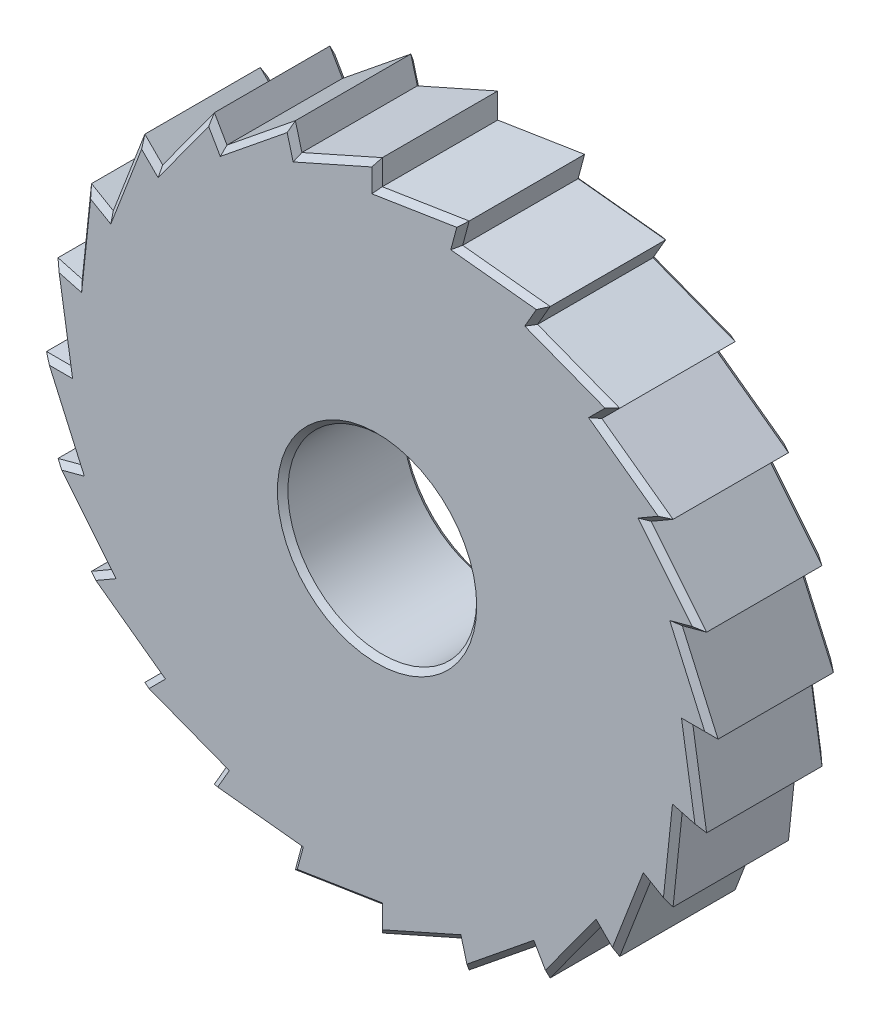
ISO-10303-21;
HEADER;
FILE_DESCRIPTION(('STEP AP214'),'2;1');
FILE_NAME('part.step','',(''),(''),'','','');
FILE_SCHEMA(('AUTOMOTIVE_DESIGN { 1 0 10303 214 1 1 1 1 }'));
ENDSEC;
DATA;
#1=APPLICATION_CONTEXT('core data for automotive mechanical design processes');
#2=APPLICATION_PROTOCOL_DEFINITION('international standard','automotive_design',2000,#1);
#3=PRODUCT_CONTEXT('',#1,'mechanical');
#4=PRODUCT('Part','Part','',(#3));
#5=PRODUCT_RELATED_PRODUCT_CATEGORY('part','',(#4));
#6=PRODUCT_DEFINITION_FORMATION('','',#4);
#7=PRODUCT_DEFINITION_CONTEXT('part definition',#1,'design');
#8=PRODUCT_DEFINITION('design','',#6,#7);
#9=PRODUCT_DEFINITION_SHAPE('','',#8);
#10=(LENGTH_UNIT() NAMED_UNIT(*) SI_UNIT(.MILLI.,.METRE.));
#11=(NAMED_UNIT(*) PLANE_ANGLE_UNIT() SI_UNIT($,.RADIAN.));
#12=(NAMED_UNIT(*) SI_UNIT($,.STERADIAN.) SOLID_ANGLE_UNIT());
#13=UNCERTAINTY_MEASURE_WITH_UNIT(LENGTH_MEASURE(1.E-05),#10,'distance_accuracy_value','');
#14=(GEOMETRIC_REPRESENTATION_CONTEXT(3) GLOBAL_UNCERTAINTY_ASSIGNED_CONTEXT((#13)) GLOBAL_UNIT_ASSIGNED_CONTEXT((#10,
#11,#12)) REPRESENTATION_CONTEXT('',''));
#15=CARTESIAN_POINT('',(0.,0.,0.));
#16=DIRECTION('',(0.,0.,1.));
#17=DIRECTION('',(1.,0.,0.));
#18=AXIS2_PLACEMENT_3D('',#15,#16,#17);
#19=CARTESIAN_POINT('',(-19.2985014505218,7.41359998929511,6.));
#20=DIRECTION('',(0.,0.,1.));
#21=DIRECTION('',(1.,0.,0.));
#22=AXIS2_PLACEMENT_3D('',#19,#20,#21);
#23=PLANE('',#22);
#24=CARTESIAN_POINT('',(0.,0.,6.));
#25=DIRECTION('',(0.,0.,1.));
#26=DIRECTION('',(1.,0.,0.));
#27=AXIS2_PLACEMENT_3D('',#24,#25,#26);
#28=CIRCLE('',#27,4.75);
#29=CARTESIAN_POINT('',(4.75,0.,6.));
#30=VERTEX_POINT('',#29);
#31=EDGE_CURVE('E11',#30,#30,#28,.F.);
#32=ORIENTED_EDGE('',*,*,#31,.T.);
#33=EDGE_LOOP('',(#32));
#34=FACE_BOUND('',#33,.T.);
#35=DIRECTION('',(-0.987727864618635,-0.156184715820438,0.));
#36=VECTOR('',#35,1.);
#37=CARTESIAN_POINT('',(0.039046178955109,14.5530680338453,6.));
#38=LINE('',#37,#36);
#39=CARTESIAN_POINT('',(3.80001424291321,15.1477720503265,6.));
#40=VERTEX_POINT('',#39);
#41=CARTESIAN_POINT('',(-0.249999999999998,14.50736253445,6.));
#42=VERTEX_POINT('',#41);
#43=EDGE_CURVE('E48',#40,#42,#38,.T.);
#44=ORIENTED_EDGE('',*,*,#43,.T.);
#45=DIRECTION('',(0.,1.,0.));
#46=VECTOR('',#45,1.);
#47=CARTESIAN_POINT('',(-0.249999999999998,16.,6.));
#48=LINE('',#47,#46);
#49=CARTESIAN_POINT('',(-0.249999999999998,15.6151402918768,6.));
#50=VERTEX_POINT('',#49);
#51=EDGE_CURVE('E40',#42,#50,#48,.T.);
#52=ORIENTED_EDGE('',*,*,#51,.T.);
#53=DIRECTION('',(-0.913648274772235,-0.406505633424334,0.));
#54=VECTOR('',#53,1.);
#55=CARTESIAN_POINT('',(-3.72889545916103,14.0672901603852,6.));
#56=LINE('',#55,#54);
#57=CARTESIAN_POINT('',(-3.99626317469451,13.9483313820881,6.));
#58=VERTEX_POINT('',#57);
#59=EDGE_CURVE('E859',#50,#58,#56,.T.);
#60=ORIENTED_EDGE('',*,*,#59,.T.);
#61=DIRECTION('',(-0.258819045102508,0.965925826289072,0.));
#62=VECTOR('',#61,1.);
#63=CARTESIAN_POINT('',(-4.38258617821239,15.3901084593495,6.));
#64=LINE('',#63,#62);
#65=CARTESIAN_POINT('',(-4.28297715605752,15.0183625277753,6.));
#66=VERTEX_POINT('',#65);
#67=EDGE_CURVE('E861',#58,#66,#64,.T.);
#68=ORIENTED_EDGE('',*,*,#67,.T.);
#69=DIRECTION('',(-0.777305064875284,-0.629123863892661,0.));
#70=VECTOR('',#69,1.);
#71=CARTESIAN_POINT('',(-7.24271903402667,12.622849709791,6.));
#72=LINE('',#71,#70);
#73=CARTESIAN_POINT('',(-7.47018761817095,12.4387444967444,6.));
#74=VERTEX_POINT('',#73);
#75=EDGE_CURVE('E863',#66,#74,#72,.T.);
#76=ORIENTED_EDGE('',*,*,#75,.T.);
#77=DIRECTION('',(-0.499999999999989,0.866025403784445,0.));
#78=VECTOR('',#77,1.);
#79=CARTESIAN_POINT('',(-8.21650635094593,13.7314064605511,6.));
#80=LINE('',#79,#78);
#81=CARTESIAN_POINT('',(-8.02407649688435,13.3981081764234,6.));
#82=VERTEX_POINT('',#81);
#83=EDGE_CURVE('E865',#74,#82,#80,.T.);
#84=ORIENTED_EDGE('',*,*,#83,.T.);
#85=DIRECTION('',(-0.587989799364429,-0.808868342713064,0.));
#86=VECTOR('',#85,1.);
#87=CARTESIAN_POINT('',(-10.2629632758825,10.3181829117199,6.));
#88=LINE('',#87,#86);
#89=CARTESIAN_POINT('',(-10.4350311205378,10.0814777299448,6.));
#90=VERTEX_POINT('',#89);
#91=EDGE_CURVE('E867',#82,#90,#88,.T.);
#92=ORIENTED_EDGE('',*,*,#91,.T.);
#93=DIRECTION('',(-0.707106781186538,0.707106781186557,0.));
#94=VECTOR('',#93,1.);
#95=CARTESIAN_POINT('',(-11.4904851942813,11.1369318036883,6.));
#96=LINE('',#95,#94);
#97=CARTESIAN_POINT('',(-11.2183482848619,10.8647948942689,6.));
#98=VERTEX_POINT('',#97);
#99=EDGE_CURVE('E869',#90,#98,#96,.T.);
#100=ORIENTED_EDGE('',*,*,#99,.T.);
#101=DIRECTION('',(-0.358604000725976,-0.93348978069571,0.));
#102=VECTOR('',#101,1.);
#103=CARTESIAN_POINT('',(-12.5838035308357,7.31034899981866,6.));
#104=LINE('',#103,#102);
#105=CARTESIAN_POINT('',(-12.6887444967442,7.03717491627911,6.));
#106=VERTEX_POINT('',#105);
#107=EDGE_CURVE('E871',#98,#106,#104,.T.);
#108=ORIENTED_EDGE('',*,*,#107,.T.);
#109=DIRECTION('',(-0.86602540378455,0.499999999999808,0.));
#110=VECTOR('',#109,1.);
#111=CARTESIAN_POINT('',(-13.9814064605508,7.78349364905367,6.));
#112=LINE('',#111,#110);
#113=CARTESIAN_POINT('',(-13.6481081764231,7.5910637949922,6.));
#114=VERTEX_POINT('',#113);
#115=EDGE_CURVE('E873',#106,#114,#112,.T.);
#116=ORIENTED_EDGE('',*,*,#115,.T.);
#117=DIRECTION('',(-0.104779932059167,-0.994495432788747,0.));
#118=VECTOR('',#117,1.);
#119=CARTESIAN_POINT('',(-14.0470783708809,3.8043268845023,6.));
#120=LINE('',#119,#118);
#121=CARTESIAN_POINT('',(-14.0777409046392,3.51330026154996,6.));
#122=VERTEX_POINT('',#121);
#123=EDGE_CURVE('E875',#114,#122,#120,.T.);
#124=ORIENTED_EDGE('',*,*,#123,.T.);
#125=DIRECTION('',(-0.965925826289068,0.258819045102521,0.));
#126=VECTOR('',#125,1.);
#127=CARTESIAN_POINT('',(-15.5195179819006,3.89962326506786,6.));
#128=LINE('',#127,#126);
#129=CARTESIAN_POINT('',(-15.1477720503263,3.80001424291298,6.));
#130=VERTEX_POINT('',#129);
#131=EDGE_CURVE('E877',#122,#130,#128,.T.);
#132=ORIENTED_EDGE('',*,*,#131,.T.);
#133=DIRECTION('',(0.156184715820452,-0.987727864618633,0.));
#134=VECTOR('',#133,1.);
#135=CARTESIAN_POINT('',(-14.5530680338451,0.039046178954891,6.));
#136=LINE('',#135,#134);
#137=CARTESIAN_POINT('',(-14.5073625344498,-0.250000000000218,6.));
#138=VERTEX_POINT('',#137);
#139=EDGE_CURVE('E879',#130,#138,#136,.T.);
#140=ORIENTED_EDGE('',*,*,#139,.T.);
#141=DIRECTION('',(-1.,0.,0.));
#142=VECTOR('',#141,1.);
#143=CARTESIAN_POINT('',(-15.9999999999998,-0.250000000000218,6.));
#144=LINE('',#143,#142);
#145=CARTESIAN_POINT('',(-15.6151402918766,-0.250000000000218,6.));
#146=VERTEX_POINT('',#145);
#147=EDGE_CURVE('E881',#138,#146,#144,.T.);
#148=ORIENTED_EDGE('',*,*,#147,.T.);
#149=DIRECTION('',(0.406505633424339,-0.913648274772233,0.));
#150=VECTOR('',#149,1.);
#151=CARTESIAN_POINT('',(-14.0672901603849,-3.72889545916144,6.));
#152=LINE('',#151,#150);
#153=CARTESIAN_POINT('',(-13.9483313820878,-3.99626317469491,6.));
#154=VERTEX_POINT('',#153);
#155=EDGE_CURVE('E883',#146,#154,#152,.T.);
#156=ORIENTED_EDGE('',*,*,#155,.T.);
#157=DIRECTION('',(-0.965925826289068,-0.258819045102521,0.));
#158=VECTOR('',#157,1.);
#159=CARTESIAN_POINT('',(-15.3901084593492,-4.38258617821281,6.));
#160=LINE('',#159,#158);
#161=CARTESIAN_POINT('',(-15.0183625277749,-4.28297715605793,6.));
#162=VERTEX_POINT('',#161);
#163=EDGE_CURVE('E885',#154,#162,#160,.T.);
#164=ORIENTED_EDGE('',*,*,#163,.T.);
#165=DIRECTION('',(0.629123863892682,-0.777305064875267,0.));
#166=VECTOR('',#165,1.);
#167=CARTESIAN_POINT('',(-12.6228497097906,-7.24271903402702,6.));
#168=LINE('',#167,#166);
#169=CARTESIAN_POINT('',(-12.438744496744,-7.4701876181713,6.));
#170=VERTEX_POINT('',#169);
#171=EDGE_CURVE('E887',#162,#170,#168,.T.);
#172=ORIENTED_EDGE('',*,*,#171,.T.);
#173=DIRECTION('',(-0.866025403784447,-0.499999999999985,0.));
#174=VECTOR('',#173,1.);
#175=CARTESIAN_POINT('',(-13.7314064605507,-8.21650635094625,6.));
#176=LINE('',#175,#174);
#177=CARTESIAN_POINT('',(-13.3981081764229,-8.02407649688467,6.));
#178=VERTEX_POINT('',#177);
#179=EDGE_CURVE('E889',#170,#178,#176,.T.);
#180=ORIENTED_EDGE('',*,*,#179,.T.);
#181=DIRECTION('',(0.808868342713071,-0.587989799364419,0.));
#182=VECTOR('',#181,1.);
#183=CARTESIAN_POINT('',(-10.3181829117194,-10.2629632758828,6.));
#184=LINE('',#183,#182);
#185=CARTESIAN_POINT('',(-10.0814777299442,-10.435031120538,6.));
#186=VERTEX_POINT('',#185);
#187=EDGE_CURVE('E891',#178,#186,#184,.T.);
#188=ORIENTED_EDGE('',*,*,#187,.T.);
#189=DIRECTION('',(-0.70710678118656,-0.707106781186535,0.));
#190=VECTOR('',#189,1.);
#191=CARTESIAN_POINT('',(-11.1369318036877,-11.4904851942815,6.));
#192=LINE('',#191,#190);
#193=CARTESIAN_POINT('',(-10.8647948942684,-11.2183482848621,6.));
#194=VERTEX_POINT('',#193);
#195=EDGE_CURVE('E893',#186,#194,#192,.T.);
#196=ORIENTED_EDGE('',*,*,#195,.T.);
#197=DIRECTION('',(0.933489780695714,-0.358604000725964,0.));
#198=VECTOR('',#197,1.);
#199=CARTESIAN_POINT('',(-7.3103489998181,-12.5838035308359,6.));
#200=LINE('',#199,#198);
#201=CARTESIAN_POINT('',(-7.03717491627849,-12.6887444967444,6.));
#202=VERTEX_POINT('',#201);
#203=EDGE_CURVE('E895',#194,#202,#200,.T.);
#204=ORIENTED_EDGE('',*,*,#203,.T.);
#205=DIRECTION('',(-0.500000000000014,-0.86602540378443,0.));
#206=VECTOR('',#205,1.);
#207=CARTESIAN_POINT('',(-7.78349364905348,-13.9814064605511,6.));
#208=LINE('',#207,#206);
#209=CARTESIAN_POINT('',(-7.59106379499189,-13.6481081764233,6.));
#210=VERTEX_POINT('',#209);
#211=EDGE_CURVE('E897',#202,#210,#208,.T.);
#212=ORIENTED_EDGE('',*,*,#211,.T.);
#213=DIRECTION('',(0.994495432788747,-0.104779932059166,0.));
#214=VECTOR('',#213,1.);
#215=CARTESIAN_POINT('',(-3.80432688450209,-14.0470783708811,6.));
#216=LINE('',#215,#214);
#217=CARTESIAN_POINT('',(-3.51330026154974,-14.0777409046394,6.));
#218=VERTEX_POINT('',#217);
#219=EDGE_CURVE('E899',#210,#218,#216,.T.);
#220=ORIENTED_EDGE('',*,*,#219,.T.);
#221=DIRECTION('',(-0.258819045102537,-0.965925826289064,0.));
#222=VECTOR('',#221,1.);
#223=CARTESIAN_POINT('',(-3.89962326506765,-15.5195179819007,6.));
#224=LINE('',#223,#222);
#225=CARTESIAN_POINT('',(-3.80001424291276,-15.1477720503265,6.));
#226=VERTEX_POINT('',#225);
#227=EDGE_CURVE('E901',#218,#226,#224,.T.);
#228=ORIENTED_EDGE('',*,*,#227,.T.);
#229=DIRECTION('',(0.987727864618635,0.156184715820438,0.));
#230=VECTOR('',#229,1.);
#231=CARTESIAN_POINT('',(-0.0390461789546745,-14.5530680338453,6.));
#232=LINE('',#231,#230);
#233=CARTESIAN_POINT('',(0.250000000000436,-14.50736253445,6.));
#234=VERTEX_POINT('',#233);
#235=EDGE_CURVE('E903',#226,#234,#232,.T.);
#236=ORIENTED_EDGE('',*,*,#235,.T.);
#237=DIRECTION('',(0.,-1.,0.));
#238=VECTOR('',#237,1.);
#239=CARTESIAN_POINT('',(0.250000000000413,-15.9999999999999,6.));
#240=LINE('',#239,#238);
#241=CARTESIAN_POINT('',(0.250000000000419,-15.6151402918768,6.));
#242=VERTEX_POINT('',#241);
#243=EDGE_CURVE('E905',#234,#242,#240,.T.);
#244=ORIENTED_EDGE('',*,*,#243,.T.);
#245=DIRECTION('',(0.913648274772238,0.406505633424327,0.));
#246=VECTOR('',#245,1.);
#247=CARTESIAN_POINT('',(3.72889545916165,-14.0672901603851,6.));
#248=LINE('',#247,#246);
#249=CARTESIAN_POINT('',(3.99626317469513,-13.948331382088,6.));
#250=VERTEX_POINT('',#249);
#251=EDGE_CURVE('E907',#242,#250,#248,.T.);
#252=ORIENTED_EDGE('',*,*,#251,.T.);
#253=DIRECTION('',(0.258819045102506,-0.965925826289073,0.));
#254=VECTOR('',#253,1.);
#255=CARTESIAN_POINT('',(4.38258617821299,-15.3901084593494,6.));
#256=LINE('',#255,#254);
#257=CARTESIAN_POINT('',(4.28297715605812,-15.0183625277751,6.));
#258=VERTEX_POINT('',#257);
#259=EDGE_CURVE('E909',#250,#258,#256,.T.);
#260=ORIENTED_EDGE('',*,*,#259,.T.);
#261=DIRECTION('',(0.777305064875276,0.629123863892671,0.));
#262=VECTOR('',#261,1.);
#263=CARTESIAN_POINT('',(7.24271903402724,-12.6228497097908,6.));
#264=LINE('',#263,#262);
#265=CARTESIAN_POINT('',(7.47018761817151,-12.4387444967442,6.));
#266=VERTEX_POINT('',#265);
#267=EDGE_CURVE('E911',#258,#266,#264,.T.);
#268=ORIENTED_EDGE('',*,*,#267,.T.);
#269=DIRECTION('',(0.499999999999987,-0.866025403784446,0.));
#270=VECTOR('',#269,1.);
#271=CARTESIAN_POINT('',(8.21650635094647,-13.7314064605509,6.));
#272=LINE('',#271,#270);
#273=CARTESIAN_POINT('',(8.02407649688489,-13.3981081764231,6.));
#274=VERTEX_POINT('',#273);
#275=EDGE_CURVE('E913',#266,#274,#272,.T.);
#276=ORIENTED_EDGE('',*,*,#275,.T.);
#277=DIRECTION('',(0.58798979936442,0.808868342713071,0.));
#278=VECTOR('',#277,1.);
#279=CARTESIAN_POINT('',(10.262963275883,-10.3181829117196,6.));
#280=LINE('',#279,#278);
#281=CARTESIAN_POINT('',(10.4350311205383,-10.0814777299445,6.));
#282=VERTEX_POINT('',#281);
#283=EDGE_CURVE('E915',#274,#282,#280,.T.);
#284=ORIENTED_EDGE('',*,*,#283,.T.);
#285=DIRECTION('',(0.707106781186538,-0.707106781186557,0.));
#286=VECTOR('',#285,1.);
#287=CARTESIAN_POINT('',(11.4904851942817,-11.1369318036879,6.));
#288=LINE('',#287,#286);
#289=CARTESIAN_POINT('',(11.2183482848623,-10.8647948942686,6.));
#290=VERTEX_POINT('',#289);
#291=EDGE_CURVE('E917',#282,#290,#288,.T.);
#292=ORIENTED_EDGE('',*,*,#291,.T.);
#293=DIRECTION('',(0.358604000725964,0.933489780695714,0.));
#294=VECTOR('',#293,1.);
#295=CARTESIAN_POINT('',(12.5838035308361,-7.31034899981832,6.));
#296=LINE('',#295,#294);
#297=CARTESIAN_POINT('',(12.6887444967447,-7.03717491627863,6.));
#298=VERTEX_POINT('',#297);
#299=EDGE_CURVE('E919',#290,#298,#296,.T.);
#300=ORIENTED_EDGE('',*,*,#299,.T.);
#301=DIRECTION('',(0.866025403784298,-0.500000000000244,0.));
#302=VECTOR('',#301,1.);
#303=CARTESIAN_POINT('',(13.9814064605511,-7.78349364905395,6.));
#304=LINE('',#303,#302);
#305=CARTESIAN_POINT('',(13.6481081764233,-7.59106379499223,6.));
#306=VERTEX_POINT('',#305);
#307=EDGE_CURVE('E921',#298,#306,#304,.T.);
#308=ORIENTED_EDGE('',*,*,#307,.T.);
#309=DIRECTION('',(0.104779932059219,0.994495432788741,0.));
#310=VECTOR('',#309,1.);
#311=CARTESIAN_POINT('',(14.0470783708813,-3.80432688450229,6.));
#312=LINE('',#311,#310);
#313=CARTESIAN_POINT('',(14.0777409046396,-3.51330026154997,6.));
#314=VERTEX_POINT('',#313);
#315=EDGE_CURVE('E923',#306,#314,#312,.T.);
#316=ORIENTED_EDGE('',*,*,#315,.T.);
#317=DIRECTION('',(0.965925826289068,-0.258819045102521,0.));
#318=VECTOR('',#317,1.);
#319=CARTESIAN_POINT('',(15.519517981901,-3.89962326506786,6.));
#320=LINE('',#319,#318);
#321=CARTESIAN_POINT('',(15.1477720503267,-3.80001424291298,6.));
#322=VERTEX_POINT('',#321);
#323=EDGE_CURVE('E925',#314,#322,#320,.T.);
#324=ORIENTED_EDGE('',*,*,#323,.T.);
#325=DIRECTION('',(-0.156184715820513,0.987727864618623,0.));
#326=VECTOR('',#325,1.);
#327=CARTESIAN_POINT('',(14.5530680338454,-0.039046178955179,6.));
#328=LINE('',#327,#326);
#329=CARTESIAN_POINT('',(14.50736253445,0.249999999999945,6.));
#330=VERTEX_POINT('',#329);
#331=EDGE_CURVE('E927',#322,#330,#328,.T.);
#332=ORIENTED_EDGE('',*,*,#331,.T.);
#333=DIRECTION('',(1.,0.,0.));
#334=VECTOR('',#333,1.);
#335=CARTESIAN_POINT('',(16.,0.24999999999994,6.));
#336=LINE('',#335,#334);
#337=CARTESIAN_POINT('',(15.6151402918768,0.249999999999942,6.));
#338=VERTEX_POINT('',#337);
#339=EDGE_CURVE('E929',#330,#338,#336,.T.);
#340=ORIENTED_EDGE('',*,*,#339,.T.);
#341=DIRECTION('',(-0.406505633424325,0.913648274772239,0.));
#342=VECTOR('',#341,1.);
#343=CARTESIAN_POINT('',(14.0672901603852,3.72889545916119,6.));
#344=LINE('',#343,#342);
#345=CARTESIAN_POINT('',(13.9483313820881,3.99626317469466,6.));
#346=VERTEX_POINT('',#345);
#347=EDGE_CURVE('E931',#338,#346,#344,.T.);
#348=ORIENTED_EDGE('',*,*,#347,.T.);
#349=DIRECTION('',(0.965925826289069,0.258819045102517,0.));
#350=VECTOR('',#349,1.);
#351=CARTESIAN_POINT('',(15.3901084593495,4.38258617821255,6.));
#352=LINE('',#351,#350);
#353=CARTESIAN_POINT('',(15.0183625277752,4.28297715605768,6.));
#354=VERTEX_POINT('',#353);
#355=EDGE_CURVE('E933',#346,#354,#352,.T.);
#356=ORIENTED_EDGE('',*,*,#355,.T.);
#357=DIRECTION('',(-0.629123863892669,0.777305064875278,0.));
#358=VECTOR('',#357,1.);
#359=CARTESIAN_POINT('',(12.6228497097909,7.2427190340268,6.));
#360=LINE('',#359,#358);
#361=CARTESIAN_POINT('',(12.4387444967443,7.47018761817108,6.));
#362=VERTEX_POINT('',#361);
#363=EDGE_CURVE('E935',#354,#362,#360,.T.);
#364=ORIENTED_EDGE('',*,*,#363,.T.);
#365=DIRECTION('',(0.866025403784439,0.499999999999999,0.));
#366=VECTOR('',#365,1.);
#367=CARTESIAN_POINT('',(13.731406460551,8.21650635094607,6.));
#368=LINE('',#367,#366);
#369=CARTESIAN_POINT('',(13.3981081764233,8.02407649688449,6.));
#370=VERTEX_POINT('',#369);
#371=EDGE_CURVE('E937',#362,#370,#368,.T.);
#372=ORIENTED_EDGE('',*,*,#371,.T.);
#373=DIRECTION('',(-0.80886834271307,0.587989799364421,0.));
#374=VECTOR('',#373,1.);
#375=CARTESIAN_POINT('',(10.3181829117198,10.2629632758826,6.));
#376=LINE('',#375,#374);
#377=CARTESIAN_POINT('',(10.0814777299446,10.4350311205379,6.));
#378=VERTEX_POINT('',#377);
#379=EDGE_CURVE('E939',#370,#378,#376,.T.);
#380=ORIENTED_EDGE('',*,*,#379,.T.);
#381=DIRECTION('',(0.707106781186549,0.707106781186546,0.));
#382=VECTOR('',#381,1.);
#383=CARTESIAN_POINT('',(11.1369318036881,11.4904851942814,6.));
#384=LINE('',#383,#382);
#385=CARTESIAN_POINT('',(10.8647948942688,11.218348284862,6.));
#386=VERTEX_POINT('',#385);
#387=EDGE_CURVE('E941',#378,#386,#384,.T.);
#388=ORIENTED_EDGE('',*,*,#387,.T.);
#389=DIRECTION('',(-0.933489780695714,0.358604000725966,0.));
#390=VECTOR('',#389,1.);
#391=CARTESIAN_POINT('',(7.31034899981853,12.5838035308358,6.));
#392=LINE('',#391,#390);
#393=CARTESIAN_POINT('',(7.03717491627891,12.6887444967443,6.));
#394=VERTEX_POINT('',#393);
#395=EDGE_CURVE('E943',#386,#394,#392,.T.);
#396=ORIENTED_EDGE('',*,*,#395,.T.);
#397=DIRECTION('',(0.500000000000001,0.866025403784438,0.));
#398=VECTOR('',#397,1.);
#399=CARTESIAN_POINT('',(7.78349364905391,13.981406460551,6.));
#400=LINE('',#399,#398);
#401=CARTESIAN_POINT('',(7.59106379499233,13.6481081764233,6.));
#402=VERTEX_POINT('',#401);
#403=EDGE_CURVE('E945',#394,#402,#400,.T.);
#404=ORIENTED_EDGE('',*,*,#403,.T.);
#405=DIRECTION('',(-0.994495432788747,0.104779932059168,0.));
#406=VECTOR('',#405,1.);
#407=CARTESIAN_POINT('',(3.80432688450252,14.047078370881,6.));
#408=LINE('',#407,#406);
#409=CARTESIAN_POINT('',(3.51330026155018,14.0777409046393,6.));
#410=VERTEX_POINT('',#409);
#411=EDGE_CURVE('E947',#402,#410,#408,.T.);
#412=ORIENTED_EDGE('',*,*,#411,.T.);
#413=DIRECTION('',(0.258819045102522,0.965925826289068,0.));
#414=VECTOR('',#413,1.);
#415=CARTESIAN_POINT('',(3.89962326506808,15.5195179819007,6.));
#416=LINE('',#415,#414);
#417=EDGE_CURVE('E53',#410,#40,#416,.T.);
#418=ORIENTED_EDGE('',*,*,#417,.T.);
#419=EDGE_LOOP('',(#44,#52,#60,#68,#76,#84,#92,#100,#108,#116,#124,#132,#140,#148,#156,#164,
#172,#180,#188,#196,#204,#212,#220,#228,#236,#244,#252,#260,#268,#276,#284,#292,#300,#308,#316,
#324,#332,#340,#348,#356,#364,#372,#380,#388,#396,#404,#412,#418));
#420=FACE_BOUND('',#419,.T.);
#421=ADVANCED_FACE('F31',(#34,#420),#23,.T.);
#422=CARTESIAN_POINT('',(-19.2985014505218,7.41359998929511,0.));
#423=DIRECTION('',(0.,0.,1.));
#424=DIRECTION('',(1.,0.,0.));
#425=AXIS2_PLACEMENT_3D('',#422,#423,#424);
#426=PLANE('',#425);
#427=CARTESIAN_POINT('',(0.,0.,0.));
#428=DIRECTION('',(0.,0.,1.));
#429=DIRECTION('',(1.,0.,0.));
#430=AXIS2_PLACEMENT_3D('',#427,#428,#429);
#431=CIRCLE('',#430,4.75);
#432=CARTESIAN_POINT('',(4.75,0.,0.));
#433=VERTEX_POINT('',#432);
#434=EDGE_CURVE('E653',#433,#433,#431,.T.);
#435=ORIENTED_EDGE('',*,*,#434,.T.);
#436=EDGE_LOOP('',(#435));
#437=FACE_BOUND('',#436,.T.);
#438=DIRECTION('',(0.777305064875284,0.629123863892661,0.));
#439=VECTOR('',#438,1.);
#440=CARTESIAN_POINT('',(-17.0742942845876,4.66551237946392,0.));
#441=LINE('',#440,#439);
#442=CARTESIAN_POINT('',(-7.47018761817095,12.4387444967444,0.));
#443=VERTEX_POINT('',#442);
#444=CARTESIAN_POINT('',(-4.28297715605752,15.0183625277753,0.));
#445=VERTEX_POINT('',#444);
#446=EDGE_CURVE('E652',#443,#445,#441,.T.);
#447=ORIENTED_EDGE('',*,*,#446,.T.);
#448=DIRECTION('',(0.258819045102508,-0.965925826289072,0.));
#449=VECTOR('',#448,1.);
#450=CARTESIAN_POINT('',(-3.38763592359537,11.676903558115,0.));
#451=LINE('',#450,#449);
#452=CARTESIAN_POINT('',(-3.99626317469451,13.9483313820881,0.));
#453=VERTEX_POINT('',#452);
#454=EDGE_CURVE('E631',#445,#453,#451,.T.);
#455=ORIENTED_EDGE('',*,*,#454,.T.);
#456=DIRECTION('',(0.913648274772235,0.406505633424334,0.));
#457=VECTOR('',#456,1.);
#458=CARTESIAN_POINT('',(-19.1968750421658,7.18518792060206,0.));
#459=LINE('',#458,#457);
#460=CARTESIAN_POINT('',(-0.250000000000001,15.6151402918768,0.));
#461=VERTEX_POINT('',#460);
#462=EDGE_CURVE('E641',#453,#461,#459,.T.);
#463=ORIENTED_EDGE('',*,*,#462,.T.);
#464=DIRECTION('',(0.,-1.,0.));
#465=VECTOR('',#464,1.);
#466=CARTESIAN_POINT('',(-0.25,7.41359998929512,0.));
#467=LINE('',#466,#465);
#468=CARTESIAN_POINT('',(-0.250000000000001,14.50736253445,0.));
#469=VERTEX_POINT('',#468);
#470=EDGE_CURVE('E647',#461,#469,#467,.T.);
#471=ORIENTED_EDGE('',*,*,#470,.T.);
#472=DIRECTION('',(0.987727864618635,0.156184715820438,0.));
#473=VECTOR('',#472,1.);
#474=CARTESIAN_POINT('',(-19.9281792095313,11.3957455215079,0.));
#475=LINE('',#474,#473);
#476=CARTESIAN_POINT('',(3.8000142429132,15.1477720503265,0.));
#477=VERTEX_POINT('',#476);
#478=EDGE_CURVE('E1324',#469,#477,#475,.T.);
#479=ORIENTED_EDGE('',*,*,#478,.T.);
#480=DIRECTION('',(-0.258819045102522,-0.965925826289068,0.));
#481=VECTOR('',#480,1.);
#482=CARTESIAN_POINT('',(0.319164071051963,2.15706235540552,0.));
#483=LINE('',#482,#481);
#484=CARTESIAN_POINT('',(3.51330026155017,14.0777409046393,0.));
#485=VERTEX_POINT('',#484);
#486=EDGE_CURVE('E1326',#477,#485,#483,.T.);
#487=ORIENTED_EDGE('',*,*,#486,.T.);
#488=DIRECTION('',(0.994495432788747,-0.104779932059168,0.));
#489=VECTOR('',#488,1.);
#490=CARTESIAN_POINT('',(-18.3536298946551,16.3816383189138,0.));
#491=LINE('',#490,#489);
#492=CARTESIAN_POINT('',(7.59106379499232,13.6481081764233,0.));
#493=VERTEX_POINT('',#492);
#494=EDGE_CURVE('E1328',#485,#493,#491,.T.);
#495=ORIENTED_EDGE('',*,*,#494,.T.);
#496=DIRECTION('',(-0.500000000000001,-0.866025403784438,0.));
#497=VECTOR('',#496,1.);
#498=CARTESIAN_POINT('',(-1.83094875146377,-2.67129626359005,0.));
#499=LINE('',#498,#497);
#500=CARTESIAN_POINT('',(7.0371749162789,12.6887444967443,0.));
#501=VERTEX_POINT('',#500);
#502=EDGE_CURVE('E1330',#493,#501,#499,.T.);
#503=ORIENTED_EDGE('',*,*,#502,.T.);
#504=DIRECTION('',(0.933489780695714,-0.358604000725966,0.));
#505=VECTOR('',#504,1.);
#506=CARTESIAN_POINT('',(-14.1459456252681,20.8263287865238,0.));
#507=LINE('',#506,#505);
#508=CARTESIAN_POINT('',(10.8647948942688,11.218348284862,0.));
#509=VERTEX_POINT('',#508);
#510=EDGE_CURVE('E1332',#501,#509,#507,.T.);
#511=ORIENTED_EDGE('',*,*,#510,.T.);
#512=DIRECTION('',(-0.707106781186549,-0.707106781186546,0.));
#513=VECTOR('',#512,1.);
#514=CARTESIAN_POINT('',(-6.11922742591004,-5.76567403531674,0.));
#515=LINE('',#514,#513);
#516=CARTESIAN_POINT('',(10.0814777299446,10.4350311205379,0.));
#517=VERTEX_POINT('',#516);
#518=EDGE_CURVE('E1334',#509,#517,#515,.T.);
#519=ORIENTED_EDGE('',*,*,#518,.T.);
#520=DIRECTION('',(0.80886834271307,-0.587989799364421,0.));
#521=VECTOR('',#520,1.);
#522=CARTESIAN_POINT('',(-7.70389058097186,23.3637298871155,0.));
#523=LINE('',#522,#521);
#524=CARTESIAN_POINT('',(13.3981081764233,8.0240764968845,0.));
#525=VERTEX_POINT('',#524);
#526=EDGE_CURVE('E1336',#517,#525,#523,.T.);
#527=ORIENTED_EDGE('',*,*,#526,.T.);
#528=DIRECTION('',(-0.866025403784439,-0.499999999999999,0.));
#529=VECTOR('',#528,1.);
#530=CARTESIAN_POINT('',(-11.3886931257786,-6.28658990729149,0.));
#531=LINE('',#530,#529);
#532=CARTESIAN_POINT('',(12.4387444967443,7.47018761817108,0.));
#533=VERTEX_POINT('',#532);
#534=EDGE_CURVE('E1338',#525,#533,#531,.T.);
#535=ORIENTED_EDGE('',*,*,#534,.T.);
#536=DIRECTION('',(0.629123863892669,-0.777305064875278,0.));
#537=VECTOR('',#536,1.);
#538=CARTESIAN_POINT('',(-0.0950844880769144,22.9561822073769,0.));
#539=LINE('',#538,#537);
#540=CARTESIAN_POINT('',(15.0183625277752,4.28297715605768,0.));
#541=VERTEX_POINT('',#540);
#542=EDGE_CURVE('E1340',#533,#541,#539,.T.);
#543=ORIENTED_EDGE('',*,*,#542,.T.);
#544=DIRECTION('',(-0.965925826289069,-0.258819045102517,0.));
#545=VECTOR('',#544,1.);
#546=CARTESIAN_POINT('',(-16.2170517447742,-4.08652687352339,0.));
#547=LINE('',#546,#545);
#548=CARTESIAN_POINT('',(13.9483313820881,3.99626317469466,0.));
#549=VERTEX_POINT('',#548);
#550=EDGE_CURVE('E1342',#541,#549,#547,.T.);
#551=ORIENTED_EDGE('',*,*,#550,.T.);
#552=DIRECTION('',(0.406505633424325,-0.913648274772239,0.));
#553=VECTOR('',#552,1.);
#554=CARTESIAN_POINT('',(7.18518792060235,19.1968750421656,0.));
#555=LINE('',#554,#553);
#556=CARTESIAN_POINT('',(15.6151402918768,0.249999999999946,0.));
#557=VERTEX_POINT('',#556);
#558=EDGE_CURVE('E1344',#549,#557,#555,.T.);
#559=ORIENTED_EDGE('',*,*,#558,.T.);
#560=DIRECTION('',(-1.,0.,0.));
#561=VECTOR('',#560,1.);
#562=CARTESIAN_POINT('',(-19.2985014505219,0.250000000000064,0.));
#563=LINE('',#562,#561);
#564=CARTESIAN_POINT('',(14.50736253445,0.24999999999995,0.));
#565=VERTEX_POINT('',#564);
#566=EDGE_CURVE('E1346',#557,#565,#563,.T.);
#567=ORIENTED_EDGE('',*,*,#566,.T.);
#568=DIRECTION('',(0.156184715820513,-0.987727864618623,0.));
#569=VECTOR('',#568,1.);
#570=CARTESIAN_POINT('',(12.577599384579,12.4540164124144,0.));
#571=LINE('',#570,#569);
#572=CARTESIAN_POINT('',(15.1477720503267,-3.80001424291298,0.));
#573=VERTEX_POINT('',#572);
#574=EDGE_CURVE('E1348',#565,#573,#571,.T.);
#575=ORIENTED_EDGE('',*,*,#574,.T.);
#576=DIRECTION('',(-0.965925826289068,0.258819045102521,0.));
#577=VECTOR('',#576,1.);
#578=CARTESIAN_POINT('',(-19.7944422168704,5.56272385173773,0.));
#579=LINE('',#578,#577);
#580=CARTESIAN_POINT('',(14.0777409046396,-3.51330026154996,0.));
#581=VERTEX_POINT('',#580);
#582=EDGE_CURVE('E1350',#573,#581,#579,.T.);
#583=ORIENTED_EDGE('',*,*,#582,.T.);
#584=DIRECTION('',(-0.104779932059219,-0.994495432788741,0.));
#585=VECTOR('',#584,1.);
#586=CARTESIAN_POINT('',(14.8499262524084,3.81572531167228,0.));
#587=LINE('',#586,#585);
#588=CARTESIAN_POINT('',(13.6481081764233,-7.59106379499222,0.));
#589=VERTEX_POINT('',#588);
#590=EDGE_CURVE('E1352',#581,#589,#587,.T.);
#591=ORIENTED_EDGE('',*,*,#590,.T.);
#592=DIRECTION('',(-0.866025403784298,0.500000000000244,0.));
#593=VECTOR('',#592,1.);
#594=CARTESIAN_POINT('',(-17.5590590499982,10.4264026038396,0.));
#595=LINE('',#594,#593);
#596=CARTESIAN_POINT('',(12.6887444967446,-7.03717491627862,0.));
#597=VERTEX_POINT('',#596);
#598=EDGE_CURVE('E1354',#589,#597,#595,.T.);
#599=ORIENTED_EDGE('',*,*,#598,.T.);
#600=DIRECTION('',(-0.358604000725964,-0.933489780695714,0.));
#601=VECTOR('',#600,1.);
#602=CARTESIAN_POINT('',(13.4127287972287,-5.15255582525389,0.));
#603=LINE('',#602,#601);
#604=CARTESIAN_POINT('',(11.2183482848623,-10.8647948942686,0.));
#605=VERTEX_POINT('',#604);
#606=EDGE_CURVE('E1356',#597,#605,#603,.T.);
#607=ORIENTED_EDGE('',*,*,#606,.T.);
#608=DIRECTION('',(-0.707106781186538,0.707106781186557,0.));
#609=VECTOR('',#608,1.);
#610=CARTESIAN_POINT('',(-13.1792740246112,13.5328274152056,0.));
#611=LINE('',#610,#609);
#612=CARTESIAN_POINT('',(10.4350311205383,-10.0814777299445,0.));
#613=VERTEX_POINT('',#612);
#614=EDGE_CURVE('E1358',#605,#613,#611,.T.);
#615=ORIENTED_EDGE('',*,*,#614,.T.);
#616=DIRECTION('',(-0.58798979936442,-0.808868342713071,0.));
#617=VECTOR('',#616,1.);
#618=CARTESIAN_POINT('',(8.47596710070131,-12.7764647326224,0.));
#619=LINE('',#618,#617);
#620=CARTESIAN_POINT('',(8.02407649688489,-13.3981081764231,0.));
#621=VERTEX_POINT('',#620);
#622=EDGE_CURVE('E1360',#613,#621,#619,.T.);
#623=ORIENTED_EDGE('',*,*,#622,.T.);
#624=DIRECTION('',(-0.499999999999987,0.866025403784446,0.));
#625=VECTOR('',#624,1.);
#626=CARTESIAN_POINT('',(-7.81830197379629,14.041696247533,0.));
#627=LINE('',#626,#625);
#628=CARTESIAN_POINT('',(7.47018761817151,-12.4387444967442,0.));
#629=VERTEX_POINT('',#628);
#630=EDGE_CURVE('E1362',#621,#629,#627,.T.);
#631=ORIENTED_EDGE('',*,*,#630,.T.);
#632=DIRECTION('',(-0.777305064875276,-0.629123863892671,0.));
#633=VECTOR('',#632,1.);
#634=CARTESIAN_POINT('',(1.00467763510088,-17.6717048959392,0.));
#635=LINE('',#634,#633);
#636=CARTESIAN_POINT('',(4.28297715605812,-15.0183625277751,0.));
#637=VERTEX_POINT('',#636);
#638=EDGE_CURVE('E1364',#629,#637,#635,.T.);
#639=ORIENTED_EDGE('',*,*,#638,.T.);
#640=DIRECTION('',(-0.258819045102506,0.965925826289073,0.));
#641=VECTOR('',#640,1.);
#642=CARTESIAN_POINT('',(-2.90467301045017,11.8063130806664,0.));
#643=LINE('',#642,#641);
#644=CARTESIAN_POINT('',(3.99626317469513,-13.948331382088,0.));
#645=VERTEX_POINT('',#644);
#646=EDGE_CURVE('E1366',#637,#645,#643,.T.);
#647=ORIENTED_EDGE('',*,*,#646,.T.);
#648=DIRECTION('',(-0.913648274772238,-0.406505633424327,0.));
#649=VECTOR('',#648,1.);
#650=CARTESIAN_POINT('',(-7.5152263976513,-19.070089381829,0.));
#651=LINE('',#650,#649);
#652=CARTESIAN_POINT('',(0.250000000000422,-15.6151402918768,0.));
#653=VERTEX_POINT('',#652);
#654=EDGE_CURVE('E1368',#645,#653,#651,.T.);
#655=ORIENTED_EDGE('',*,*,#654,.T.);
#656=DIRECTION('',(0.,1.,0.));
#657=VECTOR('',#656,1.);
#658=CARTESIAN_POINT('',(0.250000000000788,7.4135999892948,0.));
#659=LINE('',#658,#657);
#660=CARTESIAN_POINT('',(0.25000000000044,-14.50736253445,0.));
#661=VERTEX_POINT('',#660);
#662=EDGE_CURVE('E1370',#653,#661,#659,.T.);
#663=ORIENTED_EDGE('',*,*,#662,.T.);
#664=DIRECTION('',(-0.987727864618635,-0.156184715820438,0.));
#665=VECTOR('',#664,1.);
#666=CARTESIAN_POINT('',(-15.4399388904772,-16.9883380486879,0.));
#667=LINE('',#666,#665);
#668=CARTESIAN_POINT('',(-3.80001424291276,-15.1477720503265,0.));
#669=VERTEX_POINT('',#668);
#670=EDGE_CURVE('E1372',#661,#669,#667,.T.);
#671=ORIENTED_EDGE('',*,*,#670,.T.);
#672=DIRECTION('',(0.258819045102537,0.965925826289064,0.));
#673=VECTOR('',#672,1.);
#674=CARTESIAN_POINT('',(0.802126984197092,2.02765283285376,0.));
#675=LINE('',#674,#673);
#676=CARTESIAN_POINT('',(-3.51330026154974,-14.0777409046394,0.));
#677=VERTEX_POINT('',#676);
#678=EDGE_CURVE('E1374',#669,#677,#675,.T.);
#679=ORIENTED_EDGE('',*,*,#678,.T.);
#680=DIRECTION('',(-0.994495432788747,0.104779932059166,0.));
#681=VECTOR('',#680,1.);
#682=CARTESIAN_POINT('',(-21.364664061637,-12.1969231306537,0.));
#683=LINE('',#682,#681);
#684=CARTESIAN_POINT('',(-7.59106379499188,-13.6481081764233,0.));
#685=VERTEX_POINT('',#684);
#686=EDGE_CURVE('E1376',#677,#685,#683,.T.);
#687=ORIENTED_EDGE('',*,*,#686,.T.);
#688=DIRECTION('',(0.500000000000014,0.86602540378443,0.));
#689=VECTOR('',#688,1.);
#690=CARTESIAN_POINT('',(-1.3979360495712,-2.92129626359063,0.));
#691=LINE('',#690,#689);
#692=CARTESIAN_POINT('',(-7.03717491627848,-12.6887444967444,0.));
#693=VERTEX_POINT('',#692);
#694=EDGE_CURVE('E1378',#685,#693,#691,.T.);
#695=ORIENTED_EDGE('',*,*,#694,.T.);
#696=DIRECTION('',(-0.933489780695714,0.358604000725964,0.));
#697=VECTOR('',#696,1.);
#698=CARTESIAN_POINT('',(-24.4510572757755,-5.99912880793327,0.));
#699=LINE('',#698,#697);
#700=CARTESIAN_POINT('',(-10.8647948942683,-11.2183482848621,0.));
#701=VERTEX_POINT('',#700);
#702=EDGE_CURVE('E1380',#693,#701,#699,.T.);
#703=ORIENTED_EDGE('',*,*,#702,.T.);
#704=DIRECTION('',(0.70710678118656,0.707106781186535,0.));
#705=VECTOR('',#704,1.);
#706=CARTESIAN_POINT('',(-5.76567403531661,-6.11922742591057,0.));
#707=LINE('',#706,#705);
#708=CARTESIAN_POINT('',(-10.0814777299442,-10.4350311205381,0.));
#709=VERTEX_POINT('',#708);
#710=EDGE_CURVE('E1382',#701,#709,#707,.T.);
#711=ORIENTED_EDGE('',*,*,#710,.T.);
#712=DIRECTION('',(-0.808868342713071,0.587989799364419,0.));
#713=VECTOR('',#712,1.);
#714=CARTESIAN_POINT('',(-24.6008033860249,0.119486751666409,0.));
#715=LINE('',#714,#713);
#716=CARTESIAN_POINT('',(-13.3981081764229,-8.02407649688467,0.));
#717=VERTEX_POINT('',#716);
#718=EDGE_CURVE('E1384',#709,#717,#715,.T.);
#719=ORIENTED_EDGE('',*,*,#718,.T.);
#720=DIRECTION('',(0.866025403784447,0.499999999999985,0.));
#721=VECTOR('',#720,1.);
#722=CARTESIAN_POINT('',(-11.1386931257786,-6.71960260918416,0.));
#723=LINE('',#722,#721);
#724=CARTESIAN_POINT('',(-12.438744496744,-7.4701876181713,0.));
#725=VERTEX_POINT('',#724);
#726=EDGE_CURVE('E1386',#717,#725,#723,.T.);
#727=ORIENTED_EDGE('',*,*,#726,.T.);
#728=DIRECTION('',(-0.629123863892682,0.777305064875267,0.));
#729=VECTOR('',#728,1.);
#730=CARTESIAN_POINT('',(-22.43230176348,4.87721028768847,0.));
#731=LINE('',#730,#729);
#732=CARTESIAN_POINT('',(-15.0183625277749,-4.28297715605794,0.));
#733=VERTEX_POINT('',#732);
#734=EDGE_CURVE('E1388',#725,#733,#731,.T.);
#735=ORIENTED_EDGE('',*,*,#734,.T.);
#736=DIRECTION('',(0.965925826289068,0.258819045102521,0.));
#737=VECTOR('',#736,1.);
#738=CARTESIAN_POINT('',(-16.0876422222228,-4.56948978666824,0.));
#739=LINE('',#738,#737);
#740=CARTESIAN_POINT('',(-13.9483313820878,-3.99626317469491,0.));
#741=VERTEX_POINT('',#740);
#742=EDGE_CURVE('E1390',#733,#741,#739,.T.);
#743=ORIENTED_EDGE('',*,*,#742,.T.);
#744=DIRECTION('',(-0.406505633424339,0.913648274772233,0.));
#745=VECTOR('',#744,1.);
#746=CARTESIAN_POINT('',(-19.0700893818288,7.5152263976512,0.));
#747=LINE('',#746,#745);
#748=CARTESIAN_POINT('',(-15.6151402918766,-0.250000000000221,0.));
#749=VERTEX_POINT('',#748);
#750=EDGE_CURVE('E1392',#741,#749,#747,.T.);
#751=ORIENTED_EDGE('',*,*,#750,.T.);
#752=DIRECTION('',(1.,0.,0.));
#753=VECTOR('',#752,1.);
#754=CARTESIAN_POINT('',(-19.2985014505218,-0.250000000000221,0.));
#755=LINE('',#754,#753);
#756=CARTESIAN_POINT('',(-14.5073625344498,-0.250000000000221,0.));
#757=VERTEX_POINT('',#756);
#758=EDGE_CURVE('E1394',#749,#757,#755,.T.);
#759=ORIENTED_EDGE('',*,*,#758,.T.);
#760=DIRECTION('',(-0.156184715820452,0.987727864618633,0.));
#761=VECTOR('',#760,1.);
#762=CARTESIAN_POINT('',(-15.8064841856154,7.96577609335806,0.));
#763=LINE('',#762,#761);
#764=CARTESIAN_POINT('',(-15.1477720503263,3.80001424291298,0.));
#765=VERTEX_POINT('',#764);
#766=EDGE_CURVE('E1396',#757,#765,#763,.T.);
#767=ORIENTED_EDGE('',*,*,#766,.T.);
#768=DIRECTION('',(0.965925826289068,-0.258819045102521,0.));
#769=VECTOR('',#768,1.);
#770=CARTESIAN_POINT('',(-19.9238517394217,5.07976093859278,0.));
#771=LINE('',#770,#769);
#772=CARTESIAN_POINT('',(-14.0777409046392,3.51330026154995,0.));
#773=VERTEX_POINT('',#772);
#774=EDGE_CURVE('E1398',#765,#773,#771,.T.);
#775=ORIENTED_EDGE('',*,*,#774,.T.);
#776=DIRECTION('',(0.104779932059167,0.994495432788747,0.));
#777=VECTOR('',#776,1.);
#778=CARTESIAN_POINT('',(-13.7286351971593,6.82675947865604,0.));
#779=LINE('',#778,#777);
#780=CARTESIAN_POINT('',(-13.6481081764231,7.5910637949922,0.));
#781=VERTEX_POINT('',#780);
#782=EDGE_CURVE('E1400',#773,#781,#779,.T.);
#783=ORIENTED_EDGE('',*,*,#782,.T.);
#784=DIRECTION('',(0.86602540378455,-0.499999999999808,0.));
#785=VECTOR('',#784,1.);
#786=CARTESIAN_POINT('',(-17.8090590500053,9.99338990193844,0.));
#787=LINE('',#786,#785);
#788=CARTESIAN_POINT('',(-12.6887444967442,7.0371749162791,0.));
#789=VERTEX_POINT('',#788);
#790=EDGE_CURVE('E1402',#781,#789,#787,.T.);
#791=ORIENTED_EDGE('',*,*,#790,.T.);
#792=DIRECTION('',(0.358604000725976,0.93348978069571,0.));
#793=VECTOR('',#792,1.);
#794=CARTESIAN_POINT('',(-13.4127287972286,5.15255582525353,0.));
#795=LINE('',#794,#793);
#796=CARTESIAN_POINT('',(-11.2183482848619,10.8647948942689,0.));
#797=VERTEX_POINT('',#796);
#798=EDGE_CURVE('E1404',#789,#797,#795,.T.);
#799=ORIENTED_EDGE('',*,*,#798,.T.);
#800=DIRECTION('',(0.707106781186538,-0.707106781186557,0.));
#801=VECTOR('',#800,1.);
#802=CARTESIAN_POINT('',(-13.5328274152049,13.1792740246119,0.));
#803=LINE('',#802,#801);
#804=CARTESIAN_POINT('',(-10.4350311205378,10.0814777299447,0.));
#805=VERTEX_POINT('',#804);
#806=EDGE_CURVE('E1406',#797,#805,#803,.T.);
#807=ORIENTED_EDGE('',*,*,#806,.T.);
#808=DIRECTION('',(0.587989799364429,0.808868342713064,0.));
#809=VECTOR('',#808,1.);
#810=CARTESIAN_POINT('',(-14.7682760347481,4.12044807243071,0.));
#811=LINE('',#810,#809);
#812=CARTESIAN_POINT('',(-8.02407649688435,13.3981081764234,0.));
#813=VERTEX_POINT('',#812);
#814=EDGE_CURVE('E1408',#805,#813,#811,.T.);
#815=ORIENTED_EDGE('',*,*,#814,.T.);
#816=DIRECTION('',(0.499999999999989,-0.866025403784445,0.));
#817=VECTOR('',#816,1.);
#818=CARTESIAN_POINT('',(-8.25131467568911,13.7916962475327,0.));
#819=LINE('',#818,#817);
#820=EDGE_CURVE('E658',#813,#443,#819,.T.);
#821=ORIENTED_EDGE('',*,*,#820,.T.);
#822=EDGE_LOOP('',(#447,#455,#463,#471,#479,#487,#495,#503,#511,#519,#527,#535,#543,#551,#559,
#567,#575,#583,#591,#599,#607,#615,#623,#631,#639,#647,#655,#663,#671,#679,#687,#695,#703,#711,
#719,#727,#735,#743,#751,#759,#767,#775,#783,#791,#799,#807,#815,#821));
#823=FACE_BOUND('',#822,.T.);
#824=ADVANCED_FACE('F650',(#437,#823),#426,.F.);
#825=CARTESIAN_POINT('',(0.,16.,6.));
#826=DIRECTION('',(0.406505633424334,-0.913648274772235,0.));
#827=DIRECTION('',(0.913648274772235,0.406505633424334,0.));
#828=AXIS2_PLACEMENT_3D('',#825,#826,#827);
#829=PLANE('',#828);
#830=DIRECTION('',(0.,0.,-1.));
#831=VECTOR('',#830,1.);
#832=CARTESIAN_POINT('',(0.,16.,6.));
#833=LINE('',#832,#831);
#834=CARTESIAN_POINT('',(0.,16.,5.75000000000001));
#835=VERTEX_POINT('',#834);
#836=CARTESIAN_POINT('',(0.,16.,0.249999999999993));
#837=VERTEX_POINT('',#836);
#838=EDGE_CURVE('E1088',#835,#837,#833,.T.);
#839=ORIENTED_EDGE('',*,*,#838,.T.);
#840=DIRECTION('',(-0.913648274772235,-0.406505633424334,0.));
#841=VECTOR('',#840,1.);
#842=CARTESIAN_POINT('',(0.,16.,0.249999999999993));
#843=LINE('',#842,#841);
#844=CARTESIAN_POINT('',(-3.83052186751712,14.2957022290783,0.249999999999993));
#845=VERTEX_POINT('',#844);
#846=EDGE_CURVE('E857',#837,#845,#843,.T.);
#847=ORIENTED_EDGE('',*,*,#846,.T.);
#848=DIRECTION('',(0.,0.,-1.));
#849=VECTOR('',#848,1.);
#850=CARTESIAN_POINT('',(-3.83052186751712,14.2957022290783,6.));
#851=LINE('',#850,#849);
#852=CARTESIAN_POINT('',(-3.83052186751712,14.2957022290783,5.75000000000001));
#853=VERTEX_POINT('',#852);
#854=EDGE_CURVE('E648',#853,#845,#851,.T.);
#855=ORIENTED_EDGE('',*,*,#854,.F.);
#856=DIRECTION('',(0.913648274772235,0.406505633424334,0.));
#857=VECTOR('',#856,1.);
#858=CARTESIAN_POINT('',(0.,16.,5.75000000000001));
#859=LINE('',#858,#857);
#860=EDGE_CURVE('E855',#853,#835,#859,.T.);
#861=ORIENTED_EDGE('',*,*,#860,.T.);
#862=EDGE_LOOP('',(#839,#847,#855,#861));
#863=FACE_BOUND('',#862,.T.);
#864=ADVANCED_FACE('F1440',(#863),#829,.F.);
#865=CARTESIAN_POINT('',(-4.14110472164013,15.4548132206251,6.));
#866=DIRECTION('',(-0.965925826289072,-0.258819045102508,0.));
#867=DIRECTION('',(0.258819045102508,-0.965925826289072,0.));
#868=AXIS2_PLACEMENT_3D('',#865,#866,#867);
#869=PLANE('',#868);
#870=ORIENTED_EDGE('',*,*,#854,.T.);
#871=DIRECTION('',(-0.258819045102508,0.965925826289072,0.));
#872=VECTOR('',#871,1.);
#873=CARTESIAN_POINT('',(-4.14110472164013,15.4548132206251,0.249999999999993));
#874=LINE('',#873,#872);
#875=CARTESIAN_POINT('',(-4.14110472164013,15.4548132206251,0.249999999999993));
#876=VERTEX_POINT('',#875);
#877=EDGE_CURVE('E634',#845,#876,#874,.T.);
#878=ORIENTED_EDGE('',*,*,#877,.T.);
#879=DIRECTION('',(0.,0.,-1.));
#880=VECTOR('',#879,1.);
#881=CARTESIAN_POINT('',(-4.14110472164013,15.4548132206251,6.));
#882=LINE('',#881,#880);
#883=CARTESIAN_POINT('',(-4.14110472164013,15.4548132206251,5.75000000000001));
#884=VERTEX_POINT('',#883);
#885=EDGE_CURVE('E1318',#884,#876,#882,.T.);
#886=ORIENTED_EDGE('',*,*,#885,.F.);
#887=DIRECTION('',(0.258819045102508,-0.965925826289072,0.));
#888=VECTOR('',#887,1.);
#889=CARTESIAN_POINT('',(-3.83052186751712,14.2957022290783,5.75000000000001));
#890=LINE('',#889,#888);
#891=EDGE_CURVE('E667',#884,#853,#890,.T.);
#892=ORIENTED_EDGE('',*,*,#891,.T.);
#893=EDGE_LOOP('',(#870,#878,#886,#892));
#894=FACE_BOUND('',#893,.T.);
#895=ADVANCED_FACE('F1423',(#894),#869,.F.);
#896=CARTESIAN_POINT('',(-4.14110472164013,15.4548132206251,6.));
#897=DIRECTION('',(0.629123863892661,-0.777305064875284,0.));
#898=DIRECTION('',(0.777305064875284,0.629123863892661,0.));
#899=AXIS2_PLACEMENT_3D('',#896,#897,#898);
#900=PLANE('',#899);
#901=ORIENTED_EDGE('',*,*,#885,.T.);
#902=DIRECTION('',(-0.777305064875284,-0.629123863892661,0.));
#903=VECTOR('',#902,1.);
#904=CARTESIAN_POINT('',(-4.14110472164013,15.4548132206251,0.249999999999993));
#905=LINE('',#904,#903);
#906=CARTESIAN_POINT('',(-7.39999999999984,12.8171759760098,0.249999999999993));
#907=VERTEX_POINT('',#906);
#908=EDGE_CURVE('E672',#876,#907,#905,.T.);
#909=ORIENTED_EDGE('',*,*,#908,.T.);
#910=DIRECTION('',(0.,0.,-1.));
#911=VECTOR('',#910,1.);
#912=CARTESIAN_POINT('',(-7.39999999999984,12.8171759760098,6.));
#913=LINE('',#912,#911);
#914=CARTESIAN_POINT('',(-7.39999999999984,12.8171759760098,5.75000000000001));
#915=VERTEX_POINT('',#914);
#916=EDGE_CURVE('E1315',#915,#907,#913,.T.);
#917=ORIENTED_EDGE('',*,*,#916,.F.);
#918=DIRECTION('',(0.777305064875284,0.629123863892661,0.));
#919=VECTOR('',#918,1.);
#920=CARTESIAN_POINT('',(-4.14110472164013,15.4548132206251,5.75000000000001));
#921=LINE('',#920,#919);
#922=EDGE_CURVE('E670',#915,#884,#921,.T.);
#923=ORIENTED_EDGE('',*,*,#922,.T.);
#924=EDGE_LOOP('',(#901,#909,#917,#923));
#925=FACE_BOUND('',#924,.T.);
#926=ADVANCED_FACE('F1426',(#925),#900,.F.);
#927=CARTESIAN_POINT('',(-7.99999999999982,13.8564064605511,6.));
#928=DIRECTION('',(-0.866025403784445,-0.499999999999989,0.));
#929=DIRECTION('',(0.499999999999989,-0.866025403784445,0.));
#930=AXIS2_PLACEMENT_3D('',#927,#928,#929);
#931=PLANE('',#930);
#932=ORIENTED_EDGE('',*,*,#916,.T.);
#933=DIRECTION('',(-0.499999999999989,0.866025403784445,0.));
#934=VECTOR('',#933,1.);
#935=CARTESIAN_POINT('',(-7.99999999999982,13.8564064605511,0.249999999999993));
#936=LINE('',#935,#934);
#937=CARTESIAN_POINT('',(-7.99999999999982,13.8564064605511,0.249999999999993));
#938=VERTEX_POINT('',#937);
#939=EDGE_CURVE('E676',#907,#938,#936,.T.);
#940=ORIENTED_EDGE('',*,*,#939,.T.);
#941=DIRECTION('',(0.,0.,-1.));
#942=VECTOR('',#941,1.);
#943=CARTESIAN_POINT('',(-7.99999999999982,13.8564064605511,6.));
#944=LINE('',#943,#942);
#945=CARTESIAN_POINT('',(-7.99999999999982,13.8564064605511,5.75000000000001));
#946=VERTEX_POINT('',#945);
#947=EDGE_CURVE('E1312',#946,#938,#944,.T.);
#948=ORIENTED_EDGE('',*,*,#947,.F.);
#949=DIRECTION('',(0.499999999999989,-0.866025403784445,0.));
#950=VECTOR('',#949,1.);
#951=CARTESIAN_POINT('',(-7.39999999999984,12.8171759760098,5.75000000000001));
#952=LINE('',#951,#950);
#953=EDGE_CURVE('E674',#946,#915,#952,.T.);
#954=ORIENTED_EDGE('',*,*,#953,.T.);
#955=EDGE_LOOP('',(#932,#940,#948,#954));
#956=FACE_BOUND('',#955,.T.);
#957=ADVANCED_FACE('F1681',(#956),#931,.F.);
#958=CARTESIAN_POINT('',(-7.99999999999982,13.8564064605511,6.));
#959=DIRECTION('',(0.808868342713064,-0.587989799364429,0.));
#960=DIRECTION('',(0.587989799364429,0.808868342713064,0.));
#961=AXIS2_PLACEMENT_3D('',#958,#959,#960);
#962=PLANE('',#961);
#963=ORIENTED_EDGE('',*,*,#947,.T.);
#964=DIRECTION('',(-0.587989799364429,-0.808868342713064,0.));
#965=VECTOR('',#964,1.);
#966=CARTESIAN_POINT('',(-7.99999999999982,13.8564064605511,0.249999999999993));
#967=LINE('',#966,#965);
#968=CARTESIAN_POINT('',(-10.4651803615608,10.465180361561,0.249999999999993));
#969=VERTEX_POINT('',#968);
#970=EDGE_CURVE('E680',#938,#969,#967,.T.);
#971=ORIENTED_EDGE('',*,*,#970,.T.);
#972=DIRECTION('',(0.,0.,-1.));
#973=VECTOR('',#972,1.);
#974=CARTESIAN_POINT('',(-10.4651803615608,10.465180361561,6.));
#975=LINE('',#974,#973);
#976=CARTESIAN_POINT('',(-10.4651803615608,10.465180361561,5.75000000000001));
#977=VERTEX_POINT('',#976);
#978=EDGE_CURVE('E1309',#977,#969,#975,.T.);
#979=ORIENTED_EDGE('',*,*,#978,.F.);
#980=DIRECTION('',(0.587989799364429,0.808868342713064,0.));
#981=VECTOR('',#980,1.);
#982=CARTESIAN_POINT('',(-7.99999999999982,13.8564064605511,5.75000000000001));
#983=LINE('',#982,#981);
#984=EDGE_CURVE('E678',#977,#946,#983,.T.);
#985=ORIENTED_EDGE('',*,*,#984,.T.);
#986=EDGE_LOOP('',(#963,#971,#979,#985));
#987=FACE_BOUND('',#986,.T.);
#988=ADVANCED_FACE('F1663',(#987),#962,.F.);
#989=CARTESIAN_POINT('',(-11.3137084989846,11.3137084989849,6.));
#990=DIRECTION('',(-0.707106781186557,-0.707106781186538,0.));
#991=DIRECTION('',(0.707106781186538,-0.707106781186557,0.));
#992=AXIS2_PLACEMENT_3D('',#989,#990,#991);
#993=PLANE('',#992);
#994=ORIENTED_EDGE('',*,*,#978,.T.);
#995=DIRECTION('',(-0.707106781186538,0.707106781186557,0.));
#996=VECTOR('',#995,1.);
#997=CARTESIAN_POINT('',(-11.3137084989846,11.3137084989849,0.249999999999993));
#998=LINE('',#997,#996);
#999=CARTESIAN_POINT('',(-11.3137084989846,11.3137084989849,0.249999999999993));
#1000=VERTEX_POINT('',#999);
#1001=EDGE_CURVE('E684',#969,#1000,#998,.T.);
#1002=ORIENTED_EDGE('',*,*,#1001,.T.);
#1003=DIRECTION('',(0.,0.,-1.));
#1004=VECTOR('',#1003,1.);
#1005=CARTESIAN_POINT('',(-11.3137084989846,11.3137084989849,6.));
#1006=LINE('',#1005,#1004);
#1007=CARTESIAN_POINT('',(-11.3137084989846,11.3137084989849,5.75000000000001));
#1008=VERTEX_POINT('',#1007);
#1009=EDGE_CURVE('E1306',#1008,#1000,#1006,.T.);
#1010=ORIENTED_EDGE('',*,*,#1009,.F.);
#1011=DIRECTION('',(0.707106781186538,-0.707106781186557,0.));
#1012=VECTOR('',#1011,1.);
#1013=CARTESIAN_POINT('',(-10.4651803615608,10.465180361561,5.75000000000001));
#1014=LINE('',#1013,#1012);
#1015=EDGE_CURVE('E682',#1008,#977,#1014,.T.);
#1016=ORIENTED_EDGE('',*,*,#1015,.T.);
#1017=EDGE_LOOP('',(#994,#1002,#1010,#1016));
#1018=FACE_BOUND('',#1017,.T.);
#1019=ADVANCED_FACE('F1667',(#1018),#993,.F.);
#1020=CARTESIAN_POINT('',(-11.3137084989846,11.3137084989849,6.));
#1021=DIRECTION('',(0.93348978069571,-0.358604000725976,0.));
#1022=DIRECTION('',(0.358604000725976,0.93348978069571,0.));
#1023=AXIS2_PLACEMENT_3D('',#1020,#1021,#1022);
#1024=PLANE('',#1023);
#1025=ORIENTED_EDGE('',*,*,#1009,.T.);
#1026=DIRECTION('',(-0.358604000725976,-0.93348978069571,0.));
#1027=VECTOR('',#1026,1.);
#1028=CARTESIAN_POINT('',(-11.3137084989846,11.3137084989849,0.249999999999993));
#1029=LINE('',#1028,#1027);
#1030=CARTESIAN_POINT('',(-12.8171759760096,7.40000000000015,0.249999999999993));
#1031=VERTEX_POINT('',#1030);
#1032=EDGE_CURVE('E688',#1000,#1031,#1029,.T.);
#1033=ORIENTED_EDGE('',*,*,#1032,.T.);
#1034=DIRECTION('',(0.,0.,-1.));
#1035=VECTOR('',#1034,1.);
#1036=CARTESIAN_POINT('',(-12.8171759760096,7.40000000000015,6.));
#1037=LINE('',#1036,#1035);
#1038=CARTESIAN_POINT('',(-12.8171759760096,7.40000000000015,5.75000000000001));
#1039=VERTEX_POINT('',#1038);
#1040=EDGE_CURVE('E1303',#1039,#1031,#1037,.T.);
#1041=ORIENTED_EDGE('',*,*,#1040,.F.);
#1042=DIRECTION('',(0.358604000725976,0.93348978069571,0.));
#1043=VECTOR('',#1042,1.);
#1044=CARTESIAN_POINT('',(-11.3137084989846,11.3137084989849,5.75000000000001));
#1045=LINE('',#1044,#1043);
#1046=EDGE_CURVE('E686',#1039,#1008,#1045,.T.);
#1047=ORIENTED_EDGE('',*,*,#1046,.T.);
#1048=EDGE_LOOP('',(#1025,#1033,#1041,#1047));
#1049=FACE_BOUND('',#1048,.T.);
#1050=ADVANCED_FACE('F2014',(#1049),#1024,.F.);
#1051=CARTESIAN_POINT('',(-13.8564064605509,7.9999999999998,6.));
#1052=DIRECTION('',(-0.499999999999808,-0.86602540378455,0.));
#1053=DIRECTION('',(0.86602540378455,-0.499999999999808,0.));
#1054=AXIS2_PLACEMENT_3D('',#1051,#1052,#1053);
#1055=PLANE('',#1054);
#1056=ORIENTED_EDGE('',*,*,#1040,.T.);
#1057=DIRECTION('',(-0.86602540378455,0.499999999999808,0.));
#1058=VECTOR('',#1057,1.);
#1059=CARTESIAN_POINT('',(-13.8564064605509,7.9999999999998,0.249999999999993));
#1060=LINE('',#1059,#1058);
#1061=CARTESIAN_POINT('',(-13.8564064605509,7.9999999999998,0.249999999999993));
#1062=VERTEX_POINT('',#1061);
#1063=EDGE_CURVE('E692',#1031,#1062,#1060,.T.);
#1064=ORIENTED_EDGE('',*,*,#1063,.T.);
#1065=DIRECTION('',(0.,0.,-1.));
#1066=VECTOR('',#1065,1.);
#1067=CARTESIAN_POINT('',(-13.8564064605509,7.9999999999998,6.));
#1068=LINE('',#1067,#1066);
#1069=CARTESIAN_POINT('',(-13.8564064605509,7.9999999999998,5.75000000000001));
#1070=VERTEX_POINT('',#1069);
#1071=EDGE_CURVE('E1300',#1070,#1062,#1068,.T.);
#1072=ORIENTED_EDGE('',*,*,#1071,.F.);
#1073=DIRECTION('',(0.86602540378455,-0.499999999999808,0.));
#1074=VECTOR('',#1073,1.);
#1075=CARTESIAN_POINT('',(-12.8171759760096,7.40000000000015,5.75000000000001));
#1076=LINE('',#1075,#1074);
#1077=EDGE_CURVE('E690',#1070,#1039,#1076,.T.);
#1078=ORIENTED_EDGE('',*,*,#1077,.T.);
#1079=EDGE_LOOP('',(#1056,#1064,#1072,#1078));
#1080=FACE_BOUND('',#1079,.T.);
#1081=ADVANCED_FACE('F1999',(#1080),#1055,.F.);
#1082=CARTESIAN_POINT('',(-13.8564064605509,7.9999999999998,6.));
#1083=DIRECTION('',(0.994495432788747,-0.104779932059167,0.));
#1084=DIRECTION('',(0.104779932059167,0.994495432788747,0.));
#1085=AXIS2_PLACEMENT_3D('',#1082,#1083,#1084);
#1086=PLANE('',#1085);
#1087=ORIENTED_EDGE('',*,*,#1071,.T.);
#1088=DIRECTION('',(-0.104779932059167,-0.994495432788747,0.));
#1089=VECTOR('',#1088,1.);
#1090=CARTESIAN_POINT('',(-13.8564064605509,7.9999999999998,0.249999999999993));
#1091=LINE('',#1090,#1089);
#1092=CARTESIAN_POINT('',(-14.2957022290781,3.83052186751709,0.249999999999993));
#1093=VERTEX_POINT('',#1092);
#1094=EDGE_CURVE('E696',#1062,#1093,#1091,.T.);
#1095=ORIENTED_EDGE('',*,*,#1094,.T.);
#1096=DIRECTION('',(0.,0.,-1.));
#1097=VECTOR('',#1096,1.);
#1098=CARTESIAN_POINT('',(-14.2957022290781,3.83052186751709,6.));
#1099=LINE('',#1098,#1097);
#1100=CARTESIAN_POINT('',(-14.2957022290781,3.83052186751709,5.75000000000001));
#1101=VERTEX_POINT('',#1100);
#1102=EDGE_CURVE('E1297',#1101,#1093,#1099,.T.);
#1103=ORIENTED_EDGE('',*,*,#1102,.F.);
#1104=DIRECTION('',(0.104779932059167,0.994495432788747,0.));
#1105=VECTOR('',#1104,1.);
#1106=CARTESIAN_POINT('',(-13.8564064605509,7.9999999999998,5.75000000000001));
#1107=LINE('',#1106,#1105);
#1108=EDGE_CURVE('E694',#1101,#1070,#1107,.T.);
#1109=ORIENTED_EDGE('',*,*,#1108,.T.);
#1110=EDGE_LOOP('',(#1087,#1095,#1103,#1109));
#1111=FACE_BOUND('',#1110,.T.);
#1112=ADVANCED_FACE('F1995',(#1111),#1086,.F.);
#1113=CARTESIAN_POINT('',(-15.4548132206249,4.14110472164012,6.));
#1114=DIRECTION('',(-0.258819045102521,-0.965925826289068,0.));
#1115=DIRECTION('',(0.965925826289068,-0.258819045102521,0.));
#1116=AXIS2_PLACEMENT_3D('',#1113,#1114,#1115);
#1117=PLANE('',#1116);
#1118=ORIENTED_EDGE('',*,*,#1102,.T.);
#1119=DIRECTION('',(-0.965925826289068,0.258819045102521,0.));
#1120=VECTOR('',#1119,1.);
#1121=CARTESIAN_POINT('',(-15.4548132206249,4.14110472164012,0.249999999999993));
#1122=LINE('',#1121,#1120);
#1123=CARTESIAN_POINT('',(-15.4548132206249,4.14110472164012,0.249999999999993));
#1124=VERTEX_POINT('',#1123);
#1125=EDGE_CURVE('E700',#1093,#1124,#1122,.T.);
#1126=ORIENTED_EDGE('',*,*,#1125,.T.);
#1127=DIRECTION('',(0.,0.,-1.));
#1128=VECTOR('',#1127,1.);
#1129=CARTESIAN_POINT('',(-15.4548132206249,4.14110472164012,6.));
#1130=LINE('',#1129,#1128);
#1131=CARTESIAN_POINT('',(-15.4548132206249,4.14110472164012,5.75000000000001));
#1132=VERTEX_POINT('',#1131);
#1133=EDGE_CURVE('E1294',#1132,#1124,#1130,.T.);
#1134=ORIENTED_EDGE('',*,*,#1133,.F.);
#1135=DIRECTION('',(0.965925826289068,-0.258819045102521,0.));
#1136=VECTOR('',#1135,1.);
#1137=CARTESIAN_POINT('',(-14.2957022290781,3.83052186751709,5.75000000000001));
#1138=LINE('',#1137,#1136);
#1139=EDGE_CURVE('E698',#1132,#1101,#1138,.T.);
#1140=ORIENTED_EDGE('',*,*,#1139,.T.);
#1141=EDGE_LOOP('',(#1118,#1126,#1134,#1140));
#1142=FACE_BOUND('',#1141,.T.);
#1143=ADVANCED_FACE('F1993',(#1142),#1117,.F.);
#1144=CARTESIAN_POINT('',(-15.4548132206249,4.14110472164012,6.));
#1145=DIRECTION('',(0.987727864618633,0.156184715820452,0.));
#1146=DIRECTION('',(-0.156184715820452,0.987727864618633,0.));
#1147=AXIS2_PLACEMENT_3D('',#1144,#1145,#1146);
#1148=PLANE('',#1147);
#1149=ORIENTED_EDGE('',*,*,#1133,.T.);
#1150=DIRECTION('',(0.156184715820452,-0.987727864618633,0.));
#1151=VECTOR('',#1150,1.);
#1152=CARTESIAN_POINT('',(-15.4548132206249,4.14110472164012,0.249999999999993));
#1153=LINE('',#1152,#1151);
#1154=CARTESIAN_POINT('',(-14.7999999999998,-2.21355952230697E-13,0.249999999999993));
#1155=VERTEX_POINT('',#1154);
#1156=EDGE_CURVE('E704',#1124,#1155,#1153,.T.);
#1157=ORIENTED_EDGE('',*,*,#1156,.T.);
#1158=DIRECTION('',(0.,0.,-1.));
#1159=VECTOR('',#1158,1.);
#1160=CARTESIAN_POINT('',(-14.7999999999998,-2.21355952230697E-13,6.));
#1161=LINE('',#1160,#1159);
#1162=CARTESIAN_POINT('',(-14.7999999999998,-2.21355952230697E-13,5.75000000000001));
#1163=VERTEX_POINT('',#1162);
#1164=EDGE_CURVE('E1291',#1163,#1155,#1161,.T.);
#1165=ORIENTED_EDGE('',*,*,#1164,.F.);
#1166=DIRECTION('',(-0.156184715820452,0.987727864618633,0.));
#1167=VECTOR('',#1166,1.);
#1168=CARTESIAN_POINT('',(-15.4548132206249,4.14110472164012,5.75000000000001));
#1169=LINE('',#1168,#1167);
#1170=EDGE_CURVE('E702',#1163,#1132,#1169,.T.);
#1171=ORIENTED_EDGE('',*,*,#1170,.T.);
#1172=EDGE_LOOP('',(#1149,#1157,#1165,#1171));
#1173=FACE_BOUND('',#1172,.T.);
#1174=ADVANCED_FACE('F1975',(#1173),#1148,.F.);
#1175=CARTESIAN_POINT('',(-15.9999999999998,-2.21450797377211E-13,6.));
#1176=DIRECTION('',(0.,-1.,0.));
#1177=DIRECTION('',(1.,0.,0.));
#1178=AXIS2_PLACEMENT_3D('',#1175,#1176,#1177);
#1179=PLANE('',#1178);
#1180=ORIENTED_EDGE('',*,*,#1164,.T.);
#1181=DIRECTION('',(-1.,0.,0.));
#1182=VECTOR('',#1181,1.);
#1183=CARTESIAN_POINT('',(-15.9999999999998,-2.21450797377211E-13,0.249999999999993));
#1184=LINE('',#1183,#1182);
#1185=CARTESIAN_POINT('',(-15.9999999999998,-2.21450797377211E-13,0.249999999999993));
#1186=VERTEX_POINT('',#1185);
#1187=EDGE_CURVE('E708',#1155,#1186,#1184,.T.);
#1188=ORIENTED_EDGE('',*,*,#1187,.T.);
#1189=DIRECTION('',(0.,0.,-1.));
#1190=VECTOR('',#1189,1.);
#1191=CARTESIAN_POINT('',(-15.9999999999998,-2.21450797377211E-13,6.));
#1192=LINE('',#1191,#1190);
#1193=CARTESIAN_POINT('',(-15.9999999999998,-2.21450797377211E-13,5.75000000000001));
#1194=VERTEX_POINT('',#1193);
#1195=EDGE_CURVE('E1288',#1194,#1186,#1192,.T.);
#1196=ORIENTED_EDGE('',*,*,#1195,.F.);
#1197=DIRECTION('',(1.,0.,0.));
#1198=VECTOR('',#1197,1.);
#1199=CARTESIAN_POINT('',(-14.7999999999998,-2.21355952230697E-13,5.75000000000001));
#1200=LINE('',#1199,#1198);
#1201=EDGE_CURVE('E706',#1194,#1163,#1200,.T.);
#1202=ORIENTED_EDGE('',*,*,#1201,.T.);
#1203=EDGE_LOOP('',(#1180,#1188,#1196,#1202));
#1204=FACE_BOUND('',#1203,.T.);
#1205=ADVANCED_FACE('F1971',(#1204),#1179,.F.);
#1206=CARTESIAN_POINT('',(-15.9999999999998,-2.21450797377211E-13,6.));
#1207=DIRECTION('',(0.913648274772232,0.406505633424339,0.));
#1208=DIRECTION('',(-0.406505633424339,0.913648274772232,0.));
#1209=AXIS2_PLACEMENT_3D('',#1206,#1207,#1208);
#1210=PLANE('',#1209);
#1211=ORIENTED_EDGE('',*,*,#1195,.T.);
#1212=DIRECTION('',(0.406505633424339,-0.913648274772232,0.));
#1213=VECTOR('',#1212,1.);
#1214=CARTESIAN_POINT('',(-15.9999999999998,-2.21450797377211E-13,0.249999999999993));
#1215=LINE('',#1214,#1213);
#1216=CARTESIAN_POINT('',(-14.2957022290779,-3.83052186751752,0.249999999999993));
#1217=VERTEX_POINT('',#1216);
#1218=EDGE_CURVE('E712',#1186,#1217,#1215,.T.);
#1219=ORIENTED_EDGE('',*,*,#1218,.T.);
#1220=DIRECTION('',(0.,0.,-1.));
#1221=VECTOR('',#1220,1.);
#1222=CARTESIAN_POINT('',(-14.2957022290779,-3.83052186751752,6.));
#1223=LINE('',#1222,#1221);
#1224=CARTESIAN_POINT('',(-14.2957022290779,-3.83052186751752,5.75000000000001));
#1225=VERTEX_POINT('',#1224);
#1226=EDGE_CURVE('E1285',#1225,#1217,#1223,.T.);
#1227=ORIENTED_EDGE('',*,*,#1226,.F.);
#1228=DIRECTION('',(-0.406505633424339,0.913648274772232,0.));
#1229=VECTOR('',#1228,1.);
#1230=CARTESIAN_POINT('',(-15.9999999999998,-2.2146793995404E-13,5.75000000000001));
#1231=LINE('',#1230,#1229);
#1232=EDGE_CURVE('E710',#1225,#1194,#1231,.T.);
#1233=ORIENTED_EDGE('',*,*,#1232,.T.);
#1234=EDGE_LOOP('',(#1211,#1219,#1227,#1233));
#1235=FACE_BOUND('',#1234,.T.);
#1236=ADVANCED_FACE('F1969',(#1235),#1210,.F.);
#1237=CARTESIAN_POINT('',(-15.4548132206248,-4.14110472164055,6.));
#1238=DIRECTION('',(0.258819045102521,-0.965925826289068,0.));
#1239=DIRECTION('',(0.965925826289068,0.258819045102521,0.));
#1240=AXIS2_PLACEMENT_3D('',#1237,#1238,#1239);
#1241=PLANE('',#1240);
#1242=ORIENTED_EDGE('',*,*,#1226,.T.);
#1243=DIRECTION('',(-0.965925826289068,-0.258819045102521,0.));
#1244=VECTOR('',#1243,1.);
#1245=CARTESIAN_POINT('',(-15.4548132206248,-4.14110472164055,0.249999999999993));
#1246=LINE('',#1245,#1244);
#1247=CARTESIAN_POINT('',(-15.4548132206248,-4.14110472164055,0.249999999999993));
#1248=VERTEX_POINT('',#1247);
#1249=EDGE_CURVE('E716',#1217,#1248,#1246,.T.);
#1250=ORIENTED_EDGE('',*,*,#1249,.T.);
#1251=DIRECTION('',(0.,0.,-1.));
#1252=VECTOR('',#1251,1.);
#1253=CARTESIAN_POINT('',(-15.4548132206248,-4.14110472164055,6.));
#1254=LINE('',#1253,#1252);
#1255=CARTESIAN_POINT('',(-15.4548132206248,-4.14110472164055,5.75000000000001));
#1256=VERTEX_POINT('',#1255);
#1257=EDGE_CURVE('E1282',#1256,#1248,#1254,.T.);
#1258=ORIENTED_EDGE('',*,*,#1257,.F.);
#1259=DIRECTION('',(0.965925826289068,0.258819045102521,0.));
#1260=VECTOR('',#1259,1.);
#1261=CARTESIAN_POINT('',(-14.2957022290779,-3.83052186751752,5.75000000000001));
#1262=LINE('',#1261,#1260);
#1263=EDGE_CURVE('E714',#1256,#1225,#1262,.T.);
#1264=ORIENTED_EDGE('',*,*,#1263,.T.);
#1265=EDGE_LOOP('',(#1242,#1250,#1258,#1264));
#1266=FACE_BOUND('',#1265,.T.);
#1267=ADVANCED_FACE('F1951',(#1266),#1241,.F.);
#1268=CARTESIAN_POINT('',(-15.4548132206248,-4.14110472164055,6.));
#1269=DIRECTION('',(0.777305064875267,0.629123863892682,0.));
#1270=DIRECTION('',(-0.629123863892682,0.777305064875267,0.));
#1271=AXIS2_PLACEMENT_3D('',#1268,#1269,#1270);
#1272=PLANE('',#1271);
#1273=ORIENTED_EDGE('',*,*,#1257,.T.);
#1274=DIRECTION('',(0.629123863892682,-0.777305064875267,0.));
#1275=VECTOR('',#1274,1.);
#1276=CARTESIAN_POINT('',(-15.4548132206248,-4.14110472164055,0.249999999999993));
#1277=LINE('',#1276,#1275);
#1278=CARTESIAN_POINT('',(-12.8171759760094,-7.40000000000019,0.249999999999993));
#1279=VERTEX_POINT('',#1278);
#1280=EDGE_CURVE('E720',#1248,#1279,#1277,.T.);
#1281=ORIENTED_EDGE('',*,*,#1280,.T.);
#1282=DIRECTION('',(0.,0.,-1.));
#1283=VECTOR('',#1282,1.);
#1284=CARTESIAN_POINT('',(-12.8171759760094,-7.40000000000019,6.));
#1285=LINE('',#1284,#1283);
#1286=CARTESIAN_POINT('',(-12.8171759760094,-7.40000000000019,5.75000000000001));
#1287=VERTEX_POINT('',#1286);
#1288=EDGE_CURVE('E1279',#1287,#1279,#1285,.T.);
#1289=ORIENTED_EDGE('',*,*,#1288,.F.);
#1290=DIRECTION('',(-0.629123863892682,0.777305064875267,0.));
#1291=VECTOR('',#1290,1.);
#1292=CARTESIAN_POINT('',(-15.4548132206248,-4.14110472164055,5.75000000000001));
#1293=LINE('',#1292,#1291);
#1294=EDGE_CURVE('E718',#1287,#1256,#1293,.T.);
#1295=ORIENTED_EDGE('',*,*,#1294,.T.);
#1296=EDGE_LOOP('',(#1273,#1281,#1289,#1295));
#1297=FACE_BOUND('',#1296,.T.);
#1298=ADVANCED_FACE('F1947',(#1297),#1272,.F.);
#1299=CARTESIAN_POINT('',(-13.8564064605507,-8.00000000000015,6.));
#1300=DIRECTION('',(0.499999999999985,-0.866025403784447,0.));
#1301=DIRECTION('',(0.866025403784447,0.499999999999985,0.));
#1302=AXIS2_PLACEMENT_3D('',#1299,#1300,#1301);
#1303=PLANE('',#1302);
#1304=ORIENTED_EDGE('',*,*,#1288,.T.);
#1305=DIRECTION('',(-0.866025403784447,-0.499999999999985,0.));
#1306=VECTOR('',#1305,1.);
#1307=CARTESIAN_POINT('',(-13.8564064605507,-8.00000000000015,0.249999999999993));
#1308=LINE('',#1307,#1306);
#1309=CARTESIAN_POINT('',(-13.8564064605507,-8.00000000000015,0.249999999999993));
#1310=VERTEX_POINT('',#1309);
#1311=EDGE_CURVE('E724',#1279,#1310,#1308,.T.);
#1312=ORIENTED_EDGE('',*,*,#1311,.T.);
#1313=DIRECTION('',(0.,0.,-1.));
#1314=VECTOR('',#1313,1.);
#1315=CARTESIAN_POINT('',(-13.8564064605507,-8.00000000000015,6.));
#1316=LINE('',#1315,#1314);
#1317=CARTESIAN_POINT('',(-13.8564064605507,-8.00000000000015,5.75000000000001));
#1318=VERTEX_POINT('',#1317);
#1319=EDGE_CURVE('E1276',#1318,#1310,#1316,.T.);
#1320=ORIENTED_EDGE('',*,*,#1319,.F.);
#1321=DIRECTION('',(0.866025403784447,0.499999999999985,0.));
#1322=VECTOR('',#1321,1.);
#1323=CARTESIAN_POINT('',(-12.8171759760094,-7.40000000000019,5.75000000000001));
#1324=LINE('',#1323,#1322);
#1325=EDGE_CURVE('E722',#1318,#1287,#1324,.T.);
#1326=ORIENTED_EDGE('',*,*,#1325,.T.);
#1327=EDGE_LOOP('',(#1304,#1312,#1320,#1326));
#1328=FACE_BOUND('',#1327,.T.);
#1329=ADVANCED_FACE('F1945',(#1328),#1303,.F.);
#1330=CARTESIAN_POINT('',(-13.8564064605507,-8.00000000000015,6.));
#1331=DIRECTION('',(0.587989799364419,0.808868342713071,0.));
#1332=DIRECTION('',(-0.808868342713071,0.587989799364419,0.));
#1333=AXIS2_PLACEMENT_3D('',#1330,#1331,#1332);
#1334=PLANE('',#1333);
#1335=ORIENTED_EDGE('',*,*,#1319,.T.);
#1336=DIRECTION('',(0.808868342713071,-0.587989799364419,0.));
#1337=VECTOR('',#1336,1.);
#1338=CARTESIAN_POINT('',(-13.8564064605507,-8.00000000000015,0.249999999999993));
#1339=LINE('',#1338,#1337);
#1340=CARTESIAN_POINT('',(-10.4651803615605,-10.4651803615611,0.249999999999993));
#1341=VERTEX_POINT('',#1340);
#1342=EDGE_CURVE('E728',#1310,#1341,#1339,.T.);
#1343=ORIENTED_EDGE('',*,*,#1342,.T.);
#1344=DIRECTION('',(0.,0.,-1.));
#1345=VECTOR('',#1344,1.);
#1346=CARTESIAN_POINT('',(-10.4651803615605,-10.4651803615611,6.));
#1347=LINE('',#1346,#1345);
#1348=CARTESIAN_POINT('',(-10.4651803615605,-10.4651803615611,5.75000000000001));
#1349=VERTEX_POINT('',#1348);
#1350=EDGE_CURVE('E1273',#1349,#1341,#1347,.T.);
#1351=ORIENTED_EDGE('',*,*,#1350,.F.);
#1352=DIRECTION('',(-0.808868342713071,0.587989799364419,0.));
#1353=VECTOR('',#1352,1.);
#1354=CARTESIAN_POINT('',(-13.8564064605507,-8.00000000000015,5.75000000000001));
#1355=LINE('',#1354,#1353);
#1356=EDGE_CURVE('E726',#1349,#1318,#1355,.T.);
#1357=ORIENTED_EDGE('',*,*,#1356,.T.);
#1358=EDGE_LOOP('',(#1335,#1343,#1351,#1357));
#1359=FACE_BOUND('',#1358,.T.);
#1360=ADVANCED_FACE('F1927',(#1359),#1334,.F.);
#1361=CARTESIAN_POINT('',(-11.3137084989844,-11.3137084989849,6.));
#1362=DIRECTION('',(0.707106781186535,-0.70710678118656,0.));
#1363=DIRECTION('',(0.70710678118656,0.707106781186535,0.));
#1364=AXIS2_PLACEMENT_3D('',#1361,#1362,#1363);
#1365=PLANE('',#1364);
#1366=ORIENTED_EDGE('',*,*,#1350,.T.);
#1367=DIRECTION('',(-0.70710678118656,-0.707106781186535,0.));
#1368=VECTOR('',#1367,1.);
#1369=CARTESIAN_POINT('',(-11.3137084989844,-11.3137084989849,0.249999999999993));
#1370=LINE('',#1369,#1368);
#1371=CARTESIAN_POINT('',(-11.3137084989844,-11.3137084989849,0.249999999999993));
#1372=VERTEX_POINT('',#1371);
#1373=EDGE_CURVE('E732',#1341,#1372,#1370,.T.);
#1374=ORIENTED_EDGE('',*,*,#1373,.T.);
#1375=DIRECTION('',(0.,0.,-1.));
#1376=VECTOR('',#1375,1.);
#1377=CARTESIAN_POINT('',(-11.3137084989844,-11.3137084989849,6.));
#1378=LINE('',#1377,#1376);
#1379=CARTESIAN_POINT('',(-11.3137084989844,-11.3137084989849,5.75000000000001));
#1380=VERTEX_POINT('',#1379);
#1381=EDGE_CURVE('E1270',#1380,#1372,#1378,.T.);
#1382=ORIENTED_EDGE('',*,*,#1381,.F.);
#1383=DIRECTION('',(0.70710678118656,0.707106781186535,0.));
#1384=VECTOR('',#1383,1.);
#1385=CARTESIAN_POINT('',(-10.4651803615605,-10.4651803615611,5.75000000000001));
#1386=LINE('',#1385,#1384);
#1387=EDGE_CURVE('E730',#1380,#1349,#1386,.T.);
#1388=ORIENTED_EDGE('',*,*,#1387,.T.);
#1389=EDGE_LOOP('',(#1366,#1374,#1382,#1388));
#1390=FACE_BOUND('',#1389,.T.);
#1391=ADVANCED_FACE('F1923',(#1390),#1365,.F.);
#1392=CARTESIAN_POINT('',(-11.3137084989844,-11.3137084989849,6.));
#1393=DIRECTION('',(0.358604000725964,0.933489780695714,0.));
#1394=DIRECTION('',(-0.933489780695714,0.358604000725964,0.));
#1395=AXIS2_PLACEMENT_3D('',#1392,#1393,#1394);
#1396=PLANE('',#1395);
#1397=ORIENTED_EDGE('',*,*,#1381,.T.);
#1398=DIRECTION('',(0.933489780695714,-0.358604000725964,0.));
#1399=VECTOR('',#1398,1.);
#1400=CARTESIAN_POINT('',(-11.3137084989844,-11.3137084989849,0.249999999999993));
#1401=LINE('',#1400,#1399);
#1402=CARTESIAN_POINT('',(-7.39999999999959,-12.8171759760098,0.249999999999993));
#1403=VERTEX_POINT('',#1402);
#1404=EDGE_CURVE('E736',#1372,#1403,#1401,.T.);
#1405=ORIENTED_EDGE('',*,*,#1404,.T.);
#1406=DIRECTION('',(0.,0.,-1.));
#1407=VECTOR('',#1406,1.);
#1408=CARTESIAN_POINT('',(-7.39999999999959,-12.8171759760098,6.));
#1409=LINE('',#1408,#1407);
#1410=CARTESIAN_POINT('',(-7.39999999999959,-12.8171759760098,5.75000000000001));
#1411=VERTEX_POINT('',#1410);
#1412=EDGE_CURVE('E1267',#1411,#1403,#1409,.T.);
#1413=ORIENTED_EDGE('',*,*,#1412,.F.);
#1414=DIRECTION('',(-0.933489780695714,0.358604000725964,0.));
#1415=VECTOR('',#1414,1.);
#1416=CARTESIAN_POINT('',(-11.3137084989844,-11.3137084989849,5.75000000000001));
#1417=LINE('',#1416,#1415);
#1418=EDGE_CURVE('E734',#1411,#1380,#1417,.T.);
#1419=ORIENTED_EDGE('',*,*,#1418,.T.);
#1420=EDGE_LOOP('',(#1397,#1405,#1413,#1419));
#1421=FACE_BOUND('',#1420,.T.);
#1422=ADVANCED_FACE('F1921',(#1421),#1396,.F.);
#1423=CARTESIAN_POINT('',(-7.99999999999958,-13.8564064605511,6.));
#1424=DIRECTION('',(0.86602540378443,-0.500000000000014,0.));
#1425=DIRECTION('',(0.500000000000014,0.86602540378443,0.));
#1426=AXIS2_PLACEMENT_3D('',#1423,#1424,#1425);
#1427=PLANE('',#1426);
#1428=ORIENTED_EDGE('',*,*,#1412,.T.);
#1429=DIRECTION('',(-0.500000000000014,-0.86602540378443,0.));
#1430=VECTOR('',#1429,1.);
#1431=CARTESIAN_POINT('',(-7.99999999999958,-13.8564064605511,0.249999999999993));
#1432=LINE('',#1431,#1430);
#1433=CARTESIAN_POINT('',(-7.99999999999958,-13.8564064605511,0.249999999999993));
#1434=VERTEX_POINT('',#1433);
#1435=EDGE_CURVE('E740',#1403,#1434,#1432,.T.);
#1436=ORIENTED_EDGE('',*,*,#1435,.T.);
#1437=DIRECTION('',(0.,0.,-1.));
#1438=VECTOR('',#1437,1.);
#1439=CARTESIAN_POINT('',(-7.99999999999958,-13.8564064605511,6.));
#1440=LINE('',#1439,#1438);
#1441=CARTESIAN_POINT('',(-7.99999999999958,-13.8564064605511,5.75000000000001));
#1442=VERTEX_POINT('',#1441);
#1443=EDGE_CURVE('E1264',#1442,#1434,#1440,.T.);
#1444=ORIENTED_EDGE('',*,*,#1443,.F.);
#1445=DIRECTION('',(0.500000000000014,0.86602540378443,0.));
#1446=VECTOR('',#1445,1.);
#1447=CARTESIAN_POINT('',(-7.39999999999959,-12.8171759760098,5.75000000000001));
#1448=LINE('',#1447,#1446);
#1449=EDGE_CURVE('E738',#1442,#1411,#1448,.T.);
#1450=ORIENTED_EDGE('',*,*,#1449,.T.);
#1451=EDGE_LOOP('',(#1428,#1436,#1444,#1450));
#1452=FACE_BOUND('',#1451,.T.);
#1453=ADVANCED_FACE('F1903',(#1452),#1427,.F.);
#1454=CARTESIAN_POINT('',(-7.99999999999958,-13.8564064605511,6.));
#1455=DIRECTION('',(0.104779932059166,0.994495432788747,0.));
#1456=DIRECTION('',(-0.994495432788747,0.104779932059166,0.));
#1457=AXIS2_PLACEMENT_3D('',#1454,#1455,#1456);
#1458=PLANE('',#1457);
#1459=ORIENTED_EDGE('',*,*,#1443,.T.);
#1460=DIRECTION('',(0.994495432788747,-0.104779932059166,0.));
#1461=VECTOR('',#1460,1.);
#1462=CARTESIAN_POINT('',(-7.99999999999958,-13.8564064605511,0.249999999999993));
#1463=LINE('',#1462,#1461);
#1464=CARTESIAN_POINT('',(-3.83052186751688,-14.2957022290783,0.249999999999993));
#1465=VERTEX_POINT('',#1464);
#1466=EDGE_CURVE('E744',#1434,#1465,#1463,.T.);
#1467=ORIENTED_EDGE('',*,*,#1466,.T.);
#1468=DIRECTION('',(0.,0.,-1.));
#1469=VECTOR('',#1468,1.);
#1470=CARTESIAN_POINT('',(-3.83052186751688,-14.2957022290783,6.));
#1471=LINE('',#1470,#1469);
#1472=CARTESIAN_POINT('',(-3.83052186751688,-14.2957022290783,5.75000000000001));
#1473=VERTEX_POINT('',#1472);
#1474=EDGE_CURVE('E1256',#1473,#1465,#1471,.T.);
#1475=ORIENTED_EDGE('',*,*,#1474,.F.);
#1476=DIRECTION('',(-0.994495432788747,0.104779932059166,0.));
#1477=VECTOR('',#1476,1.);
#1478=CARTESIAN_POINT('',(-7.99999999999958,-13.8564064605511,5.75000000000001));
#1479=LINE('',#1478,#1477);
#1480=EDGE_CURVE('E742',#1473,#1442,#1479,.T.);
#1481=ORIENTED_EDGE('',*,*,#1480,.T.);
#1482=EDGE_LOOP('',(#1459,#1467,#1475,#1481));
#1483=FACE_BOUND('',#1482,.T.);
#1484=ADVANCED_FACE('F1899',(#1483),#1458,.F.);
#1485=CARTESIAN_POINT('',(-4.14110472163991,-15.4548132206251,6.));
#1486=DIRECTION('',(0.965925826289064,-0.258819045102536,0.));
#1487=DIRECTION('',(0.258819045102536,0.965925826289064,0.));
#1488=AXIS2_PLACEMENT_3D('',#1485,#1486,#1487);
#1489=PLANE('',#1488);
#1490=ORIENTED_EDGE('',*,*,#1474,.T.);
#1491=DIRECTION('',(-0.258819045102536,-0.965925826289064,0.));
#1492=VECTOR('',#1491,1.);
#1493=CARTESIAN_POINT('',(-4.14110472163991,-15.4548132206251,0.249999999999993));
#1494=LINE('',#1493,#1492);
#1495=CARTESIAN_POINT('',(-4.14110472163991,-15.4548132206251,0.249999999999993));
#1496=VERTEX_POINT('',#1495);
#1497=EDGE_CURVE('E748',#1465,#1496,#1494,.T.);
#1498=ORIENTED_EDGE('',*,*,#1497,.T.);
#1499=DIRECTION('',(0.,0.,-1.));
#1500=VECTOR('',#1499,1.);
#1501=CARTESIAN_POINT('',(-4.14110472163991,-15.4548132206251,6.));
#1502=LINE('',#1501,#1500);
#1503=CARTESIAN_POINT('',(-4.14110472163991,-15.4548132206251,5.75000000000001));
#1504=VERTEX_POINT('',#1503);
#1505=EDGE_CURVE('E1254',#1504,#1496,#1502,.T.);
#1506=ORIENTED_EDGE('',*,*,#1505,.F.);
#1507=DIRECTION('',(0.258819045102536,0.965925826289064,0.));
#1508=VECTOR('',#1507,1.);
#1509=CARTESIAN_POINT('',(-3.83052186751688,-14.2957022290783,5.75000000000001));
#1510=LINE('',#1509,#1508);
#1511=EDGE_CURVE('E746',#1504,#1473,#1510,.T.);
#1512=ORIENTED_EDGE('',*,*,#1511,.T.);
#1513=EDGE_LOOP('',(#1490,#1498,#1506,#1512));
#1514=FACE_BOUND('',#1513,.T.);
#1515=ADVANCED_FACE('F1897',(#1514),#1489,.F.);
#1516=CARTESIAN_POINT('',(-4.14110472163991,-15.4548132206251,6.));
#1517=DIRECTION('',(-0.156184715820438,0.987727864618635,0.));
#1518=DIRECTION('',(-0.987727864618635,-0.156184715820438,0.));
#1519=AXIS2_PLACEMENT_3D('',#1516,#1517,#1518);
#1520=PLANE('',#1519);
#1521=ORIENTED_EDGE('',*,*,#1505,.T.);
#1522=DIRECTION('',(0.987727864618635,0.156184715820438,0.));
#1523=VECTOR('',#1522,1.);
#1524=CARTESIAN_POINT('',(-4.14110472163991,-15.4548132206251,0.249999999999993));
#1525=LINE('',#1524,#1523);
#1526=CARTESIAN_POINT('',(4.34933657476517E-13,-14.8,0.249999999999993));
#1527=VERTEX_POINT('',#1526);
#1528=EDGE_CURVE('E752',#1496,#1527,#1525,.T.);
#1529=ORIENTED_EDGE('',*,*,#1528,.T.);
#1530=DIRECTION('',(0.,0.,-1.));
#1531=VECTOR('',#1530,1.);
#1532=CARTESIAN_POINT('',(4.34933657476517E-13,-14.8,6.));
#1533=LINE('',#1532,#1531);
#1534=CARTESIAN_POINT('',(4.34933657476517E-13,-14.8,5.75000000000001));
#1535=VERTEX_POINT('',#1534);
#1536=EDGE_CURVE('E1245',#1535,#1527,#1533,.T.);
#1537=ORIENTED_EDGE('',*,*,#1536,.F.);
#1538=DIRECTION('',(-0.987727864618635,-0.156184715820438,0.));
#1539=VECTOR('',#1538,1.);
#1540=CARTESIAN_POINT('',(-4.14110472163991,-15.4548132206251,5.75000000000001));
#1541=LINE('',#1540,#1539);
#1542=EDGE_CURVE('E750',#1535,#1504,#1541,.T.);
#1543=ORIENTED_EDGE('',*,*,#1542,.T.);
#1544=EDGE_LOOP('',(#1521,#1529,#1537,#1543));
#1545=FACE_BOUND('',#1544,.T.);
#1546=ADVANCED_FACE('F1251',(#1545),#1520,.F.);
#1547=CARTESIAN_POINT('',(4.15895211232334E-13,-15.9999999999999,6.));
#1548=DIRECTION('',(1.,0.,0.));
#1549=DIRECTION('',(0.,1.,0.));
#1550=AXIS2_PLACEMENT_3D('',#1547,#1548,#1549);
#1551=PLANE('',#1550);
#1552=ORIENTED_EDGE('',*,*,#1536,.T.);
#1553=DIRECTION('',(0.,-1.,0.));
#1554=VECTOR('',#1553,1.);
#1555=CARTESIAN_POINT('',(4.15895211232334E-13,-15.9999999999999,0.249999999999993));
#1556=LINE('',#1555,#1554);
#1557=CARTESIAN_POINT('',(4.15895211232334E-13,-15.9999999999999,0.249999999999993));
#1558=VERTEX_POINT('',#1557);
#1559=EDGE_CURVE('E756',#1527,#1558,#1556,.T.);
#1560=ORIENTED_EDGE('',*,*,#1559,.T.);
#1561=DIRECTION('',(0.,0.,-1.));
#1562=VECTOR('',#1561,1.);
#1563=CARTESIAN_POINT('',(4.15895211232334E-13,-15.9999999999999,6.));
#1564=LINE('',#1563,#1562);
#1565=CARTESIAN_POINT('',(4.15895211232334E-13,-15.9999999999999,5.75000000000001));
#1566=VERTEX_POINT('',#1565);
#1567=EDGE_CURVE('E1248',#1566,#1558,#1564,.T.);
#1568=ORIENTED_EDGE('',*,*,#1567,.F.);
#1569=DIRECTION('',(0.,1.,0.));
#1570=VECTOR('',#1569,1.);
#1571=CARTESIAN_POINT('',(4.34933657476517E-13,-14.8,5.75000000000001));
#1572=LINE('',#1571,#1570);
#1573=EDGE_CURVE('E754',#1566,#1535,#1572,.T.);
#1574=ORIENTED_EDGE('',*,*,#1573,.T.);
#1575=EDGE_LOOP('',(#1552,#1560,#1568,#1574));
#1576=FACE_BOUND('',#1575,.T.);
#1577=ADVANCED_FACE('F1244',(#1576),#1551,.F.);
#1578=CARTESIAN_POINT('',(4.15895211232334E-13,-15.9999999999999,6.));
#1579=DIRECTION('',(-0.406505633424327,0.913648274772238,0.));
#1580=DIRECTION('',(-0.913648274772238,-0.406505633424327,0.));
#1581=AXIS2_PLACEMENT_3D('',#1578,#1579,#1580);
#1582=PLANE('',#1581);
#1583=ORIENTED_EDGE('',*,*,#1567,.T.);
#1584=DIRECTION('',(0.913648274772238,0.406505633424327,0.));
#1585=VECTOR('',#1584,1.);
#1586=CARTESIAN_POINT('',(4.15895211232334E-13,-15.9999999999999,0.249999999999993));
#1587=LINE('',#1586,#1585);
#1588=CARTESIAN_POINT('',(3.83052186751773,-14.2957022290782,0.249999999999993));
#1589=VERTEX_POINT('',#1588);
#1590=EDGE_CURVE('E760',#1558,#1589,#1587,.T.);
#1591=ORIENTED_EDGE('',*,*,#1590,.T.);
#1592=DIRECTION('',(0.,0.,-1.));
#1593=VECTOR('',#1592,1.);
#1594=CARTESIAN_POINT('',(3.83052186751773,-14.2957022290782,6.));
#1595=LINE('',#1594,#1593);
#1596=CARTESIAN_POINT('',(3.83052186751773,-14.2957022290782,5.75000000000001));
#1597=VERTEX_POINT('',#1596);
#1598=EDGE_CURVE('E1258',#1597,#1589,#1595,.T.);
#1599=ORIENTED_EDGE('',*,*,#1598,.F.);
#1600=DIRECTION('',(-0.913648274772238,-0.406505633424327,0.));
#1601=VECTOR('',#1600,1.);
#1602=CARTESIAN_POINT('',(4.15875358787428E-13,-15.9999999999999,5.75000000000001));
#1603=LINE('',#1602,#1601);
#1604=EDGE_CURVE('E758',#1597,#1566,#1603,.T.);
#1605=ORIENTED_EDGE('',*,*,#1604,.T.);
#1606=EDGE_LOOP('',(#1583,#1591,#1599,#1605));
#1607=FACE_BOUND('',#1606,.T.);
#1608=ADVANCED_FACE('F1770',(#1607),#1582,.F.);
#1609=CARTESIAN_POINT('',(4.14110472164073,-15.454813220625,6.));
#1610=DIRECTION('',(0.965925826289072,0.258819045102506,0.));
#1611=DIRECTION('',(-0.258819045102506,0.965925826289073,0.));
#1612=AXIS2_PLACEMENT_3D('',#1609,#1610,#1611);
#1613=PLANE('',#1612);
#1614=ORIENTED_EDGE('',*,*,#1598,.T.);
#1615=DIRECTION('',(0.258819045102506,-0.965925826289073,0.));
#1616=VECTOR('',#1615,1.);
#1617=CARTESIAN_POINT('',(4.14110472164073,-15.454813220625,0.249999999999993));
#1618=LINE('',#1617,#1616);
#1619=CARTESIAN_POINT('',(4.14110472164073,-15.454813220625,0.249999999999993));
#1620=VERTEX_POINT('',#1619);
#1621=EDGE_CURVE('E764',#1589,#1620,#1618,.T.);
#1622=ORIENTED_EDGE('',*,*,#1621,.T.);
#1623=DIRECTION('',(0.,0.,-1.));
#1624=VECTOR('',#1623,1.);
#1625=CARTESIAN_POINT('',(4.14110472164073,-15.454813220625,6.));
#1626=LINE('',#1625,#1624);
#1627=CARTESIAN_POINT('',(4.14110472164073,-15.454813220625,5.75000000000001));
#1628=VERTEX_POINT('',#1627);
#1629=EDGE_CURVE('E1761',#1628,#1620,#1626,.T.);
#1630=ORIENTED_EDGE('',*,*,#1629,.F.);
#1631=DIRECTION('',(-0.258819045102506,0.965925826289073,0.));
#1632=VECTOR('',#1631,1.);
#1633=CARTESIAN_POINT('',(3.83052186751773,-14.2957022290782,5.75000000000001));
#1634=LINE('',#1633,#1632);
#1635=EDGE_CURVE('E762',#1628,#1597,#1634,.T.);
#1636=ORIENTED_EDGE('',*,*,#1635,.T.);
#1637=EDGE_LOOP('',(#1614,#1622,#1630,#1636));
#1638=FACE_BOUND('',#1637,.T.);
#1639=ADVANCED_FACE('F1766',(#1638),#1613,.F.);
#1640=CARTESIAN_POINT('',(4.14110472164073,-15.454813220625,6.));
#1641=DIRECTION('',(-0.629123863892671,0.777305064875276,0.));
#1642=DIRECTION('',(-0.777305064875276,-0.629123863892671,0.));
#1643=AXIS2_PLACEMENT_3D('',#1640,#1641,#1642);
#1644=PLANE('',#1643);
#1645=ORIENTED_EDGE('',*,*,#1629,.T.);
#1646=DIRECTION('',(0.777305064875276,0.629123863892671,0.));
#1647=VECTOR('',#1646,1.);
#1648=CARTESIAN_POINT('',(4.14110472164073,-15.454813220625,0.249999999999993));
#1649=LINE('',#1648,#1647);
#1650=CARTESIAN_POINT('',(7.4000000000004,-12.8171759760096,0.249999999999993));
#1651=VERTEX_POINT('',#1650);
#1652=EDGE_CURVE('E768',#1620,#1651,#1649,.T.);
#1653=ORIENTED_EDGE('',*,*,#1652,.T.);
#1654=DIRECTION('',(0.,0.,-1.));
#1655=VECTOR('',#1654,1.);
#1656=CARTESIAN_POINT('',(7.4000000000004,-12.8171759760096,6.));
#1657=LINE('',#1656,#1655);
#1658=CARTESIAN_POINT('',(7.4000000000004,-12.8171759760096,5.75000000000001));
#1659=VERTEX_POINT('',#1658);
#1660=EDGE_CURVE('E1758',#1659,#1651,#1657,.T.);
#1661=ORIENTED_EDGE('',*,*,#1660,.F.);
#1662=DIRECTION('',(-0.777305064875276,-0.629123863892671,0.));
#1663=VECTOR('',#1662,1.);
#1664=CARTESIAN_POINT('',(4.14110472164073,-15.454813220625,5.75000000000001));
#1665=LINE('',#1664,#1663);
#1666=EDGE_CURVE('E766',#1659,#1628,#1665,.T.);
#1667=ORIENTED_EDGE('',*,*,#1666,.T.);
#1668=EDGE_LOOP('',(#1645,#1653,#1661,#1667));
#1669=FACE_BOUND('',#1668,.T.);
#1670=ADVANCED_FACE('F1777',(#1669),#1644,.F.);
#1671=CARTESIAN_POINT('',(8.00000000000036,-13.8564064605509,6.));
#1672=DIRECTION('',(0.866025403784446,0.499999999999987,0.));
#1673=DIRECTION('',(-0.499999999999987,0.866025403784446,0.));
#1674=AXIS2_PLACEMENT_3D('',#1671,#1672,#1673);
#1675=PLANE('',#1674);
#1676=ORIENTED_EDGE('',*,*,#1660,.T.);
#1677=DIRECTION('',(0.499999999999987,-0.866025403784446,0.));
#1678=VECTOR('',#1677,1.);
#1679=CARTESIAN_POINT('',(8.00000000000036,-13.8564064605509,0.249999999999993));
#1680=LINE('',#1679,#1678);
#1681=CARTESIAN_POINT('',(8.00000000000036,-13.8564064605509,0.249999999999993));
#1682=VERTEX_POINT('',#1681);
#1683=EDGE_CURVE('E772',#1651,#1682,#1680,.T.);
#1684=ORIENTED_EDGE('',*,*,#1683,.T.);
#1685=DIRECTION('',(0.,0.,-1.));
#1686=VECTOR('',#1685,1.);
#1687=CARTESIAN_POINT('',(8.00000000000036,-13.8564064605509,6.));
#1688=LINE('',#1687,#1686);
#1689=CARTESIAN_POINT('',(8.00000000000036,-13.8564064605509,5.75000000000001));
#1690=VERTEX_POINT('',#1689);
#1691=EDGE_CURVE('E1755',#1690,#1682,#1688,.T.);
#1692=ORIENTED_EDGE('',*,*,#1691,.F.);
#1693=DIRECTION('',(-0.499999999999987,0.866025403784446,0.));
#1694=VECTOR('',#1693,1.);
#1695=CARTESIAN_POINT('',(7.4000000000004,-12.8171759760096,5.75000000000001));
#1696=LINE('',#1695,#1694);
#1697=EDGE_CURVE('E770',#1690,#1659,#1696,.T.);
#1698=ORIENTED_EDGE('',*,*,#1697,.T.);
#1699=EDGE_LOOP('',(#1676,#1684,#1692,#1698));
#1700=FACE_BOUND('',#1699,.T.);
#1701=ADVANCED_FACE('F1866',(#1700),#1675,.F.);
#1702=CARTESIAN_POINT('',(8.00000000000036,-13.8564064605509,6.));
#1703=DIRECTION('',(-0.808868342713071,0.58798979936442,0.));
#1704=DIRECTION('',(-0.58798979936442,-0.808868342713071,0.));
#1705=AXIS2_PLACEMENT_3D('',#1702,#1703,#1704);
#1706=PLANE('',#1705);
#1707=ORIENTED_EDGE('',*,*,#1691,.T.);
#1708=DIRECTION('',(0.58798979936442,0.808868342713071,0.));
#1709=VECTOR('',#1708,1.);
#1710=CARTESIAN_POINT('',(8.00000000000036,-13.8564064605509,0.249999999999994));
#1711=LINE('',#1710,#1709);
#1712=CARTESIAN_POINT('',(10.4651803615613,-10.4651803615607,0.249999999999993));
#1713=VERTEX_POINT('',#1712);
#1714=EDGE_CURVE('E776',#1682,#1713,#1711,.T.);
#1715=ORIENTED_EDGE('',*,*,#1714,.T.);
#1716=DIRECTION('',(0.,0.,-1.));
#1717=VECTOR('',#1716,1.);
#1718=CARTESIAN_POINT('',(10.4651803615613,-10.4651803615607,6.));
#1719=LINE('',#1718,#1717);
#1720=CARTESIAN_POINT('',(10.4651803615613,-10.4651803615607,5.75000000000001));
#1721=VERTEX_POINT('',#1720);
#1722=EDGE_CURVE('E1752',#1721,#1713,#1719,.T.);
#1723=ORIENTED_EDGE('',*,*,#1722,.F.);
#1724=DIRECTION('',(-0.58798979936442,-0.808868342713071,0.));
#1725=VECTOR('',#1724,1.);
#1726=CARTESIAN_POINT('',(8.00000000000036,-13.8564064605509,5.75000000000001));
#1727=LINE('',#1726,#1725);
#1728=EDGE_CURVE('E774',#1721,#1690,#1727,.T.);
#1729=ORIENTED_EDGE('',*,*,#1728,.T.);
#1730=EDGE_LOOP('',(#1707,#1715,#1723,#1729));
#1731=FACE_BOUND('',#1730,.T.);
#1732=ADVANCED_FACE('F1862',(#1731),#1706,.F.);
#1733=CARTESIAN_POINT('',(11.3137084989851,-11.3137084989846,6.));
#1734=DIRECTION('',(0.707106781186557,0.707106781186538,0.));
#1735=DIRECTION('',(-0.707106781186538,0.707106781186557,0.));
#1736=AXIS2_PLACEMENT_3D('',#1733,#1734,#1735);
#1737=PLANE('',#1736);
#1738=ORIENTED_EDGE('',*,*,#1722,.T.);
#1739=DIRECTION('',(0.707106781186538,-0.707106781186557,0.));
#1740=VECTOR('',#1739,1.);
#1741=CARTESIAN_POINT('',(11.3137084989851,-11.3137084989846,0.249999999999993));
#1742=LINE('',#1741,#1740);
#1743=CARTESIAN_POINT('',(11.3137084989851,-11.3137084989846,0.249999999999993));
#1744=VERTEX_POINT('',#1743);
#1745=EDGE_CURVE('E780',#1713,#1744,#1742,.T.);
#1746=ORIENTED_EDGE('',*,*,#1745,.T.);
#1747=DIRECTION('',(0.,0.,-1.));
#1748=VECTOR('',#1747,1.);
#1749=CARTESIAN_POINT('',(11.3137084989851,-11.3137084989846,6.));
#1750=LINE('',#1749,#1748);
#1751=CARTESIAN_POINT('',(11.3137084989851,-11.3137084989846,5.75000000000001));
#1752=VERTEX_POINT('',#1751);
#1753=EDGE_CURVE('E1749',#1752,#1744,#1750,.T.);
#1754=ORIENTED_EDGE('',*,*,#1753,.F.);
#1755=DIRECTION('',(-0.707106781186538,0.707106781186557,0.));
#1756=VECTOR('',#1755,1.);
#1757=CARTESIAN_POINT('',(10.4651803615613,-10.4651803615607,5.75));
#1758=LINE('',#1757,#1756);
#1759=EDGE_CURVE('E778',#1752,#1721,#1758,.T.);
#1760=ORIENTED_EDGE('',*,*,#1759,.T.);
#1761=EDGE_LOOP('',(#1738,#1746,#1754,#1760));
#1762=FACE_BOUND('',#1761,.T.);
#1763=ADVANCED_FACE('F1858',(#1762),#1737,.F.);
#1764=CARTESIAN_POINT('',(11.3137084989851,-11.3137084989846,6.));
#1765=DIRECTION('',(-0.933489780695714,0.358604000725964,0.));
#1766=DIRECTION('',(-0.358604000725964,-0.933489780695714,0.));
#1767=AXIS2_PLACEMENT_3D('',#1764,#1765,#1766);
#1768=PLANE('',#1767);
#1769=ORIENTED_EDGE('',*,*,#1753,.T.);
#1770=DIRECTION('',(0.358604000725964,0.933489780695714,0.));
#1771=VECTOR('',#1770,1.);
#1772=CARTESIAN_POINT('',(11.3137084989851,-11.3137084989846,0.249999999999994));
#1773=LINE('',#1772,#1771);
#1774=CARTESIAN_POINT('',(12.81717597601,-7.39999999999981,0.249999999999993));
#1775=VERTEX_POINT('',#1774);
#1776=EDGE_CURVE('E784',#1744,#1775,#1773,.T.);
#1777=ORIENTED_EDGE('',*,*,#1776,.T.);
#1778=DIRECTION('',(0.,0.,-1.));
#1779=VECTOR('',#1778,1.);
#1780=CARTESIAN_POINT('',(12.81717597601,-7.39999999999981,6.));
#1781=LINE('',#1780,#1779);
#1782=CARTESIAN_POINT('',(12.81717597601,-7.39999999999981,5.75000000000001));
#1783=VERTEX_POINT('',#1782);
#1784=EDGE_CURVE('E1746',#1783,#1775,#1781,.T.);
#1785=ORIENTED_EDGE('',*,*,#1784,.F.);
#1786=DIRECTION('',(-0.358604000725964,-0.933489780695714,0.));
#1787=VECTOR('',#1786,1.);
#1788=CARTESIAN_POINT('',(11.3137084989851,-11.3137084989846,5.75000000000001));
#1789=LINE('',#1788,#1787);
#1790=EDGE_CURVE('E782',#1783,#1752,#1789,.T.);
#1791=ORIENTED_EDGE('',*,*,#1790,.T.);
#1792=EDGE_LOOP('',(#1769,#1777,#1785,#1791));
#1793=FACE_BOUND('',#1792,.T.);
#1794=ADVANCED_FACE('F1854',(#1793),#1768,.F.);
#1795=CARTESIAN_POINT('',(13.856406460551,-8.00000000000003,6.));
#1796=DIRECTION('',(0.500000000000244,0.866025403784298,0.));
#1797=DIRECTION('',(-0.866025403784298,0.500000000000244,0.));
#1798=AXIS2_PLACEMENT_3D('',#1795,#1796,#1797);
#1799=PLANE('',#1798);
#1800=ORIENTED_EDGE('',*,*,#1784,.T.);
#1801=DIRECTION('',(0.866025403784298,-0.500000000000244,0.));
#1802=VECTOR('',#1801,1.);
#1803=CARTESIAN_POINT('',(13.856406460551,-8.00000000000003,0.249999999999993));
#1804=LINE('',#1803,#1802);
#1805=CARTESIAN_POINT('',(13.856406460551,-8.00000000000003,0.249999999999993));
#1806=VERTEX_POINT('',#1805);
#1807=EDGE_CURVE('E788',#1775,#1806,#1804,.T.);
#1808=ORIENTED_EDGE('',*,*,#1807,.T.);
#1809=DIRECTION('',(0.,0.,-1.));
#1810=VECTOR('',#1809,1.);
#1811=CARTESIAN_POINT('',(13.856406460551,-8.00000000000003,6.));
#1812=LINE('',#1811,#1810);
#1813=CARTESIAN_POINT('',(13.856406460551,-8.00000000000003,5.75000000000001));
#1814=VERTEX_POINT('',#1813);
#1815=EDGE_CURVE('E1743',#1814,#1806,#1812,.T.);
#1816=ORIENTED_EDGE('',*,*,#1815,.F.);
#1817=DIRECTION('',(-0.866025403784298,0.500000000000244,0.));
#1818=VECTOR('',#1817,1.);
#1819=CARTESIAN_POINT('',(12.81717597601,-7.39999999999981,5.75000000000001));
#1820=LINE('',#1819,#1818);
#1821=EDGE_CURVE('E786',#1814,#1783,#1820,.T.);
#1822=ORIENTED_EDGE('',*,*,#1821,.T.);
#1823=EDGE_LOOP('',(#1800,#1808,#1816,#1822));
#1824=FACE_BOUND('',#1823,.T.);
#1825=ADVANCED_FACE('F1850',(#1824),#1799,.F.);
#1826=CARTESIAN_POINT('',(13.856406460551,-8.00000000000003,6.));
#1827=DIRECTION('',(-0.994495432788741,0.104779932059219,0.));
#1828=DIRECTION('',(-0.104779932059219,-0.994495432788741,0.));
#1829=AXIS2_PLACEMENT_3D('',#1826,#1827,#1828);
#1830=PLANE('',#1829);
#1831=ORIENTED_EDGE('',*,*,#1815,.T.);
#1832=DIRECTION('',(0.104779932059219,0.994495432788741,0.));
#1833=VECTOR('',#1832,1.);
#1834=CARTESIAN_POINT('',(13.856406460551,-8.00000000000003,0.249999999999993));
#1835=LINE('',#1834,#1833);
#1836=CARTESIAN_POINT('',(14.2957022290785,-3.8305218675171,0.249999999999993));
#1837=VERTEX_POINT('',#1836);
#1838=EDGE_CURVE('E792',#1806,#1837,#1835,.T.);
#1839=ORIENTED_EDGE('',*,*,#1838,.T.);
#1840=DIRECTION('',(0.,0.,-1.));
#1841=VECTOR('',#1840,1.);
#1842=CARTESIAN_POINT('',(14.2957022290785,-3.8305218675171,6.));
#1843=LINE('',#1842,#1841);
#1844=CARTESIAN_POINT('',(14.2957022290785,-3.8305218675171,5.75000000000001));
#1845=VERTEX_POINT('',#1844);
#1846=EDGE_CURVE('E1740',#1845,#1837,#1843,.T.);
#1847=ORIENTED_EDGE('',*,*,#1846,.F.);
#1848=DIRECTION('',(-0.104779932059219,-0.994495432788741,0.));
#1849=VECTOR('',#1848,1.);
#1850=CARTESIAN_POINT('',(13.856406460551,-8.00000000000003,5.75000000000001));
#1851=LINE('',#1850,#1849);
#1852=EDGE_CURVE('E790',#1845,#1814,#1851,.T.);
#1853=ORIENTED_EDGE('',*,*,#1852,.T.);
#1854=EDGE_LOOP('',(#1831,#1839,#1847,#1853));
#1855=FACE_BOUND('',#1854,.T.);
#1856=ADVANCED_FACE('F1846',(#1855),#1830,.F.);
#1857=CARTESIAN_POINT('',(15.4548132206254,-4.14110472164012,6.));
#1858=DIRECTION('',(0.25881904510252,0.965925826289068,0.));
#1859=DIRECTION('',(-0.965925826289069,0.258819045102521,0.));
#1860=AXIS2_PLACEMENT_3D('',#1857,#1858,#1859);
#1861=PLANE('',#1860);
#1862=ORIENTED_EDGE('',*,*,#1846,.T.);
#1863=DIRECTION('',(0.965925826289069,-0.258819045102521,0.));
#1864=VECTOR('',#1863,1.);
#1865=CARTESIAN_POINT('',(15.4548132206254,-4.14110472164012,0.249999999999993));
#1866=LINE('',#1865,#1864);
#1867=CARTESIAN_POINT('',(15.4548132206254,-4.14110472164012,0.249999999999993));
#1868=VERTEX_POINT('',#1867);
#1869=EDGE_CURVE('E796',#1837,#1868,#1866,.T.);
#1870=ORIENTED_EDGE('',*,*,#1869,.T.);
#1871=DIRECTION('',(0.,0.,-1.));
#1872=VECTOR('',#1871,1.);
#1873=CARTESIAN_POINT('',(15.4548132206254,-4.14110472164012,6.));
#1874=LINE('',#1873,#1872);
#1875=CARTESIAN_POINT('',(15.4548132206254,-4.14110472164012,5.75000000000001));
#1876=VERTEX_POINT('',#1875);
#1877=EDGE_CURVE('E1737',#1876,#1868,#1874,.T.);
#1878=ORIENTED_EDGE('',*,*,#1877,.F.);
#1879=DIRECTION('',(-0.965925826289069,0.258819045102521,0.));
#1880=VECTOR('',#1879,1.);
#1881=CARTESIAN_POINT('',(14.2957022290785,-3.8305218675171,5.75000000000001));
#1882=LINE('',#1881,#1880);
#1883=EDGE_CURVE('E794',#1876,#1845,#1882,.T.);
#1884=ORIENTED_EDGE('',*,*,#1883,.T.);
#1885=EDGE_LOOP('',(#1862,#1870,#1878,#1884));
#1886=FACE_BOUND('',#1885,.T.);
#1887=ADVANCED_FACE('F1842',(#1886),#1861,.F.);
#1888=CARTESIAN_POINT('',(15.4548132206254,-4.14110472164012,6.));
#1889=DIRECTION('',(-0.987727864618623,-0.156184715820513,0.));
#1890=DIRECTION('',(0.156184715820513,-0.987727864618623,0.));
#1891=AXIS2_PLACEMENT_3D('',#1888,#1889,#1890);
#1892=PLANE('',#1891);
#1893=ORIENTED_EDGE('',*,*,#1877,.T.);
#1894=DIRECTION('',(-0.156184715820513,0.987727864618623,0.));
#1895=VECTOR('',#1894,1.);
#1896=CARTESIAN_POINT('',(15.4548132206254,-4.14110472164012,0.249999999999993));
#1897=LINE('',#1896,#1895);
#1898=CARTESIAN_POINT('',(14.8,0.,0.249999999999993));
#1899=VERTEX_POINT('',#1898);
#1900=EDGE_CURVE('E800',#1868,#1899,#1897,.T.);
#1901=ORIENTED_EDGE('',*,*,#1900,.T.);
#1902=DIRECTION('',(0.,0.,-1.));
#1903=VECTOR('',#1902,1.);
#1904=CARTESIAN_POINT('',(14.8,0.,6.));
#1905=LINE('',#1904,#1903);
#1906=CARTESIAN_POINT('',(14.8,0.,5.75000000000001));
#1907=VERTEX_POINT('',#1906);
#1908=EDGE_CURVE('E1734',#1907,#1899,#1905,.T.);
#1909=ORIENTED_EDGE('',*,*,#1908,.F.);
#1910=DIRECTION('',(0.156184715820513,-0.987727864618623,0.));
#1911=VECTOR('',#1910,1.);
#1912=CARTESIAN_POINT('',(15.4548132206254,-4.14110472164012,5.75000000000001));
#1913=LINE('',#1912,#1911);
#1914=EDGE_CURVE('E798',#1907,#1876,#1913,.T.);
#1915=ORIENTED_EDGE('',*,*,#1914,.T.);
#1916=EDGE_LOOP('',(#1893,#1901,#1909,#1915));
#1917=FACE_BOUND('',#1916,.T.);
#1918=ADVANCED_FACE('F1838',(#1917),#1892,.F.);
#1919=CARTESIAN_POINT('',(16.,0.,6.));
#1920=DIRECTION('',(0.,1.,0.));
#1921=DIRECTION('',(-1.,0.,0.));
#1922=AXIS2_PLACEMENT_3D('',#1919,#1920,#1921);
#1923=PLANE('',#1922);
#1924=ORIENTED_EDGE('',*,*,#1908,.T.);
#1925=DIRECTION('',(1.,0.,0.));
#1926=VECTOR('',#1925,1.);
#1927=CARTESIAN_POINT('',(16.,0.,0.249999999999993));
#1928=LINE('',#1927,#1926);
#1929=CARTESIAN_POINT('',(16.,0.,0.249999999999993));
#1930=VERTEX_POINT('',#1929);
#1931=EDGE_CURVE('E804',#1899,#1930,#1928,.T.);
#1932=ORIENTED_EDGE('',*,*,#1931,.T.);
#1933=DIRECTION('',(0.,0.,-1.));
#1934=VECTOR('',#1933,1.);
#1935=CARTESIAN_POINT('',(16.,0.,6.));
#1936=LINE('',#1935,#1934);
#1937=CARTESIAN_POINT('',(16.,0.,5.75000000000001));
#1938=VERTEX_POINT('',#1937);
#1939=EDGE_CURVE('E1731',#1938,#1930,#1936,.T.);
#1940=ORIENTED_EDGE('',*,*,#1939,.F.);
#1941=DIRECTION('',(-1.,0.,0.));
#1942=VECTOR('',#1941,1.);
#1943=CARTESIAN_POINT('',(14.8,0.,5.75000000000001));
#1944=LINE('',#1943,#1942);
#1945=EDGE_CURVE('E802',#1938,#1907,#1944,.T.);
#1946=ORIENTED_EDGE('',*,*,#1945,.T.);
#1947=EDGE_LOOP('',(#1924,#1932,#1940,#1946));
#1948=FACE_BOUND('',#1947,.T.);
#1949=ADVANCED_FACE('F1834',(#1948),#1923,.F.);
#1950=CARTESIAN_POINT('',(16.,0.,6.));
#1951=DIRECTION('',(-0.913648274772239,-0.406505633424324,0.));
#1952=DIRECTION('',(0.406505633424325,-0.913648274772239,0.));
#1953=AXIS2_PLACEMENT_3D('',#1950,#1951,#1952);
#1954=PLANE('',#1953);
#1955=ORIENTED_EDGE('',*,*,#1939,.T.);
#1956=DIRECTION('',(-0.406505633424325,0.913648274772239,0.));
#1957=VECTOR('',#1956,1.);
#1958=CARTESIAN_POINT('',(16.,0.,0.249999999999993));
#1959=LINE('',#1958,#1957);
#1960=CARTESIAN_POINT('',(14.2957022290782,3.83052186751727,0.249999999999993));
#1961=VERTEX_POINT('',#1960);
#1962=EDGE_CURVE('E808',#1930,#1961,#1959,.T.);
#1963=ORIENTED_EDGE('',*,*,#1962,.T.);
#1964=DIRECTION('',(0.,0.,-1.));
#1965=VECTOR('',#1964,1.);
#1966=CARTESIAN_POINT('',(14.2957022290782,3.83052186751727,6.));
#1967=LINE('',#1966,#1965);
#1968=CARTESIAN_POINT('',(14.2957022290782,3.83052186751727,5.75000000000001));
#1969=VERTEX_POINT('',#1968);
#1970=EDGE_CURVE('E1728',#1969,#1961,#1967,.T.);
#1971=ORIENTED_EDGE('',*,*,#1970,.F.);
#1972=DIRECTION('',(0.406505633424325,-0.913648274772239,0.));
#1973=VECTOR('',#1972,1.);
#1974=CARTESIAN_POINT('',(16.,0.,5.75000000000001));
#1975=LINE('',#1974,#1973);
#1976=EDGE_CURVE('E806',#1969,#1938,#1975,.T.);
#1977=ORIENTED_EDGE('',*,*,#1976,.T.);
#1978=EDGE_LOOP('',(#1955,#1963,#1971,#1977));
#1979=FACE_BOUND('',#1978,.T.);
#1980=ADVANCED_FACE('F1830',(#1979),#1954,.F.);
#1981=CARTESIAN_POINT('',(15.4548132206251,4.14110472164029,6.));
#1982=DIRECTION('',(-0.258819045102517,0.965925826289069,0.));
#1983=DIRECTION('',(-0.965925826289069,-0.258819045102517,0.));
#1984=AXIS2_PLACEMENT_3D('',#1981,#1982,#1983);
#1985=PLANE('',#1984);
#1986=ORIENTED_EDGE('',*,*,#1970,.T.);
#1987=DIRECTION('',(0.965925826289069,0.258819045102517,0.));
#1988=VECTOR('',#1987,1.);
#1989=CARTESIAN_POINT('',(15.4548132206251,4.14110472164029,0.249999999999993));
#1990=LINE('',#1989,#1988);
#1991=CARTESIAN_POINT('',(15.4548132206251,4.14110472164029,0.249999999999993));
#1992=VERTEX_POINT('',#1991);
#1993=EDGE_CURVE('E812',#1961,#1992,#1990,.T.);
#1994=ORIENTED_EDGE('',*,*,#1993,.T.);
#1995=DIRECTION('',(0.,0.,-1.));
#1996=VECTOR('',#1995,1.);
#1997=CARTESIAN_POINT('',(15.4548132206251,4.14110472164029,6.));
#1998=LINE('',#1997,#1996);
#1999=CARTESIAN_POINT('',(15.4548132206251,4.14110472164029,5.75000000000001));
#2000=VERTEX_POINT('',#1999);
#2001=EDGE_CURVE('E1725',#2000,#1992,#1998,.T.);
#2002=ORIENTED_EDGE('',*,*,#2001,.F.);
#2003=DIRECTION('',(-0.965925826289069,-0.258819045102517,0.));
#2004=VECTOR('',#2003,1.);
#2005=CARTESIAN_POINT('',(14.2957022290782,3.83052186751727,5.75));
#2006=LINE('',#2005,#2004);
#2007=EDGE_CURVE('E810',#2000,#1969,#2006,.T.);
#2008=ORIENTED_EDGE('',*,*,#2007,.T.);
#2009=EDGE_LOOP('',(#1986,#1994,#2002,#2008));
#2010=FACE_BOUND('',#2009,.T.);
#2011=ADVANCED_FACE('F1826',(#2010),#1985,.F.);
#2012=CARTESIAN_POINT('',(15.4548132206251,4.14110472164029,6.));
#2013=DIRECTION('',(-0.777305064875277,-0.629123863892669,0.));
#2014=DIRECTION('',(0.629123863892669,-0.777305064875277,0.));
#2015=AXIS2_PLACEMENT_3D('',#2012,#2013,#2014);
#2016=PLANE('',#2015);
#2017=ORIENTED_EDGE('',*,*,#2001,.T.);
#2018=DIRECTION('',(-0.629123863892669,0.777305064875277,0.));
#2019=VECTOR('',#2018,1.);
#2020=CARTESIAN_POINT('',(15.4548132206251,4.14110472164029,0.249999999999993));
#2021=LINE('',#2020,#2019);
#2022=CARTESIAN_POINT('',(12.8171759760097,7.39999999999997,0.249999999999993));
#2023=VERTEX_POINT('',#2022);
#2024=EDGE_CURVE('E816',#1992,#2023,#2021,.T.);
#2025=ORIENTED_EDGE('',*,*,#2024,.T.);
#2026=DIRECTION('',(0.,0.,-1.));
#2027=VECTOR('',#2026,1.);
#2028=CARTESIAN_POINT('',(12.8171759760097,7.39999999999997,6.));
#2029=LINE('',#2028,#2027);
#2030=CARTESIAN_POINT('',(12.8171759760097,7.39999999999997,5.75000000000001));
#2031=VERTEX_POINT('',#2030);
#2032=EDGE_CURVE('E1722',#2031,#2023,#2029,.T.);
#2033=ORIENTED_EDGE('',*,*,#2032,.F.);
#2034=DIRECTION('',(0.629123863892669,-0.777305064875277,0.));
#2035=VECTOR('',#2034,1.);
#2036=CARTESIAN_POINT('',(15.4548132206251,4.14110472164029,5.75000000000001));
#2037=LINE('',#2036,#2035);
#2038=EDGE_CURVE('E814',#2031,#2000,#2037,.T.);
#2039=ORIENTED_EDGE('',*,*,#2038,.T.);
#2040=EDGE_LOOP('',(#2017,#2025,#2033,#2039));
#2041=FACE_BOUND('',#2040,.T.);
#2042=ADVANCED_FACE('F1822',(#2041),#2016,.F.);
#2043=CARTESIAN_POINT('',(13.856406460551,7.99999999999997,6.));
#2044=DIRECTION('',(-0.499999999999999,0.866025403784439,0.));
#2045=DIRECTION('',(-0.866025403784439,-0.499999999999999,0.));
#2046=AXIS2_PLACEMENT_3D('',#2043,#2044,#2045);
#2047=PLANE('',#2046);
#2048=ORIENTED_EDGE('',*,*,#2032,.T.);
#2049=DIRECTION('',(0.866025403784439,0.499999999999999,0.));
#2050=VECTOR('',#2049,1.);
#2051=CARTESIAN_POINT('',(13.856406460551,7.99999999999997,0.249999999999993));
#2052=LINE('',#2051,#2050);
#2053=CARTESIAN_POINT('',(13.856406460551,7.99999999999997,0.249999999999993));
#2054=VERTEX_POINT('',#2053);
#2055=EDGE_CURVE('E820',#2023,#2054,#2052,.T.);
#2056=ORIENTED_EDGE('',*,*,#2055,.T.);
#2057=DIRECTION('',(0.,0.,-1.));
#2058=VECTOR('',#2057,1.);
#2059=CARTESIAN_POINT('',(13.856406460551,7.99999999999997,6.));
#2060=LINE('',#2059,#2058);
#2061=CARTESIAN_POINT('',(13.856406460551,7.99999999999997,5.75000000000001));
#2062=VERTEX_POINT('',#2061);
#2063=EDGE_CURVE('E1719',#2062,#2054,#2060,.T.);
#2064=ORIENTED_EDGE('',*,*,#2063,.F.);
#2065=DIRECTION('',(-0.866025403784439,-0.499999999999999,0.));
#2066=VECTOR('',#2065,1.);
#2067=CARTESIAN_POINT('',(12.8171759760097,7.39999999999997,5.75000000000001));
#2068=LINE('',#2067,#2066);
#2069=EDGE_CURVE('E818',#2062,#2031,#2068,.T.);
#2070=ORIENTED_EDGE('',*,*,#2069,.T.);
#2071=EDGE_LOOP('',(#2048,#2056,#2064,#2070));
#2072=FACE_BOUND('',#2071,.T.);
#2073=ADVANCED_FACE('F1818',(#2072),#2047,.F.);
#2074=CARTESIAN_POINT('',(13.856406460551,7.99999999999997,6.));
#2075=DIRECTION('',(-0.587989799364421,-0.80886834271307,0.));
#2076=DIRECTION('',(0.80886834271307,-0.587989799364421,0.));
#2077=AXIS2_PLACEMENT_3D('',#2074,#2075,#2076);
#2078=PLANE('',#2077);
#2079=ORIENTED_EDGE('',*,*,#2063,.T.);
#2080=DIRECTION('',(-0.80886834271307,0.587989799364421,0.));
#2081=VECTOR('',#2080,1.);
#2082=CARTESIAN_POINT('',(13.856406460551,7.99999999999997,0.249999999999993));
#2083=LINE('',#2082,#2081);
#2084=CARTESIAN_POINT('',(10.4651803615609,10.4651803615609,0.249999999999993));
#2085=VERTEX_POINT('',#2084);
#2086=EDGE_CURVE('E824',#2054,#2085,#2083,.T.);
#2087=ORIENTED_EDGE('',*,*,#2086,.T.);
#2088=DIRECTION('',(0.,0.,-1.));
#2089=VECTOR('',#2088,1.);
#2090=CARTESIAN_POINT('',(10.4651803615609,10.4651803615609,6.));
#2091=LINE('',#2090,#2089);
#2092=CARTESIAN_POINT('',(10.4651803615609,10.4651803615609,5.75000000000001));
#2093=VERTEX_POINT('',#2092);
#2094=EDGE_CURVE('E1716',#2093,#2085,#2091,.T.);
#2095=ORIENTED_EDGE('',*,*,#2094,.F.);
#2096=DIRECTION('',(0.80886834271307,-0.587989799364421,0.));
#2097=VECTOR('',#2096,1.);
#2098=CARTESIAN_POINT('',(13.856406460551,7.99999999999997,5.75000000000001));
#2099=LINE('',#2098,#2097);
#2100=EDGE_CURVE('E822',#2093,#2062,#2099,.T.);
#2101=ORIENTED_EDGE('',*,*,#2100,.T.);
#2102=EDGE_LOOP('',(#2079,#2087,#2095,#2101));
#2103=FACE_BOUND('',#2102,.T.);
#2104=ADVANCED_FACE('F1814',(#2103),#2078,.F.);
#2105=CARTESIAN_POINT('',(11.3137084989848,11.3137084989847,6.));
#2106=DIRECTION('',(-0.707106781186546,0.707106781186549,0.));
#2107=DIRECTION('',(-0.707106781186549,-0.707106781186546,0.));
#2108=AXIS2_PLACEMENT_3D('',#2105,#2106,#2107);
#2109=PLANE('',#2108);
#2110=ORIENTED_EDGE('',*,*,#2094,.T.);
#2111=DIRECTION('',(0.707106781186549,0.707106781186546,0.));
#2112=VECTOR('',#2111,1.);
#2113=CARTESIAN_POINT('',(11.3137084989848,11.3137084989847,0.249999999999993));
#2114=LINE('',#2113,#2112);
#2115=CARTESIAN_POINT('',(11.3137084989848,11.3137084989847,0.249999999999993));
#2116=VERTEX_POINT('',#2115);
#2117=EDGE_CURVE('E828',#2085,#2116,#2114,.T.);
#2118=ORIENTED_EDGE('',*,*,#2117,.T.);
#2119=DIRECTION('',(0.,0.,-1.));
#2120=VECTOR('',#2119,1.);
#2121=CARTESIAN_POINT('',(11.3137084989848,11.3137084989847,6.));
#2122=LINE('',#2121,#2120);
#2123=CARTESIAN_POINT('',(11.3137084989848,11.3137084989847,5.75000000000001));
#2124=VERTEX_POINT('',#2123);
#2125=EDGE_CURVE('E1713',#2124,#2116,#2122,.T.);
#2126=ORIENTED_EDGE('',*,*,#2125,.F.);
#2127=DIRECTION('',(-0.707106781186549,-0.707106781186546,0.));
#2128=VECTOR('',#2127,1.);
#2129=CARTESIAN_POINT('',(10.4651803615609,10.4651803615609,5.75000000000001));
#2130=LINE('',#2129,#2128);
#2131=EDGE_CURVE('E826',#2124,#2093,#2130,.T.);
#2132=ORIENTED_EDGE('',*,*,#2131,.T.);
#2133=EDGE_LOOP('',(#2110,#2118,#2126,#2132));
#2134=FACE_BOUND('',#2133,.T.);
#2135=ADVANCED_FACE('F1810',(#2134),#2109,.F.);
#2136=CARTESIAN_POINT('',(11.3137084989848,11.3137084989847,6.));
#2137=DIRECTION('',(-0.358604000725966,-0.933489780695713,0.));
#2138=DIRECTION('',(0.933489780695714,-0.358604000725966,0.));
#2139=AXIS2_PLACEMENT_3D('',#2136,#2137,#2138);
#2140=PLANE('',#2139);
#2141=ORIENTED_EDGE('',*,*,#2125,.T.);
#2142=DIRECTION('',(-0.933489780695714,0.358604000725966,0.));
#2143=VECTOR('',#2142,1.);
#2144=CARTESIAN_POINT('',(11.3137084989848,11.3137084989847,0.249999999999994));
#2145=LINE('',#2144,#2143);
#2146=CARTESIAN_POINT('',(7.40000000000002,12.8171759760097,0.249999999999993));
#2147=VERTEX_POINT('',#2146);
#2148=EDGE_CURVE('E832',#2116,#2147,#2145,.T.);
#2149=ORIENTED_EDGE('',*,*,#2148,.T.);
#2150=DIRECTION('',(0.,0.,-1.));
#2151=VECTOR('',#2150,1.);
#2152=CARTESIAN_POINT('',(7.40000000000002,12.8171759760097,6.));
#2153=LINE('',#2152,#2151);
#2154=CARTESIAN_POINT('',(7.40000000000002,12.8171759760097,5.75000000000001));
#2155=VERTEX_POINT('',#2154);
#2156=EDGE_CURVE('E1710',#2155,#2147,#2153,.T.);
#2157=ORIENTED_EDGE('',*,*,#2156,.F.);
#2158=DIRECTION('',(0.933489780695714,-0.358604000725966,0.));
#2159=VECTOR('',#2158,1.);
#2160=CARTESIAN_POINT('',(11.3137084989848,11.3137084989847,5.75000000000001));
#2161=LINE('',#2160,#2159);
#2162=EDGE_CURVE('E830',#2155,#2124,#2161,.T.);
#2163=ORIENTED_EDGE('',*,*,#2162,.T.);
#2164=EDGE_LOOP('',(#2141,#2149,#2157,#2163));
#2165=FACE_BOUND('',#2164,.T.);
#2166=ADVANCED_FACE('F1806',(#2165),#2140,.F.);
#2167=CARTESIAN_POINT('',(8.00000000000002,13.856406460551,6.));
#2168=DIRECTION('',(-0.866025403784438,0.500000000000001,0.));
#2169=DIRECTION('',(-0.500000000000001,-0.866025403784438,0.));
#2170=AXIS2_PLACEMENT_3D('',#2167,#2168,#2169);
#2171=PLANE('',#2170);
#2172=ORIENTED_EDGE('',*,*,#2156,.T.);
#2173=DIRECTION('',(0.500000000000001,0.866025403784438,0.));
#2174=VECTOR('',#2173,1.);
#2175=CARTESIAN_POINT('',(8.00000000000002,13.856406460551,0.249999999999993));
#2176=LINE('',#2175,#2174);
#2177=CARTESIAN_POINT('',(8.00000000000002,13.856406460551,0.249999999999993));
#2178=VERTEX_POINT('',#2177);
#2179=EDGE_CURVE('E836',#2147,#2178,#2176,.T.);
#2180=ORIENTED_EDGE('',*,*,#2179,.T.);
#2181=DIRECTION('',(0.,0.,-1.));
#2182=VECTOR('',#2181,1.);
#2183=CARTESIAN_POINT('',(8.00000000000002,13.856406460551,6.));
#2184=LINE('',#2183,#2182);
#2185=CARTESIAN_POINT('',(8.00000000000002,13.856406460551,5.75000000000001));
#2186=VERTEX_POINT('',#2185);
#2187=EDGE_CURVE('E1707',#2186,#2178,#2184,.T.);
#2188=ORIENTED_EDGE('',*,*,#2187,.F.);
#2189=DIRECTION('',(-0.500000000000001,-0.866025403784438,0.));
#2190=VECTOR('',#2189,1.);
#2191=CARTESIAN_POINT('',(7.40000000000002,12.8171759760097,5.75000000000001));
#2192=LINE('',#2191,#2190);
#2193=EDGE_CURVE('E834',#2186,#2155,#2192,.T.);
#2194=ORIENTED_EDGE('',*,*,#2193,.T.);
#2195=EDGE_LOOP('',(#2172,#2180,#2188,#2194));
#2196=FACE_BOUND('',#2195,.T.);
#2197=ADVANCED_FACE('F1802',(#2196),#2171,.F.);
#2198=CARTESIAN_POINT('',(8.00000000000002,13.856406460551,6.));
#2199=DIRECTION('',(-0.104779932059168,-0.994495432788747,0.));
#2200=DIRECTION('',(0.994495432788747,-0.104779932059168,0.));
#2201=AXIS2_PLACEMENT_3D('',#2198,#2199,#2200);
#2202=PLANE('',#2201);
#2203=ORIENTED_EDGE('',*,*,#2187,.T.);
#2204=DIRECTION('',(-0.994495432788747,0.104779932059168,0.));
#2205=VECTOR('',#2204,1.);
#2206=CARTESIAN_POINT('',(8.00000000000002,13.856406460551,0.249999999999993));
#2207=LINE('',#2206,#2205);
#2208=CARTESIAN_POINT('',(3.83052186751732,14.2957022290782,0.249999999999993));
#2209=VERTEX_POINT('',#2208);
#2210=EDGE_CURVE('E840',#2178,#2209,#2207,.T.);
#2211=ORIENTED_EDGE('',*,*,#2210,.T.);
#2212=DIRECTION('',(0.,0.,-1.));
#2213=VECTOR('',#2212,1.);
#2214=CARTESIAN_POINT('',(3.83052186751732,14.2957022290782,6.));
#2215=LINE('',#2214,#2213);
#2216=CARTESIAN_POINT('',(3.83052186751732,14.2957022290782,5.75000000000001));
#2217=VERTEX_POINT('',#2216);
#2218=EDGE_CURVE('E1702',#2217,#2209,#2215,.T.);
#2219=ORIENTED_EDGE('',*,*,#2218,.F.);
#2220=DIRECTION('',(0.994495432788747,-0.104779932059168,0.));
#2221=VECTOR('',#2220,1.);
#2222=CARTESIAN_POINT('',(8.00000000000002,13.856406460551,5.75000000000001));
#2223=LINE('',#2222,#2221);
#2224=EDGE_CURVE('E838',#2217,#2186,#2223,.T.);
#2225=ORIENTED_EDGE('',*,*,#2224,.T.);
#2226=EDGE_LOOP('',(#2203,#2211,#2219,#2225));
#2227=FACE_BOUND('',#2226,.T.);
#2228=ADVANCED_FACE('F1798',(#2227),#2202,.F.);
#2229=CARTESIAN_POINT('',(4.14110472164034,15.4548132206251,6.));
#2230=DIRECTION('',(-0.965925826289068,0.258819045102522,0.));
#2231=DIRECTION('',(-0.258819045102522,-0.965925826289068,0.));
#2232=AXIS2_PLACEMENT_3D('',#2229,#2230,#2231);
#2233=PLANE('',#2232);
#2234=ORIENTED_EDGE('',*,*,#2218,.T.);
#2235=DIRECTION('',(0.258819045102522,0.965925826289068,0.));
#2236=VECTOR('',#2235,1.);
#2237=CARTESIAN_POINT('',(4.14110472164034,15.4548132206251,0.249999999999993));
#2238=LINE('',#2237,#2236);
#2239=CARTESIAN_POINT('',(4.14110472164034,15.4548132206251,0.249999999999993));
#2240=VERTEX_POINT('',#2239);
#2241=EDGE_CURVE('E844',#2209,#2240,#2238,.T.);
#2242=ORIENTED_EDGE('',*,*,#2241,.T.);
#2243=DIRECTION('',(0.,0.,-1.));
#2244=VECTOR('',#2243,1.);
#2245=CARTESIAN_POINT('',(4.14110472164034,15.4548132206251,6.));
#2246=LINE('',#2245,#2244);
#2247=CARTESIAN_POINT('',(4.14110472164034,15.4548132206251,5.75000000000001));
#2248=VERTEX_POINT('',#2247);
#2249=EDGE_CURVE('E1700',#2248,#2240,#2246,.T.);
#2250=ORIENTED_EDGE('',*,*,#2249,.F.);
#2251=DIRECTION('',(-0.258819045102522,-0.965925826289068,0.));
#2252=VECTOR('',#2251,1.);
#2253=CARTESIAN_POINT('',(3.83052186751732,14.2957022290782,5.75000000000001));
#2254=LINE('',#2253,#2252);
#2255=EDGE_CURVE('E842',#2248,#2217,#2254,.T.);
#2256=ORIENTED_EDGE('',*,*,#2255,.T.);
#2257=EDGE_LOOP('',(#2234,#2242,#2250,#2256));
#2258=FACE_BOUND('',#2257,.T.);
#2259=ADVANCED_FACE('F1795',(#2258),#2233,.F.);
#2260=CARTESIAN_POINT('',(4.14110472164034,15.4548132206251,6.));
#2261=DIRECTION('',(0.156184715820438,-0.987727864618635,0.));
#2262=DIRECTION('',(0.987727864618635,0.156184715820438,0.));
#2263=AXIS2_PLACEMENT_3D('',#2260,#2261,#2262);
#2264=PLANE('',#2263);
#2265=ORIENTED_EDGE('',*,*,#2249,.T.);
#2266=DIRECTION('',(-0.987727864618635,-0.156184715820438,0.));
#2267=VECTOR('',#2266,1.);
#2268=CARTESIAN_POINT('',(4.14110472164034,15.4548132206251,0.249999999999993));
#2269=LINE('',#2268,#2267);
#2270=CARTESIAN_POINT('',(0.,14.8,0.249999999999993));
#2271=VERTEX_POINT('',#2270);
#2272=EDGE_CURVE('E848',#2240,#2271,#2269,.T.);
#2273=ORIENTED_EDGE('',*,*,#2272,.T.);
#2274=DIRECTION('',(0.,0.,-1.));
#2275=VECTOR('',#2274,1.);
#2276=CARTESIAN_POINT('',(0.,14.8,6.));
#2277=LINE('',#2276,#2275);
#2278=CARTESIAN_POINT('',(0.,14.8,5.75000000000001));
#2279=VERTEX_POINT('',#2278);
#2280=EDGE_CURVE('E1444',#2279,#2271,#2277,.T.);
#2281=ORIENTED_EDGE('',*,*,#2280,.F.);
#2282=DIRECTION('',(0.987727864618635,0.156184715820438,0.));
#2283=VECTOR('',#2282,1.);
#2284=CARTESIAN_POINT('',(4.14110472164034,15.4548132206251,5.75000000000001));
#2285=LINE('',#2284,#2283);
#2286=EDGE_CURVE('E846',#2279,#2248,#2285,.T.);
#2287=ORIENTED_EDGE('',*,*,#2286,.T.);
#2288=EDGE_LOOP('',(#2265,#2273,#2281,#2287));
#2289=FACE_BOUND('',#2288,.T.);
#2290=ADVANCED_FACE('F1698',(#2289),#2264,.F.);
#2291=CARTESIAN_POINT('',(0.,16.,6.));
#2292=DIRECTION('',(-1.,0.,0.));
#2293=DIRECTION('',(0.,-1.,0.));
#2294=AXIS2_PLACEMENT_3D('',#2291,#2292,#2293);
#2295=PLANE('',#2294);
#2296=ORIENTED_EDGE('',*,*,#2280,.T.);
#2297=DIRECTION('',(0.,1.,0.));
#2298=VECTOR('',#2297,1.);
#2299=CARTESIAN_POINT('',(0.,16.,0.249999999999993));
#2300=LINE('',#2299,#2298);
#2301=EDGE_CURVE('E853',#2271,#837,#2300,.T.);
#2302=ORIENTED_EDGE('',*,*,#2301,.T.);
#2303=ORIENTED_EDGE('',*,*,#838,.F.);
#2304=DIRECTION('',(0.,-1.,0.));
#2305=VECTOR('',#2304,1.);
#2306=CARTESIAN_POINT('',(0.,14.8,5.75000000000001));
#2307=LINE('',#2306,#2305);
#2308=EDGE_CURVE('E850',#835,#2279,#2307,.T.);
#2309=ORIENTED_EDGE('',*,*,#2308,.T.);
#2310=EDGE_LOOP('',(#2296,#2302,#2303,#2309));
#2311=FACE_BOUND('',#2310,.T.);
#2312=ADVANCED_FACE('F1695',(#2311),#2295,.F.);
#2313=CARTESIAN_POINT('',(0.,0.,6.));
#2314=DIRECTION('',(0.,0.,-1.));
#2315=DIRECTION('',(-1.,0.,0.));
#2316=AXIS2_PLACEMENT_3D('',#2313,#2314,#2315);
#2317=CYLINDRICAL_SURFACE('',#2316,4.5);
#2318=CARTESIAN_POINT('',(0.,0.,0.249999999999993));
#2319=DIRECTION('',(0.,0.,1.));
#2320=DIRECTION('',(1.,0.,0.));
#2321=AXIS2_PLACEMENT_3D('',#2318,#2319,#2320);
#2322=CIRCLE('',#2321,4.5);
#2323=CARTESIAN_POINT('',(4.5,0.,0.249999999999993));
#2324=VERTEX_POINT('',#2323);
#2325=EDGE_CURVE('E664',#2324,#2324,#2322,.F.);
#2326=ORIENTED_EDGE('',*,*,#2325,.T.);
#2327=EDGE_LOOP('',(#2326));
#2328=FACE_BOUND('',#2327,.T.);
#2329=CARTESIAN_POINT('',(0.,0.,5.75));
#2330=DIRECTION('',(0.,0.,1.));
#2331=DIRECTION('',(1.,0.,0.));
#2332=AXIS2_PLACEMENT_3D('',#2329,#2330,#2331);
#2333=CIRCLE('',#2332,4.5);
#2334=CARTESIAN_POINT('',(4.5,0.,5.75));
#2335=VERTEX_POINT('',#2334);
#2336=EDGE_CURVE('E656',#2335,#2335,#2333,.T.);
#2337=ORIENTED_EDGE('',*,*,#2336,.T.);
#2338=EDGE_LOOP('',(#2337));
#2339=FACE_BOUND('',#2338,.T.);
#2340=ADVANCED_FACE('F1789',(#2328,#2339),#2317,.F.);
#2341=CARTESIAN_POINT('',(0.,0.,0.));
#2342=DIRECTION('',(0.,0.,-1.));
#2343=DIRECTION('',(-1.,0.,0.));
#2344=AXIS2_PLACEMENT_3D('',#2341,#2342,#2343);
#2345=CONICAL_SURFACE('',#2344,4.75,0.785398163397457);
#2346=ORIENTED_EDGE('',*,*,#2325,.F.);
#2347=EDGE_LOOP('',(#2346));
#2348=FACE_BOUND('',#2347,.T.);
#2349=ORIENTED_EDGE('',*,*,#434,.F.);
#2350=EDGE_LOOP('',(#2349));
#2351=FACE_BOUND('',#2350,.T.);
#2352=ADVANCED_FACE('F2035',(#2348,#2351),#2345,.F.);
#2353=CARTESIAN_POINT('',(4.14110472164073,-15.454813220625,0.249999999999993));
#2354=DIRECTION('',(0.683012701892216,0.183012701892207,0.707106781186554));
#2355=DIRECTION('',(0.719254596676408,0.,-0.694746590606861));
#2356=AXIS2_PLACEMENT_3D('',#2353,#2354,#2355);
#2357=PLANE('',#2356);
#2358=DIRECTION('',(0.361130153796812,0.756878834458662,-0.544719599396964));
#2359=VECTOR('',#2358,1.);
#2360=CARTESIAN_POINT('',(2.86512567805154,-16.3190390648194,1.70617921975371));
#2361=LINE('',#2360,#2359);
#2362=EDGE_CURVE('E1082',#645,#1589,#2361,.F.);
#2363=ORIENTED_EDGE('',*,*,#2362,.F.);
#2364=ORIENTED_EDGE('',*,*,#646,.F.);
#2365=DIRECTION('',(0.271471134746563,0.83514296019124,-0.478371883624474));
#2366=VECTOR('',#2365,1.);
#2367=CARTESIAN_POINT('',(4.14110472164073,-15.454813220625,0.249999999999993));
#2368=LINE('',#2367,#2366);
#2369=EDGE_CURVE('E1085',#1620,#637,#2368,.T.);
#2370=ORIENTED_EDGE('',*,*,#2369,.F.);
#2371=ORIENTED_EDGE('',*,*,#1621,.F.);
#2372=EDGE_LOOP('',(#2363,#2364,#2370,#2371));
#2373=FACE_BOUND('',#2372,.T.);
#2374=ADVANCED_FACE('F1559',(#2373),#2357,.F.);
#2375=CARTESIAN_POINT('',(4.14110472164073,-15.454813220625,0.249999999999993));
#2376=DIRECTION('',(-0.44485775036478,0.549637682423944,0.707106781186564));
#2377=DIRECTION('',(0.,-0.78953305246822,0.613708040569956));
#2378=AXIS2_PLACEMENT_3D('',#2375,#2376,#2377);
#2379=PLANE('',#2378);
#2380=ORIENTED_EDGE('',*,*,#2369,.T.);
#2381=ORIENTED_EDGE('',*,*,#638,.F.);
#2382=DIRECTION('',(0.15293028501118,0.82455617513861,-0.54471959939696));
#2383=VECTOR('',#2382,1.);
#2384=CARTESIAN_POINT('',(6.99117699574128,-15.0214322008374,1.7061792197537));
#2385=LINE('',#2384,#2383);
#2386=EDGE_CURVE('E1079',#1651,#629,#2385,.T.);
#2387=ORIENTED_EDGE('',*,*,#2386,.F.);
#2388=ORIENTED_EDGE('',*,*,#1652,.F.);
#2389=EDGE_LOOP('',(#2380,#2381,#2387,#2388));
#2390=FACE_BOUND('',#2389,.T.);
#2391=ADVANCED_FACE('F1553',(#2390),#2379,.F.);
#2392=CARTESIAN_POINT('',(4.15895211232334E-13,-15.9999999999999,0.249999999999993));
#2393=DIRECTION('',(-0.28744288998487,0.646046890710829,0.707106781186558));
#2394=DIRECTION('',(0.,-0.738263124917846,0.67451283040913));
#2395=AXIS2_PLACEMENT_3D('',#2392,#2393,#2394);
#2396=PLANE('',#2395);
#2397=ORIENTED_EDGE('',*,*,#2362,.T.);
#2398=ORIENTED_EDGE('',*,*,#1590,.F.);
#2399=DIRECTION('',(0.4783718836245,0.736424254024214,-0.478371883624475));
#2400=VECTOR('',#2399,1.);
#2401=CARTESIAN_POINT('',(4.15895211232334E-13,-15.9999999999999,0.249999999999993));
#2402=LINE('',#2401,#2400);
#2403=EDGE_CURVE('E1076',#653,#1558,#2402,.F.);
#2404=ORIENTED_EDGE('',*,*,#2403,.F.);
#2405=ORIENTED_EDGE('',*,*,#654,.F.);
#2406=EDGE_LOOP('',(#2397,#2398,#2404,#2405));
#2407=FACE_BOUND('',#2406,.T.);
#2408=ADVANCED_FACE('F1566',(#2407),#2396,.F.);
#2409=CARTESIAN_POINT('',(8.00000000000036,-13.8564064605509,0.249999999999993));
#2410=DIRECTION('',(0.612372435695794,0.353553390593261,0.707106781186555));
#2411=DIRECTION('',(0.755928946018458,0.,-0.654653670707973));
#2412=AXIS2_PLACEMENT_3D('',#2409,#2410,#2411);
#2413=PLANE('',#2412);
#2414=ORIENTED_EDGE('',*,*,#2386,.T.);
#2415=ORIENTED_EDGE('',*,*,#630,.F.);
#2416=DIRECTION('',(0.0460700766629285,0.87694805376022,-0.478371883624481));
#2417=VECTOR('',#2416,1.);
#2418=CARTESIAN_POINT('',(8.00000000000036,-13.8564064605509,0.249999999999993));
#2419=LINE('',#2418,#2417);
#2420=EDGE_CURVE('E1073',#1682,#621,#2419,.T.);
#2421=ORIENTED_EDGE('',*,*,#2420,.F.);
#2422=ORIENTED_EDGE('',*,*,#1683,.F.);
#2423=EDGE_LOOP('',(#2414,#2415,#2421,#2422));
#2424=FACE_BOUND('',#2423,.T.);
#2425=ADVANCED_FACE('F1548',(#2424),#2413,.F.);
#2426=CARTESIAN_POINT('',(4.15895211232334E-13,-15.9999999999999,0.249999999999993));
#2427=DIRECTION('',(0.707106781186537,0.,0.707106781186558));
#2428=DIRECTION('',(0.707106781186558,0.,-0.707106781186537));
#2429=AXIS2_PLACEMENT_3D('',#2426,#2427,#2428);
#2430=PLANE('',#2429);
#2431=ORIENTED_EDGE('',*,*,#2403,.T.);
#2432=ORIENTED_EDGE('',*,*,#1559,.F.);
#2433=DIRECTION('',(0.544719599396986,0.637621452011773,-0.544719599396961));
#2434=VECTOR('',#2433,1.);
#2435=CARTESIAN_POINT('',(-1.45617921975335,-16.5045303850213,1.70617921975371));
#2436=LINE('',#2435,#2434);
#2437=EDGE_CURVE('E1070',#661,#1527,#2436,.F.);
#2438=ORIENTED_EDGE('',*,*,#2437,.F.);
#2439=ORIENTED_EDGE('',*,*,#662,.F.);
#2440=EDGE_LOOP('',(#2431,#2432,#2438,#2439));
#2441=FACE_BOUND('',#2440,.T.);
#2442=ADVANCED_FACE('F1568',(#2441),#2430,.F.);
#2443=CARTESIAN_POINT('',(8.00000000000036,-13.8564064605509,0.249999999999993));
#2444=DIRECTION('',(-0.571956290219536,0.415771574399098,0.707106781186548));
#2445=DIRECTION('',(0.777494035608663,0.,0.628890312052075));
#2446=AXIS2_PLACEMENT_3D('',#2443,#2444,#2445);
#2447=PLANE('',#2446);
#2448=ORIENTED_EDGE('',*,*,#2420,.T.);
#2449=ORIENTED_EDGE('',*,*,#622,.F.);
#2450=DIRECTION('',(-0.0656915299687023,0.83604137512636,-0.544719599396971));
#2451=VECTOR('',#2450,1.);
#2452=CARTESIAN_POINT('',(10.6407911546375,-12.7001395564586,1.70617921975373));
#2453=LINE('',#2452,#2451);
#2454=EDGE_CURVE('E1067',#1713,#613,#2453,.T.);
#2455=ORIENTED_EDGE('',*,*,#2454,.F.);
#2456=ORIENTED_EDGE('',*,*,#1714,.F.);
#2457=EDGE_LOOP('',(#2448,#2449,#2455,#2456));
#2458=FACE_BOUND('',#2457,.T.);
#2459=ADVANCED_FACE('F1543',(#2458),#2447,.F.);
#2460=CARTESIAN_POINT('',(-4.14110472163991,-15.4548132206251,0.249999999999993));
#2461=DIRECTION('',(-0.110439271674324,0.698429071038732,0.70710678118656));
#2462=DIRECTION('',(0.,-0.711458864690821,0.702727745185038));
#2463=AXIS2_PLACEMENT_3D('',#2460,#2461,#2462);
#2464=PLANE('',#2463);
#2465=ORIENTED_EDGE('',*,*,#2437,.T.);
#2466=ORIENTED_EDGE('',*,*,#1528,.F.);
#2467=DIRECTION('',(0.652672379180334,0.587519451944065,-0.478371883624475));
#2468=VECTOR('',#2467,1.);
#2469=CARTESIAN_POINT('',(-4.14110472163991,-15.4548132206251,0.249999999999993));
#2470=LINE('',#2469,#2468);
#2471=EDGE_CURVE('E1064',#669,#1496,#2470,.F.);
#2472=ORIENTED_EDGE('',*,*,#2471,.F.);
#2473=ORIENTED_EDGE('',*,*,#670,.F.);
#2474=EDGE_LOOP('',(#2465,#2466,#2472,#2473));
#2475=FACE_BOUND('',#2474,.T.);
#2476=ADVANCED_FACE('F1572',(#2475),#2464,.F.);
#2477=CARTESIAN_POINT('',(11.3137084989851,-11.3137084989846,0.249999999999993));
#2478=DIRECTION('',(0.500000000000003,0.49999999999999,0.707106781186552));
#2479=DIRECTION('',(0.816496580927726,0.,-0.577350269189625));
#2480=AXIS2_PLACEMENT_3D('',#2477,#2478,#2479);
#2481=PLANE('',#2480);
#2482=ORIENTED_EDGE('',*,*,#2454,.T.);
#2483=ORIENTED_EDGE('',*,*,#614,.F.);
#2484=DIRECTION('',(-0.182470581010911,0.85899058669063,-0.478371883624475));
#2485=VECTOR('',#2484,1.);
#2486=CARTESIAN_POINT('',(11.3137084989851,-11.3137084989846,0.249999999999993));
#2487=LINE('',#2486,#2485);
#2488=EDGE_CURVE('E1061',#1744,#605,#2487,.T.);
#2489=ORIENTED_EDGE('',*,*,#2488,.F.);
#2490=ORIENTED_EDGE('',*,*,#1745,.F.);
#2491=EDGE_LOOP('',(#2482,#2483,#2489,#2490));
#2492=FACE_BOUND('',#2491,.T.);
#2493=ADVANCED_FACE('F1538',(#2492),#2481,.F.);
#2494=CARTESIAN_POINT('',(-4.14110472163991,-15.4548132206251,0.249999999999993));
#2495=DIRECTION('',(0.683012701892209,-0.183012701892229,0.707106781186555));
#2496=DIRECTION('',(0.719254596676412,0.,-0.694746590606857));
#2497=AXIS2_PLACEMENT_3D('',#2494,#2495,#2496);
#2498=PLANE('',#2497);
#2499=ORIENTED_EDGE('',*,*,#2471,.T.);
#2500=ORIENTED_EDGE('',*,*,#1497,.F.);
#2501=DIRECTION('',(0.691187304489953,0.474911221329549,-0.544719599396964));
#2502=VECTOR('',#2501,1.);
#2503=CARTESIAN_POINT('',(-5.67824791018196,-15.5652652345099,1.70617921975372));
#2504=LINE('',#2503,#2502);
#2505=EDGE_CURVE('E1058',#677,#1465,#2504,.F.);
#2506=ORIENTED_EDGE('',*,*,#2505,.F.);
#2507=ORIENTED_EDGE('',*,*,#678,.F.);
#2508=EDGE_LOOP('',(#2499,#2500,#2506,#2507));
#2509=FACE_BOUND('',#2508,.T.);
#2510=ADVANCED_FACE('F1579',(#2509),#2498,.F.);
#2511=CARTESIAN_POINT('',(11.3137084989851,-11.3137084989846,0.249999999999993));
#2512=DIRECTION('',(-0.660076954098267,0.253571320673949,0.707106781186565));
#2513=DIRECTION('',(0.730998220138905,0.,0.682379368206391));
#2514=AXIS2_PLACEMENT_3D('',#2511,#2512,#2513);
#2515=PLANE('',#2514);
#2516=ORIENTED_EDGE('',*,*,#2488,.T.);
#2517=ORIENTED_EDGE('',*,*,#606,.F.);
#2518=DIRECTION('',(-0.279836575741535,0.790551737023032,-0.544719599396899));
#2519=VECTOR('',#2518,1.);
#2520=CARTESIAN_POINT('',(13.5652529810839,-9.51335338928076,1.70617921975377));
#2521=LINE('',#2520,#2519);
#2522=EDGE_CURVE('E1055',#1775,#597,#2521,.T.);
#2523=ORIENTED_EDGE('',*,*,#2522,.F.);
#2524=ORIENTED_EDGE('',*,*,#1776,.F.);
#2525=EDGE_LOOP('',(#2516,#2517,#2523,#2524));
#2526=FACE_BOUND('',#2525,.T.);
#2527=ADVANCED_FACE('F1533',(#2526),#2515,.F.);
#2528=CARTESIAN_POINT('',(-7.99999999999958,-13.8564064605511,0.249999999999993));
#2529=DIRECTION('',(0.0740906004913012,0.703214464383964,0.707106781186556));
#2530=DIRECTION('',(0.,-0.709055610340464,0.705152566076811));
#2531=AXIS2_PLACEMENT_3D('',#2528,#2529,#2530);
#2532=PLANE('',#2531);
#2533=ORIENTED_EDGE('',*,*,#2505,.T.);
#2534=ORIENTED_EDGE('',*,*,#1466,.F.);
#2535=DIRECTION('',(0.782494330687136,0.398576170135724,-0.478371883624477));
#2536=VECTOR('',#2535,1.);
#2537=CARTESIAN_POINT('',(-7.99999999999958,-13.8564064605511,0.249999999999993));
#2538=LINE('',#2537,#2536);
#2539=EDGE_CURVE('E1052',#685,#1434,#2538,.F.);
#2540=ORIENTED_EDGE('',*,*,#2539,.F.);
#2541=ORIENTED_EDGE('',*,*,#686,.F.);
#2542=EDGE_LOOP('',(#2533,#2534,#2540,#2541));
#2543=FACE_BOUND('',#2542,.T.);
#2544=ADVANCED_FACE('F1582',(#2543),#2532,.F.);
#2545=CARTESIAN_POINT('',(13.856406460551,-8.00000000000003,0.249999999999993));
#2546=DIRECTION('',(0.353553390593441,0.612372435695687,0.707106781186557));
#2547=DIRECTION('',(0.,-0.755928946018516,0.654653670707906));
#2548=AXIS2_PLACEMENT_3D('',#2545,#2546,#2547);
#2549=PLANE('',#2548);
#2550=ORIENTED_EDGE('',*,*,#2522,.T.);
#2551=ORIENTED_EDGE('',*,*,#598,.F.);
#2552=DIRECTION('',(-0.398576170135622,0.782494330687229,-0.47837188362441));
#2553=VECTOR('',#2552,1.);
#2554=CARTESIAN_POINT('',(13.856406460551,-8.00000000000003,0.249999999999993));
#2555=LINE('',#2554,#2553);
#2556=EDGE_CURVE('E1049',#1806,#589,#2555,.T.);
#2557=ORIENTED_EDGE('',*,*,#2556,.F.);
#2558=ORIENTED_EDGE('',*,*,#1807,.F.);
#2559=EDGE_LOOP('',(#2550,#2551,#2557,#2558));
#2560=FACE_BOUND('',#2559,.T.);
#2561=ADVANCED_FACE('F1528',(#2560),#2549,.F.);
#2562=CARTESIAN_POINT('',(-7.99999999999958,-13.8564064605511,0.249999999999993));
#2563=DIRECTION('',(0.612372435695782,-0.35355339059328,0.707106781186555));
#2564=DIRECTION('',(0.755928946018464,0.,-0.654653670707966));
#2565=AXIS2_PLACEMENT_3D('',#2562,#2563,#2564);
#2566=PLANE('',#2565);
#2567=ORIENTED_EDGE('',*,*,#2539,.T.);
#2568=ORIENTED_EDGE('',*,*,#1435,.F.);
#2569=DIRECTION('',(0.790551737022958,0.279836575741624,-0.544719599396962));
#2570=VECTOR('',#2569,1.);
#2571=CARTESIAN_POINT('',(-9.51335338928,-13.5652529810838,1.70617921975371));
#2572=LINE('',#2571,#2570);
#2573=EDGE_CURVE('E1046',#693,#1403,#2572,.F.);
#2574=ORIENTED_EDGE('',*,*,#2573,.F.);
#2575=ORIENTED_EDGE('',*,*,#694,.F.);
#2576=EDGE_LOOP('',(#2567,#2568,#2574,#2575));
#2577=FACE_BOUND('',#2576,.T.);
#2578=ADVANCED_FACE('F1587',(#2577),#2566,.F.);
#2579=CARTESIAN_POINT('',(13.856406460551,-8.00000000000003,0.249999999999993));
#2580=DIRECTION('',(-0.70321446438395,0.0740906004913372,0.707106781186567));
#2581=DIRECTION('',(0.709055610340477,0.,0.705152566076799));
#2582=AXIS2_PLACEMENT_3D('',#2579,#2580,#2581);
#2583=PLANE('',#2582);
#2584=ORIENTED_EDGE('',*,*,#2556,.T.);
#2585=ORIENTED_EDGE('',*,*,#590,.F.);
#2586=DIRECTION('',(-0.474911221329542,0.69118730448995,-0.544719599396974));
#2587=VECTOR('',#2586,1.);
#2588=CARTESIAN_POINT('',(15.5652652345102,-5.67824791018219,1.70617921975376));
#2589=LINE('',#2588,#2587);
#2590=EDGE_CURVE('E1043',#1837,#581,#2589,.T.);
#2591=ORIENTED_EDGE('',*,*,#2590,.F.);
#2592=ORIENTED_EDGE('',*,*,#1838,.F.);
#2593=EDGE_LOOP('',(#2584,#2585,#2591,#2592));
#2594=FACE_BOUND('',#2593,.T.);
#2595=ADVANCED_FACE('F1523',(#2594),#2583,.F.);
#2596=CARTESIAN_POINT('',(-11.3137084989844,-11.3137084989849,0.249999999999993));
#2597=DIRECTION('',(0.25357132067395,0.660076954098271,0.70710678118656));
#2598=DIRECTION('',(0.,-0.7309982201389,0.682379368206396));
#2599=AXIS2_PLACEMENT_3D('',#2596,#2597,#2598);
#2600=PLANE('',#2599);
#2601=ORIENTED_EDGE('',*,*,#2573,.T.);
#2602=ORIENTED_EDGE('',*,*,#1404,.F.);
#2603=DIRECTION('',(0.858990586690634,0.182470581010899,-0.478371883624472));
#2604=VECTOR('',#2603,1.);
#2605=CARTESIAN_POINT('',(-11.3137084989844,-11.3137084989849,0.249999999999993));
#2606=LINE('',#2605,#2604);
#2607=EDGE_CURVE('E1040',#701,#1372,#2606,.F.);
#2608=ORIENTED_EDGE('',*,*,#2607,.F.);
#2609=ORIENTED_EDGE('',*,*,#702,.F.);
#2610=EDGE_LOOP('',(#2601,#2602,#2608,#2609));
#2611=FACE_BOUND('',#2610,.T.);
#2612=ADVANCED_FACE('F1594',(#2611),#2600,.F.);
#2613=CARTESIAN_POINT('',(15.4548132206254,-4.14110472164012,0.249999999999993));
#2614=DIRECTION('',(0.183012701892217,0.683012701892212,0.707106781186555));
#2615=DIRECTION('',(0.,-0.719254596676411,0.694746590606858));
#2616=AXIS2_PLACEMENT_3D('',#2613,#2614,#2615);
#2617=PLANE('',#2616);
#2618=ORIENTED_EDGE('',*,*,#2590,.T.);
#2619=ORIENTED_EDGE('',*,*,#582,.F.);
#2620=DIRECTION('',(-0.587519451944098,0.652672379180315,-0.47837188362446));
#2621=VECTOR('',#2620,1.);
#2622=CARTESIAN_POINT('',(15.4548132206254,-4.14110472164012,0.249999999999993));
#2623=LINE('',#2622,#2621);
#2624=EDGE_CURVE('E1037',#1868,#573,#2623,.T.);
#2625=ORIENTED_EDGE('',*,*,#2624,.F.);
#2626=ORIENTED_EDGE('',*,*,#1869,.F.);
#2627=EDGE_LOOP('',(#2618,#2619,#2625,#2626));
#2628=FACE_BOUND('',#2627,.T.);
#2629=ADVANCED_FACE('F1518',(#2628),#2617,.F.);
#2630=CARTESIAN_POINT('',(-11.3137084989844,-11.3137084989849,0.249999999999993));
#2631=DIRECTION('',(0.499999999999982,-0.5,0.70710678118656));
#2632=DIRECTION('',(0.,-0.816496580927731,-0.577350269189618));
#2633=AXIS2_PLACEMENT_3D('',#2630,#2631,#2632);
#2634=PLANE('',#2633);
#2635=ORIENTED_EDGE('',*,*,#2607,.T.);
#2636=ORIENTED_EDGE('',*,*,#1373,.F.);
#2637=DIRECTION('',(0.836041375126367,0.0656915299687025,-0.544719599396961));
#2638=VECTOR('',#2637,1.);
#2639=CARTESIAN_POINT('',(-12.7001395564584,-10.6407911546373,1.70617921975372));
#2640=LINE('',#2639,#2638);
#2641=EDGE_CURVE('E1034',#709,#1341,#2640,.F.);
#2642=ORIENTED_EDGE('',*,*,#2641,.F.);
#2643=ORIENTED_EDGE('',*,*,#710,.F.);
#2644=EDGE_LOOP('',(#2635,#2636,#2642,#2643));
#2645=FACE_BOUND('',#2644,.T.);
#2646=ADVANCED_FACE('F1597',(#2645),#2634,.F.);
#2647=CARTESIAN_POINT('',(15.4548132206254,-4.14110472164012,0.249999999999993));
#2648=DIRECTION('',(-0.698429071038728,-0.110439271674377,0.707106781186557));
#2649=DIRECTION('',(0.711458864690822,0.,0.702727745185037));
#2650=AXIS2_PLACEMENT_3D('',#2647,#2648,#2649);
#2651=PLANE('',#2650);
#2652=ORIENTED_EDGE('',*,*,#2624,.T.);
#2653=ORIENTED_EDGE('',*,*,#574,.F.);
#2654=DIRECTION('',(-0.6376214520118,0.544719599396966,-0.544719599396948));
#2655=VECTOR('',#2654,1.);
#2656=CARTESIAN_POINT('',(16.5045303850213,-1.45617921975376,1.70617921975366));
#2657=LINE('',#2656,#2655);
#2658=EDGE_CURVE('E1031',#1899,#565,#2657,.T.);
#2659=ORIENTED_EDGE('',*,*,#2658,.F.);
#2660=ORIENTED_EDGE('',*,*,#1900,.F.);
#2661=EDGE_LOOP('',(#2652,#2653,#2659,#2660));
#2662=FACE_BOUND('',#2661,.T.);
#2663=ADVANCED_FACE('F1513',(#2662),#2651,.F.);
#2664=CARTESIAN_POINT('',(-13.8564064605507,-8.00000000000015,0.249999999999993));
#2665=DIRECTION('',(0.415771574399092,0.571956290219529,0.707106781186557));
#2666=DIRECTION('',(0.,-0.77749403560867,0.628890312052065));
#2667=AXIS2_PLACEMENT_3D('',#2664,#2665,#2666);
#2668=PLANE('',#2667);
#2669=ORIENTED_EDGE('',*,*,#2641,.T.);
#2670=ORIENTED_EDGE('',*,*,#1342,.F.);
#2671=DIRECTION('',(0.876948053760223,-0.0460700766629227,-0.478371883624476));
#2672=VECTOR('',#2671,1.);
#2673=CARTESIAN_POINT('',(-13.8564064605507,-8.00000000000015,0.249999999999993));
#2674=LINE('',#2673,#2672);
#2675=EDGE_CURVE('E1028',#717,#1310,#2674,.F.);
#2676=ORIENTED_EDGE('',*,*,#2675,.F.);
#2677=ORIENTED_EDGE('',*,*,#718,.F.);
#2678=EDGE_LOOP('',(#2669,#2670,#2676,#2677));
#2679=FACE_BOUND('',#2678,.T.);
#2680=ADVANCED_FACE('F1602',(#2679),#2668,.F.);
#2681=CARTESIAN_POINT('',(16.,0.,0.249999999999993));
#2682=DIRECTION('',(0.,0.707106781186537,0.707106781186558));
#2683=DIRECTION('',(0.,-0.707106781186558,0.707106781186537));
#2684=AXIS2_PLACEMENT_3D('',#2681,#2682,#2683);
#2685=PLANE('',#2684);
#2686=ORIENTED_EDGE('',*,*,#2658,.T.);
#2687=ORIENTED_EDGE('',*,*,#566,.F.);
#2688=DIRECTION('',(-0.736424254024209,0.4783718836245,-0.478371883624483));
#2689=VECTOR('',#2688,1.);
#2690=CARTESIAN_POINT('',(16.,0.,0.249999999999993));
#2691=LINE('',#2690,#2689);
#2692=EDGE_CURVE('E1025',#1930,#557,#2691,.T.);
#2693=ORIENTED_EDGE('',*,*,#2692,.F.);
#2694=ORIENTED_EDGE('',*,*,#1931,.F.);
#2695=EDGE_LOOP('',(#2686,#2687,#2693,#2694));
#2696=FACE_BOUND('',#2695,.T.);
#2697=ADVANCED_FACE('F1508',(#2696),#2685,.F.);
#2698=CARTESIAN_POINT('',(-13.8564064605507,-8.00000000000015,0.249999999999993));
#2699=DIRECTION('',(0.353553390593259,-0.612372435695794,0.707106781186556));
#2700=DIRECTION('',(0.,-0.755928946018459,-0.654653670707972));
#2701=AXIS2_PLACEMENT_3D('',#2698,#2699,#2700);
#2702=PLANE('',#2701);
#2703=ORIENTED_EDGE('',*,*,#2675,.T.);
#2704=ORIENTED_EDGE('',*,*,#1311,.F.);
#2705=DIRECTION('',(0.824556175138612,-0.152930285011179,-0.544719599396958));
#2706=VECTOR('',#2705,1.);
#2707=CARTESIAN_POINT('',(-15.0214322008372,-6.99117699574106,1.70617921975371));
#2708=LINE('',#2707,#2706);
#2709=EDGE_CURVE('E1022',#725,#1279,#2708,.F.);
#2710=ORIENTED_EDGE('',*,*,#2709,.F.);
#2711=ORIENTED_EDGE('',*,*,#726,.F.);
#2712=EDGE_LOOP('',(#2703,#2704,#2710,#2711));
#2713=FACE_BOUND('',#2712,.T.);
#2714=ADVANCED_FACE('F1609',(#2713),#2702,.F.);
#2715=CARTESIAN_POINT('',(16.,0.,0.249999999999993));
#2716=DIRECTION('',(-0.646046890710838,-0.287442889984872,0.70710678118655));
#2717=DIRECTION('',(0.738263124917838,0.,0.67451283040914));
#2718=AXIS2_PLACEMENT_3D('',#2715,#2716,#2717);
#2719=PLANE('',#2718);
#2720=ORIENTED_EDGE('',*,*,#2692,.T.);
#2721=ORIENTED_EDGE('',*,*,#558,.F.);
#2722=DIRECTION('',(-0.756878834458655,0.361130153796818,-0.54471959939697));
#2723=VECTOR('',#2722,1.);
#2724=CARTESIAN_POINT('',(16.3190390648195,2.86512567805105,1.70617921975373));
#2725=LINE('',#2724,#2723);
#2726=EDGE_CURVE('E1019',#1961,#549,#2725,.T.);
#2727=ORIENTED_EDGE('',*,*,#2726,.F.);
#2728=ORIENTED_EDGE('',*,*,#1962,.F.);
#2729=EDGE_LOOP('',(#2720,#2721,#2727,#2728));
#2730=FACE_BOUND('',#2729,.T.);
#2731=ADVANCED_FACE('F1503',(#2730),#2719,.F.);
#2732=CARTESIAN_POINT('',(-15.4548132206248,-4.14110472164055,0.249999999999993));
#2733=DIRECTION('',(0.54963768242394,0.444857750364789,0.707106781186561));
#2734=DIRECTION('',(0.789533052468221,0.,-0.613708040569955));
#2735=AXIS2_PLACEMENT_3D('',#2732,#2733,#2734);
#2736=PLANE('',#2735);
#2737=ORIENTED_EDGE('',*,*,#2709,.T.);
#2738=ORIENTED_EDGE('',*,*,#1280,.F.);
#2739=DIRECTION('',(0.835142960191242,-0.271471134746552,-0.478371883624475));
#2740=VECTOR('',#2739,1.);
#2741=CARTESIAN_POINT('',(-15.4548132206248,-4.14110472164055,0.249999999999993));
#2742=LINE('',#2741,#2740);
#2743=EDGE_CURVE('E1016',#733,#1248,#2742,.F.);
#2744=ORIENTED_EDGE('',*,*,#2743,.F.);
#2745=ORIENTED_EDGE('',*,*,#734,.F.);
#2746=EDGE_LOOP('',(#2737,#2738,#2744,#2745));
#2747=FACE_BOUND('',#2746,.T.);
#2748=ADVANCED_FACE('F1612',(#2747),#2736,.F.);
#2749=CARTESIAN_POINT('',(15.4548132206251,4.14110472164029,0.249999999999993));
#2750=DIRECTION('',(-0.183012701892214,0.68301270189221,0.707106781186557));
#2751=DIRECTION('',(0.,-0.719254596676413,0.694746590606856));
#2752=AXIS2_PLACEMENT_3D('',#2749,#2750,#2751);
#2753=PLANE('',#2752);
#2754=ORIENTED_EDGE('',*,*,#2726,.T.);
#2755=ORIENTED_EDGE('',*,*,#550,.F.);
#2756=DIRECTION('',(-0.835142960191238,0.271471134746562,-0.478371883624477));
#2757=VECTOR('',#2756,1.);
#2758=CARTESIAN_POINT('',(15.4548132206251,4.14110472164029,0.249999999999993));
#2759=LINE('',#2758,#2757);
#2760=EDGE_CURVE('E1013',#1992,#541,#2759,.T.);
#2761=ORIENTED_EDGE('',*,*,#2760,.F.);
#2762=ORIENTED_EDGE('',*,*,#1993,.F.);
#2763=EDGE_LOOP('',(#2754,#2755,#2761,#2762));
#2764=FACE_BOUND('',#2763,.T.);
#2765=ADVANCED_FACE('F1498',(#2764),#2753,.F.);
#2766=CARTESIAN_POINT('',(-15.4548132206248,-4.14110472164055,0.249999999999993));
#2767=DIRECTION('',(0.183012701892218,-0.683012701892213,0.707106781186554));
#2768=DIRECTION('',(0.,-0.71925459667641,-0.694746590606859));
#2769=AXIS2_PLACEMENT_3D('',#2766,#2767,#2768);
#2770=PLANE('',#2769);
#2771=ORIENTED_EDGE('',*,*,#2743,.T.);
#2772=ORIENTED_EDGE('',*,*,#1249,.F.);
#2773=DIRECTION('',(0.756878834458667,-0.361130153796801,-0.544719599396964));
#2774=VECTOR('',#2773,1.);
#2775=CARTESIAN_POINT('',(-16.3190390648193,-2.86512567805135,1.70617921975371));
#2776=LINE('',#2775,#2774);
#2777=EDGE_CURVE('E1010',#741,#1217,#2776,.F.);
#2778=ORIENTED_EDGE('',*,*,#2777,.F.);
#2779=ORIENTED_EDGE('',*,*,#742,.F.);
#2780=EDGE_LOOP('',(#2771,#2772,#2778,#2779));
#2781=FACE_BOUND('',#2780,.T.);
#2782=ADVANCED_FACE('F1617',(#2781),#2770,.F.);
#2783=CARTESIAN_POINT('',(15.4548132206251,4.14110472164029,0.249999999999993));
#2784=DIRECTION('',(-0.549637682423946,-0.444857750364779,0.707106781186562));
#2785=DIRECTION('',(0.789533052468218,0.,0.613708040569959));
#2786=AXIS2_PLACEMENT_3D('',#2783,#2784,#2785);
#2787=PLANE('',#2786);
#2788=ORIENTED_EDGE('',*,*,#2760,.T.);
#2789=ORIENTED_EDGE('',*,*,#542,.F.);
#2790=DIRECTION('',(-0.824556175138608,0.152930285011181,-0.544719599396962));
#2791=VECTOR('',#2790,1.);
#2792=CARTESIAN_POINT('',(15.0214322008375,6.99117699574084,1.7061792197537));
#2793=LINE('',#2792,#2791);
#2794=EDGE_CURVE('E1007',#2023,#533,#2793,.T.);
#2795=ORIENTED_EDGE('',*,*,#2794,.F.);
#2796=ORIENTED_EDGE('',*,*,#2024,.F.);
#2797=EDGE_LOOP('',(#2788,#2789,#2795,#2796));
#2798=FACE_BOUND('',#2797,.T.);
#2799=ADVANCED_FACE('F1493',(#2798),#2787,.F.);
#2800=CARTESIAN_POINT('',(-15.9999999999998,-2.21450797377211E-13,0.249999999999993));
#2801=DIRECTION('',(0.646046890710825,0.287442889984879,0.707106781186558));
#2802=DIRECTION('',(0.738263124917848,0.,-0.674512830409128));
#2803=AXIS2_PLACEMENT_3D('',#2800,#2801,#2802);
#2804=PLANE('',#2803);
#2805=ORIENTED_EDGE('',*,*,#2777,.T.);
#2806=ORIENTED_EDGE('',*,*,#1218,.F.);
#2807=DIRECTION('',(0.736424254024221,-0.478371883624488,-0.478371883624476));
#2808=VECTOR('',#2807,1.);
#2809=CARTESIAN_POINT('',(-15.9999999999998,-2.21450797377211E-13,0.249999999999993));
#2810=LINE('',#2809,#2808);
#2811=EDGE_CURVE('E1004',#749,#1186,#2810,.F.);
#2812=ORIENTED_EDGE('',*,*,#2811,.F.);
#2813=ORIENTED_EDGE('',*,*,#750,.F.);
#2814=EDGE_LOOP('',(#2805,#2806,#2812,#2813));
#2815=FACE_BOUND('',#2814,.T.);
#2816=ADVANCED_FACE('F1624',(#2815),#2804,.F.);
#2817=CARTESIAN_POINT('',(13.856406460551,7.99999999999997,0.249999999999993));
#2818=DIRECTION('',(-0.353553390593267,0.612372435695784,0.70710678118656));
#2819=DIRECTION('',(0.,-0.755928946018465,0.654653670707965));
#2820=AXIS2_PLACEMENT_3D('',#2817,#2818,#2819);
#2821=PLANE('',#2820);
#2822=ORIENTED_EDGE('',*,*,#2794,.T.);
#2823=ORIENTED_EDGE('',*,*,#534,.F.);
#2824=DIRECTION('',(-0.876948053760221,0.0460700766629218,-0.47837188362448));
#2825=VECTOR('',#2824,1.);
#2826=CARTESIAN_POINT('',(13.856406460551,7.99999999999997,0.249999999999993));
#2827=LINE('',#2826,#2825);
#2828=EDGE_CURVE('E1001',#2054,#525,#2827,.T.);
#2829=ORIENTED_EDGE('',*,*,#2828,.F.);
#2830=ORIENTED_EDGE('',*,*,#2055,.F.);
#2831=EDGE_LOOP('',(#2822,#2823,#2829,#2830));
#2832=FACE_BOUND('',#2831,.T.);
#2833=ADVANCED_FACE('F1488',(#2832),#2821,.F.);
#2834=CARTESIAN_POINT('',(-15.9999999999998,-2.21450797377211E-13,0.249999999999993));
#2835=DIRECTION('',(0.,-0.707106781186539,0.707106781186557));
#2836=DIRECTION('',(0.,-0.707106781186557,-0.707106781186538));
#2837=AXIS2_PLACEMENT_3D('',#2834,#2835,#2836);
#2838=PLANE('',#2837);
#2839=ORIENTED_EDGE('',*,*,#2811,.T.);
#2840=ORIENTED_EDGE('',*,*,#1187,.F.);
#2841=DIRECTION('',(0.637621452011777,-0.544719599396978,-0.544719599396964));
#2842=VECTOR('',#2841,1.);
#2843=CARTESIAN_POINT('',(-16.5045303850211,1.45617921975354,1.70617921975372));
#2844=LINE('',#2843,#2842);
#2845=EDGE_CURVE('E998',#757,#1155,#2844,.F.);
#2846=ORIENTED_EDGE('',*,*,#2845,.F.);
#2847=ORIENTED_EDGE('',*,*,#758,.F.);
#2848=EDGE_LOOP('',(#2839,#2840,#2846,#2847));
#2849=FACE_BOUND('',#2848,.T.);
#2850=ADVANCED_FACE('F1627',(#2849),#2838,.F.);
#2851=CARTESIAN_POINT('',(13.856406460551,7.99999999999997,0.249999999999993));
#2852=DIRECTION('',(-0.415771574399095,-0.57195629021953,0.707106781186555));
#2853=DIRECTION('',(0.,-0.777494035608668,-0.628890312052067));
#2854=AXIS2_PLACEMENT_3D('',#2851,#2852,#2853);
#2855=PLANE('',#2854);
#2856=ORIENTED_EDGE('',*,*,#2828,.T.);
#2857=ORIENTED_EDGE('',*,*,#526,.F.);
#2858=DIRECTION('',(-0.836041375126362,-0.065691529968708,-0.544719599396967));
#2859=VECTOR('',#2858,1.);
#2860=CARTESIAN_POINT('',(12.7001395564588,10.6407911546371,1.70617921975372));
#2861=LINE('',#2860,#2859);
#2862=EDGE_CURVE('E995',#2085,#517,#2861,.T.);
#2863=ORIENTED_EDGE('',*,*,#2862,.F.);
#2864=ORIENTED_EDGE('',*,*,#2086,.F.);
#2865=EDGE_LOOP('',(#2856,#2857,#2863,#2864));
#2866=FACE_BOUND('',#2865,.T.);
#2867=ADVANCED_FACE('F1483',(#2866),#2855,.F.);
#2868=CARTESIAN_POINT('',(-15.4548132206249,4.14110472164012,0.249999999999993));
#2869=DIRECTION('',(0.698429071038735,0.110439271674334,0.707106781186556));
#2870=DIRECTION('',(0.711458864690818,0.,-0.702727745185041));
#2871=AXIS2_PLACEMENT_3D('',#2868,#2869,#2870);
#2872=PLANE('',#2871);
#2873=ORIENTED_EDGE('',*,*,#2845,.T.);
#2874=ORIENTED_EDGE('',*,*,#1156,.F.);
#2875=DIRECTION('',(0.58751945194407,-0.652672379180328,-0.478371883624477));
#2876=VECTOR('',#2875,1.);
#2877=CARTESIAN_POINT('',(-15.4548132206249,4.14110472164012,0.249999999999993));
#2878=LINE('',#2877,#2876);
#2879=EDGE_CURVE('E992',#765,#1124,#2878,.F.);
#2880=ORIENTED_EDGE('',*,*,#2879,.F.);
#2881=ORIENTED_EDGE('',*,*,#766,.F.);
#2882=EDGE_LOOP('',(#2873,#2874,#2880,#2881));
#2883=FACE_BOUND('',#2882,.T.);
#2884=ADVANCED_FACE('F1632',(#2883),#2872,.F.);
#2885=CARTESIAN_POINT('',(11.3137084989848,11.3137084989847,0.249999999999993));
#2886=DIRECTION('',(-0.499999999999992,0.499999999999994,0.707106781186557));
#2887=DIRECTION('',(0.,-0.816496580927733,0.577350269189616));
#2888=AXIS2_PLACEMENT_3D('',#2885,#2886,#2887);
#2889=PLANE('',#2888);
#2890=ORIENTED_EDGE('',*,*,#2862,.T.);
#2891=ORIENTED_EDGE('',*,*,#518,.F.);
#2892=DIRECTION('',(-0.858990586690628,-0.182470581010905,-0.47837188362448));
#2893=VECTOR('',#2892,1.);
#2894=CARTESIAN_POINT('',(11.3137084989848,11.3137084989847,0.249999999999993));
#2895=LINE('',#2894,#2893);
#2896=EDGE_CURVE('E989',#2116,#509,#2895,.T.);
#2897=ORIENTED_EDGE('',*,*,#2896,.F.);
#2898=ORIENTED_EDGE('',*,*,#2117,.F.);
#2899=EDGE_LOOP('',(#2890,#2891,#2897,#2898));
#2900=FACE_BOUND('',#2899,.T.);
#2901=ADVANCED_FACE('F1478',(#2900),#2889,.F.);
#2902=CARTESIAN_POINT('',(-15.4548132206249,4.14110472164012,0.249999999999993));
#2903=DIRECTION('',(-0.183012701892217,-0.68301270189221,0.707106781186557));
#2904=DIRECTION('',(0.,-0.719254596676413,-0.694746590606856));
#2905=AXIS2_PLACEMENT_3D('',#2902,#2903,#2904);
#2906=PLANE('',#2905);
#2907=ORIENTED_EDGE('',*,*,#2879,.T.);
#2908=ORIENTED_EDGE('',*,*,#1125,.F.);
#2909=DIRECTION('',(0.474911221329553,-0.691187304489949,-0.544719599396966));
#2910=VECTOR('',#2909,1.);
#2911=CARTESIAN_POINT('',(-15.5652652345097,5.67824791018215,1.70617921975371));
#2912=LINE('',#2911,#2910);
#2913=EDGE_CURVE('E986',#773,#1093,#2912,.F.);
#2914=ORIENTED_EDGE('',*,*,#2913,.F.);
#2915=ORIENTED_EDGE('',*,*,#774,.F.);
#2916=EDGE_LOOP('',(#2907,#2908,#2914,#2915));
#2917=FACE_BOUND('',#2916,.T.);
#2918=ADVANCED_FACE('F1639',(#2917),#2906,.F.);
#2919=CARTESIAN_POINT('',(11.3137084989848,11.3137084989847,0.249999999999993));
#2920=DIRECTION('',(-0.253571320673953,-0.660076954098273,0.707106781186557));
#2921=DIRECTION('',(0.,-0.730998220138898,-0.682379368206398));
#2922=AXIS2_PLACEMENT_3D('',#2919,#2920,#2921);
#2923=PLANE('',#2922);
#2924=ORIENTED_EDGE('',*,*,#2896,.T.);
#2925=ORIENTED_EDGE('',*,*,#510,.F.);
#2926=DIRECTION('',(-0.790551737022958,-0.27983657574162,-0.544719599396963));
#2927=VECTOR('',#2926,1.);
#2928=CARTESIAN_POINT('',(9.51335338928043,13.5652529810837,1.70617921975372));
#2929=LINE('',#2928,#2927);
#2930=EDGE_CURVE('E983',#2147,#501,#2929,.T.);
#2931=ORIENTED_EDGE('',*,*,#2930,.F.);
#2932=ORIENTED_EDGE('',*,*,#2148,.F.);
#2933=EDGE_LOOP('',(#2924,#2925,#2931,#2932));
#2934=FACE_BOUND('',#2933,.T.);
#2935=ADVANCED_FACE('F1473',(#2934),#2923,.F.);
#2936=CARTESIAN_POINT('',(-13.8564064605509,7.9999999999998,0.249999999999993));
#2937=DIRECTION('',(0.703214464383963,-0.0740906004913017,0.707106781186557));
#2938=DIRECTION('',(0.709055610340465,0.,-0.70515256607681));
#2939=AXIS2_PLACEMENT_3D('',#2936,#2937,#2938);
#2940=PLANE('',#2939);
#2941=ORIENTED_EDGE('',*,*,#2913,.T.);
#2942=ORIENTED_EDGE('',*,*,#1094,.F.);
#2943=DIRECTION('',(0.3985761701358,-0.782494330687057,-0.478371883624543));
#2944=VECTOR('',#2943,1.);
#2945=CARTESIAN_POINT('',(-13.8564064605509,7.9999999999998,0.249999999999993));
#2946=LINE('',#2945,#2944);
#2947=EDGE_CURVE('E980',#781,#1062,#2946,.F.);
#2948=ORIENTED_EDGE('',*,*,#2947,.F.);
#2949=ORIENTED_EDGE('',*,*,#782,.F.);
#2950=EDGE_LOOP('',(#2941,#2942,#2948,#2949));
#2951=FACE_BOUND('',#2950,.T.);
#2952=ADVANCED_FACE('F1642',(#2951),#2940,.F.);
#2953=CARTESIAN_POINT('',(8.00000000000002,13.856406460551,0.249999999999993));
#2954=DIRECTION('',(-0.612372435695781,0.353553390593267,0.707106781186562));
#2955=DIRECTION('',(0.755928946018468,0.,0.654653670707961));
#2956=AXIS2_PLACEMENT_3D('',#2953,#2954,#2955);
#2957=PLANE('',#2956);
#2958=ORIENTED_EDGE('',*,*,#2930,.T.);
#2959=ORIENTED_EDGE('',*,*,#502,.F.);
#2960=DIRECTION('',(-0.782494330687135,-0.398576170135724,-0.478371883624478));
#2961=VECTOR('',#2960,1.);
#2962=CARTESIAN_POINT('',(8.00000000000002,13.856406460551,0.249999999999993));
#2963=LINE('',#2962,#2961);
#2964=EDGE_CURVE('E977',#2178,#493,#2963,.T.);
#2965=ORIENTED_EDGE('',*,*,#2964,.F.);
#2966=ORIENTED_EDGE('',*,*,#2179,.F.);
#2967=EDGE_LOOP('',(#2958,#2959,#2965,#2966));
#2968=FACE_BOUND('',#2967,.T.);
#2969=ADVANCED_FACE('F1468',(#2968),#2957,.F.);
#2970=CARTESIAN_POINT('',(-13.8564064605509,7.9999999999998,0.249999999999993));
#2971=DIRECTION('',(-0.353553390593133,-0.612372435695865,0.707106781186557));
#2972=DIRECTION('',(0.,-0.755928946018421,-0.654653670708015));
#2973=AXIS2_PLACEMENT_3D('',#2970,#2971,#2972);
#2974=PLANE('',#2973);
#2975=ORIENTED_EDGE('',*,*,#2947,.T.);
#2976=ORIENTED_EDGE('',*,*,#1063,.F.);
#2977=DIRECTION('',(0.279836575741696,-0.790551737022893,-0.544719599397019));
#2978=VECTOR('',#2977,1.);
#2979=CARTESIAN_POINT('',(-13.5652529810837,9.51335338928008,1.70617921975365));
#2980=LINE('',#2979,#2978);
#2981=EDGE_CURVE('E974',#789,#1031,#2980,.F.);
#2982=ORIENTED_EDGE('',*,*,#2981,.F.);
#2983=ORIENTED_EDGE('',*,*,#790,.F.);
#2984=EDGE_LOOP('',(#2975,#2976,#2982,#2983));
#2985=FACE_BOUND('',#2984,.T.);
#2986=ADVANCED_FACE('F1647',(#2985),#2974,.F.);
#2987=CARTESIAN_POINT('',(8.00000000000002,13.856406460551,0.249999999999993));
#2988=DIRECTION('',(-0.0740906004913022,-0.703214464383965,0.707106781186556));
#2989=DIRECTION('',(0.,-0.709055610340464,-0.705152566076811));
#2990=AXIS2_PLACEMENT_3D('',#2987,#2988,#2989);
#2991=PLANE('',#2990);
#2992=ORIENTED_EDGE('',*,*,#2964,.T.);
#2993=ORIENTED_EDGE('',*,*,#494,.F.);
#2994=DIRECTION('',(-0.691187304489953,-0.474911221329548,-0.544719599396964));
#2995=VECTOR('',#2994,1.);
#2996=CARTESIAN_POINT('',(5.6782479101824,15.5652652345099,1.70617921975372));
#2997=LINE('',#2996,#2995);
#2998=EDGE_CURVE('E971',#2209,#485,#2997,.T.);
#2999=ORIENTED_EDGE('',*,*,#2998,.F.);
#3000=ORIENTED_EDGE('',*,*,#2210,.F.);
#3001=EDGE_LOOP('',(#2992,#2993,#2999,#3000));
#3002=FACE_BOUND('',#3001,.T.);
#3003=ADVANCED_FACE('F1463',(#3002),#2991,.F.);
#3004=CARTESIAN_POINT('',(-11.3137084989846,11.3137084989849,0.249999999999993));
#3005=DIRECTION('',(0.660076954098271,-0.25357132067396,0.707106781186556));
#3006=DIRECTION('',(0.730998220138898,0.,-0.682379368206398));
#3007=AXIS2_PLACEMENT_3D('',#3004,#3005,#3006);
#3008=PLANE('',#3007);
#3009=ORIENTED_EDGE('',*,*,#2981,.T.);
#3010=ORIENTED_EDGE('',*,*,#1032,.F.);
#3011=DIRECTION('',(0.182470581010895,-0.85899058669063,-0.47837188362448));
#3012=VECTOR('',#3011,1.);
#3013=CARTESIAN_POINT('',(-11.3137084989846,11.3137084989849,0.249999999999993));
#3014=LINE('',#3013,#3012);
#3015=EDGE_CURVE('E968',#797,#1000,#3014,.F.);
#3016=ORIENTED_EDGE('',*,*,#3015,.F.);
#3017=ORIENTED_EDGE('',*,*,#798,.F.);
#3018=EDGE_LOOP('',(#3009,#3010,#3016,#3017));
#3019=FACE_BOUND('',#3018,.T.);
#3020=ADVANCED_FACE('F1654',(#3019),#3008,.F.);
#3021=CARTESIAN_POINT('',(4.14110472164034,15.4548132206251,0.249999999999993));
#3022=DIRECTION('',(-0.683012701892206,0.183012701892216,0.707106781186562));
#3023=DIRECTION('',(0.719254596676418,0.,0.694746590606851));
#3024=AXIS2_PLACEMENT_3D('',#3021,#3022,#3023);
#3025=PLANE('',#3024);
#3026=ORIENTED_EDGE('',*,*,#2998,.T.);
#3027=ORIENTED_EDGE('',*,*,#486,.F.);
#3028=DIRECTION('',(-0.652672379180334,-0.587519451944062,-0.478371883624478));
#3029=VECTOR('',#3028,1.);
#3030=CARTESIAN_POINT('',(4.14110472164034,15.4548132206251,0.249999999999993));
#3031=LINE('',#3030,#3029);
#3032=EDGE_CURVE('E965',#2240,#477,#3031,.T.);
#3033=ORIENTED_EDGE('',*,*,#3032,.F.);
#3034=ORIENTED_EDGE('',*,*,#2241,.F.);
#3035=EDGE_LOOP('',(#3026,#3027,#3033,#3034));
#3036=FACE_BOUND('',#3035,.T.);
#3037=ADVANCED_FACE('F1458',(#3036),#3025,.F.);
#3038=CARTESIAN_POINT('',(-11.3137084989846,11.3137084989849,0.249999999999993));
#3039=DIRECTION('',(-0.5,-0.499999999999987,0.707106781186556));
#3040=DIRECTION('',(0.816496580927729,0.,0.577350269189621));
#3041=AXIS2_PLACEMENT_3D('',#3038,#3039,#3040);
#3042=PLANE('',#3041);
#3043=ORIENTED_EDGE('',*,*,#3015,.T.);
#3044=ORIENTED_EDGE('',*,*,#1001,.F.);
#3045=DIRECTION('',(0.0656915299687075,-0.836041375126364,-0.544719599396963));
#3046=VECTOR('',#3045,1.);
#3047=CARTESIAN_POINT('',(-10.640791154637,12.7001395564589,1.7061792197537));
#3048=LINE('',#3047,#3046);
#3049=EDGE_CURVE('E962',#805,#969,#3048,.F.);
#3050=ORIENTED_EDGE('',*,*,#3049,.F.);
#3051=ORIENTED_EDGE('',*,*,#806,.F.);
#3052=EDGE_LOOP('',(#3043,#3044,#3050,#3051));
#3053=FACE_BOUND('',#3052,.T.);
#3054=ADVANCED_FACE('F1657',(#3053),#3042,.F.);
#3055=CARTESIAN_POINT('',(4.14110472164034,15.4548132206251,0.249999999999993));
#3056=DIRECTION('',(0.110439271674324,-0.698429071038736,0.707106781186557));
#3057=DIRECTION('',(0.,-0.711458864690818,-0.702727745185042));
#3058=AXIS2_PLACEMENT_3D('',#3055,#3056,#3057);
#3059=PLANE('',#3058);
#3060=ORIENTED_EDGE('',*,*,#3032,.T.);
#3061=ORIENTED_EDGE('',*,*,#478,.F.);
#3062=DIRECTION('',(-0.544719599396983,-0.637621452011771,-0.544719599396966));
#3063=VECTOR('',#3062,1.);
#3064=CARTESIAN_POINT('',(1.45617921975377,16.5045303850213,1.70617921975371));
#3065=LINE('',#3064,#3063);
#3066=EDGE_CURVE('E959',#2271,#469,#3065,.T.);
#3067=ORIENTED_EDGE('',*,*,#3066,.F.);
#3068=ORIENTED_EDGE('',*,*,#2272,.F.);
#3069=EDGE_LOOP('',(#3060,#3061,#3067,#3068));
#3070=FACE_BOUND('',#3069,.T.);
#3071=ADVANCED_FACE('F1453',(#3070),#3059,.F.);
#3072=CARTESIAN_POINT('',(-7.99999999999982,13.8564064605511,0.249999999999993));
#3073=DIRECTION('',(0.57195629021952,-0.415771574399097,0.707106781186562));
#3074=DIRECTION('',(0.777494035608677,0.,-0.628890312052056));
#3075=AXIS2_PLACEMENT_3D('',#3072,#3073,#3074);
#3076=PLANE('',#3075);
#3077=ORIENTED_EDGE('',*,*,#3049,.T.);
#3078=ORIENTED_EDGE('',*,*,#970,.F.);
#3079=DIRECTION('',(-0.0460700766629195,-0.876948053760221,-0.47837188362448));
#3080=VECTOR('',#3079,1.);
#3081=CARTESIAN_POINT('',(-7.99999999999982,13.8564064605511,0.249999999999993));
#3082=LINE('',#3081,#3080);
#3083=EDGE_CURVE('E956',#813,#938,#3082,.F.);
#3084=ORIENTED_EDGE('',*,*,#3083,.F.);
#3085=ORIENTED_EDGE('',*,*,#814,.F.);
#3086=EDGE_LOOP('',(#3077,#3078,#3084,#3085));
#3087=FACE_BOUND('',#3086,.T.);
#3088=ADVANCED_FACE('F1660',(#3087),#3076,.F.);
#3089=CARTESIAN_POINT('',(0.,16.,0.249999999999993));
#3090=DIRECTION('',(-0.707106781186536,0.,0.707106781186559));
#3091=DIRECTION('',(0.707106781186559,0.,0.707106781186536));
#3092=AXIS2_PLACEMENT_3D('',#3089,#3090,#3091);
#3093=PLANE('',#3092);
#3094=ORIENTED_EDGE('',*,*,#3066,.T.);
#3095=ORIENTED_EDGE('',*,*,#470,.F.);
#3096=DIRECTION('',(-0.478371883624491,-0.736424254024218,-0.478371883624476));
#3097=VECTOR('',#3096,1.);
#3098=CARTESIAN_POINT('',(0.,16.,0.249999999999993));
#3099=LINE('',#3098,#3097);
#3100=EDGE_CURVE('E644',#837,#461,#3099,.T.);
#3101=ORIENTED_EDGE('',*,*,#3100,.F.);
#3102=ORIENTED_EDGE('',*,*,#2301,.F.);
#3103=EDGE_LOOP('',(#3094,#3095,#3101,#3102));
#3104=FACE_BOUND('',#3103,.T.);
#3105=ADVANCED_FACE('F1448',(#3104),#3093,.F.);
#3106=CARTESIAN_POINT('',(-7.99999999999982,13.8564064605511,0.249999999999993));
#3107=DIRECTION('',(-0.612372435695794,-0.353553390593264,0.707106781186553));
#3108=DIRECTION('',(0.755928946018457,0.,0.654653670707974));
#3109=AXIS2_PLACEMENT_3D('',#3106,#3107,#3108);
#3110=PLANE('',#3109);
#3111=ORIENTED_EDGE('',*,*,#3083,.T.);
#3112=ORIENTED_EDGE('',*,*,#939,.F.);
#3113=DIRECTION('',(-0.152930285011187,-0.824556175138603,-0.544719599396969));
#3114=VECTOR('',#3113,1.);
#3115=CARTESIAN_POINT('',(-6.9911769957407,15.0214322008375,1.70617921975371));
#3116=LINE('',#3115,#3114);
#3117=EDGE_CURVE('E637',#443,#907,#3116,.F.);
#3118=ORIENTED_EDGE('',*,*,#3117,.F.);
#3119=ORIENTED_EDGE('',*,*,#820,.F.);
#3120=EDGE_LOOP('',(#3111,#3112,#3118,#3119));
#3121=FACE_BOUND('',#3120,.T.);
#3122=ADVANCED_FACE('F1415',(#3121),#3110,.F.);
#3123=CARTESIAN_POINT('',(0.,16.,0.249999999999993));
#3124=DIRECTION('',(0.287442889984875,-0.646046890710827,0.707106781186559));
#3125=DIRECTION('',(0.,-0.738263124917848,-0.674512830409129));
#3126=AXIS2_PLACEMENT_3D('',#3123,#3124,#3125);
#3127=PLANE('',#3126);
#3128=ORIENTED_EDGE('',*,*,#3100,.T.);
#3129=ORIENTED_EDGE('',*,*,#462,.F.);
#3130=DIRECTION('',(0.36113015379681,0.756878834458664,0.544719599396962));
#3131=VECTOR('',#3130,1.);
#3132=CARTESIAN_POINT('',(-3.55420466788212,14.8748248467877,0.666789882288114));
#3133=LINE('',#3132,#3131);
#3134=EDGE_CURVE('E627',#845,#453,#3133,.F.);
#3135=ORIENTED_EDGE('',*,*,#3134,.F.);
#3136=ORIENTED_EDGE('',*,*,#846,.F.);
#3137=EDGE_LOOP('',(#3128,#3129,#3135,#3136));
#3138=FACE_BOUND('',#3137,.T.);
#3139=ADVANCED_FACE('F642',(#3138),#3127,.F.);
#3140=CARTESIAN_POINT('',(-4.14110472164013,15.4548132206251,0.249999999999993));
#3141=DIRECTION('',(0.444857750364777,-0.549637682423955,0.707106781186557));
#3142=DIRECTION('',(0.,-0.789533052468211,-0.613708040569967));
#3143=AXIS2_PLACEMENT_3D('',#3140,#3141,#3142);
#3144=PLANE('',#3143);
#3145=ORIENTED_EDGE('',*,*,#3117,.T.);
#3146=ORIENTED_EDGE('',*,*,#908,.F.);
#3147=DIRECTION('',(-0.271471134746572,-0.835142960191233,-0.47837188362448));
#3148=VECTOR('',#3147,1.);
#3149=CARTESIAN_POINT('',(-4.14110472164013,15.4548132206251,0.249999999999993));
#3150=LINE('',#3149,#3148);
#3151=EDGE_CURVE('E638',#445,#876,#3150,.F.);
#3152=ORIENTED_EDGE('',*,*,#3151,.F.);
#3153=ORIENTED_EDGE('',*,*,#446,.F.);
#3154=EDGE_LOOP('',(#3145,#3146,#3152,#3153));
#3155=FACE_BOUND('',#3154,.T.);
#3156=ADVANCED_FACE('F1418',(#3155),#3144,.F.);
#3157=CARTESIAN_POINT('',(-4.14110472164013,15.4548132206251,0.249999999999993));
#3158=DIRECTION('',(-0.683012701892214,-0.183012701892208,0.707106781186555));
#3159=DIRECTION('',(0.71925459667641,0.,0.694746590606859));
#3160=AXIS2_PLACEMENT_3D('',#3157,#3158,#3159);
#3161=PLANE('',#3160);
#3162=ORIENTED_EDGE('',*,*,#3134,.T.);
#3163=ORIENTED_EDGE('',*,*,#454,.F.);
#3164=ORIENTED_EDGE('',*,*,#3151,.T.);
#3165=ORIENTED_EDGE('',*,*,#877,.F.);
#3166=EDGE_LOOP('',(#3162,#3163,#3164,#3165));
#3167=FACE_BOUND('',#3166,.T.);
#3168=ADVANCED_FACE('F629',(#3167),#3161,.F.);
#3169=CARTESIAN_POINT('',(0.,0.,5.75));
#3170=DIRECTION('',(0.,0.,1.));
#3171=DIRECTION('',(1.,0.,0.));
#3172=AXIS2_PLACEMENT_3D('',#3169,#3170,#3171);
#3173=CONICAL_SURFACE('',#3172,4.5,0.785398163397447);
#3174=ORIENTED_EDGE('',*,*,#31,.F.);
#3175=EDGE_LOOP('',(#3174));
#3176=FACE_BOUND('',#3175,.T.);
#3177=ORIENTED_EDGE('',*,*,#2336,.F.);
#3178=EDGE_LOOP('',(#3177));
#3179=FACE_BOUND('',#3178,.T.);
#3180=ADVANCED_FACE('F2041',(#3176,#3179),#3173,.F.);
#3181=CARTESIAN_POINT('',(0.250000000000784,7.4135999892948,6.));
#3182=DIRECTION('',(-0.707106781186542,0.,0.707106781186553));
#3183=DIRECTION('',(0.707106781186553,0.,0.707106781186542));
#3184=AXIS2_PLACEMENT_3D('',#3181,#3182,#3183);
#3185=PLANE('',#3184);
#3186=DIRECTION('',(0.544719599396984,0.63762145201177,0.544719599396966));
#3187=VECTOR('',#3186,1.);
#3188=CARTESIAN_POINT('',(7.86369615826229,-5.59515154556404,13.6136961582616));
#3189=LINE('',#3188,#3187);
#3190=EDGE_CURVE('E1224',#1535,#234,#3189,.T.);
#3191=ORIENTED_EDGE('',*,*,#3190,.F.);
#3192=ORIENTED_EDGE('',*,*,#1573,.F.);
#3193=DIRECTION('',(0.478371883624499,0.736424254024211,0.47837188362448));
#3194=VECTOR('',#3193,1.);
#3195=CARTESIAN_POINT('',(8.36267188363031,-3.12617815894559,14.1126718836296));
#3196=LINE('',#3195,#3194);
#3197=EDGE_CURVE('E35',#242,#1566,#3196,.F.);
#3198=ORIENTED_EDGE('',*,*,#3197,.F.);
#3199=ORIENTED_EDGE('',*,*,#243,.F.);
#3200=EDGE_LOOP('',(#3191,#3192,#3198,#3199));
#3201=FACE_BOUND('',#3200,.T.);
#3202=ADVANCED_FACE('F33',(#3201),#3185,.T.);
#3203=CARTESIAN_POINT('',(-7.5152263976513,-19.070089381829,6.));
#3204=DIRECTION('',(0.287442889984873,-0.646046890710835,0.707106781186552));
#3205=DIRECTION('',(0.,-0.738263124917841,-0.674512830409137));
#3206=AXIS2_PLACEMENT_3D('',#3203,#3204,#3205);
#3207=PLANE('',#3206);
#3208=ORIENTED_EDGE('',*,*,#3197,.T.);
#3209=ORIENTED_EDGE('',*,*,#1604,.F.);
#3210=DIRECTION('',(0.361130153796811,0.756878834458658,0.54471959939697));
#3211=VECTOR('',#3210,1.);
#3212=CARTESIAN_POINT('',(10.1358402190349,-1.08062740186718,15.2607828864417));
#3213=LINE('',#3212,#3211);
#3214=EDGE_CURVE('E1222',#250,#1597,#3213,.F.);
#3215=ORIENTED_EDGE('',*,*,#3214,.F.);
#3216=ORIENTED_EDGE('',*,*,#251,.F.);
#3217=EDGE_LOOP('',(#3208,#3209,#3215,#3216));
#3218=FACE_BOUND('',#3217,.T.);
#3219=ADVANCED_FACE('F1235',(#3218),#3207,.T.);
#3220=CARTESIAN_POINT('',(-15.4399388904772,-16.9883380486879,6.));
#3221=DIRECTION('',(0.110439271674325,-0.698429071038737,0.707106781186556));
#3222=DIRECTION('',(0.,-0.711458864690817,-0.702727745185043));
#3223=AXIS2_PLACEMENT_3D('',#3220,#3221,#3222);
#3224=PLANE('',#3223);
#3225=ORIENTED_EDGE('',*,*,#3190,.T.);
#3226=ORIENTED_EDGE('',*,*,#235,.F.);
#3227=DIRECTION('',(0.652672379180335,0.587519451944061,0.478371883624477));
#3228=VECTOR('',#3227,1.);
#3229=CARTESIAN_POINT('',(4.7464607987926,-7.45444766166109,12.2640820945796));
#3230=LINE('',#3229,#3228);
#3231=EDGE_CURVE('E1219',#1504,#226,#3230,.T.);
#3232=ORIENTED_EDGE('',*,*,#3231,.F.);
#3233=ORIENTED_EDGE('',*,*,#1542,.F.);
#3234=EDGE_LOOP('',(#3225,#3226,#3232,#3233));
#3235=FACE_BOUND('',#3234,.T.);
#3236=ADVANCED_FACE('F1889',(#3235),#3224,.T.);
#3237=CARTESIAN_POINT('',(-2.90467301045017,11.8063130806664,6.));
#3238=DIRECTION('',(-0.683012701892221,-0.183012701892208,0.707106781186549));
#3239=DIRECTION('',(0.719254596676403,0.,0.694746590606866));
#3240=AXIS2_PLACEMENT_3D('',#3237,#3238,#3239);
#3241=PLANE('',#3240);
#3242=ORIENTED_EDGE('',*,*,#3214,.T.);
#3243=ORIENTED_EDGE('',*,*,#1635,.F.);
#3244=DIRECTION('',(0.271471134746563,0.835142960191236,0.47837188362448));
#3245=VECTOR('',#3244,1.);
#3246=CARTESIAN_POINT('',(9.83488747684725,2.06131271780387,15.7832788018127));
#3247=LINE('',#3246,#3245);
#3248=EDGE_CURVE('E1216',#258,#1628,#3247,.F.);
#3249=ORIENTED_EDGE('',*,*,#3248,.F.);
#3250=ORIENTED_EDGE('',*,*,#259,.F.);
#3251=EDGE_LOOP('',(#3242,#3243,#3249,#3250));
#3252=FACE_BOUND('',#3251,.T.);
#3253=ADVANCED_FACE('F1879',(#3252),#3241,.T.);
#3254=CARTESIAN_POINT('',(0.802126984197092,2.02765283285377,6.));
#3255=DIRECTION('',(-0.683012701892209,0.183012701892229,0.707106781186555));
#3256=DIRECTION('',(0.719254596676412,0.,0.694746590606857));
#3257=AXIS2_PLACEMENT_3D('',#3254,#3255,#3256);
#3258=PLANE('',#3257);
#3259=ORIENTED_EDGE('',*,*,#3231,.T.);
#3260=ORIENTED_EDGE('',*,*,#227,.F.);
#3261=DIRECTION('',(0.691187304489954,0.474911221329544,0.544719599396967));
#3262=VECTOR('',#3261,1.);
#3263=CARTESIAN_POINT('',(3.83498895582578,-9.02876939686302,11.7911323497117));
#3264=LINE('',#3263,#3262);
#3265=EDGE_CURVE('E1213',#1473,#218,#3264,.T.);
#3266=ORIENTED_EDGE('',*,*,#3265,.F.);
#3267=ORIENTED_EDGE('',*,*,#1511,.F.);
#3268=EDGE_LOOP('',(#3259,#3260,#3266,#3267));
#3269=FACE_BOUND('',#3268,.T.);
#3270=ADVANCED_FACE('F1892',(#3269),#3258,.T.);
#3271=CARTESIAN_POINT('',(1.00467763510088,-17.6717048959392,6.));
#3272=DIRECTION('',(0.444857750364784,-0.549637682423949,0.707106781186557));
#3273=DIRECTION('',(0.,-0.789533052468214,-0.613708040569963));
#3274=AXIS2_PLACEMENT_3D('',#3271,#3272,#3273);
#3275=PLANE('',#3274);
#3276=ORIENTED_EDGE('',*,*,#3248,.T.);
#3277=ORIENTED_EDGE('',*,*,#1666,.F.);
#3278=DIRECTION('',(0.152930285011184,0.824556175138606,0.544719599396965));
#3279=VECTOR('',#3278,1.);
#3280=CARTESIAN_POINT('',(10.4517987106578,3.63724619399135,16.620146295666));
#3281=LINE('',#3280,#3279);
#3282=EDGE_CURVE('E1210',#266,#1659,#3281,.F.);
#3283=ORIENTED_EDGE('',*,*,#3282,.F.);
#3284=ORIENTED_EDGE('',*,*,#267,.F.);
#3285=EDGE_LOOP('',(#3276,#3277,#3283,#3284));
#3286=FACE_BOUND('',#3285,.T.);
#3287=ADVANCED_FACE('F1883',(#3286),#3275,.T.);
#3288=CARTESIAN_POINT('',(-21.364664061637,-12.1969231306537,6.));
#3289=DIRECTION('',(-0.0740906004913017,-0.703214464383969,0.707106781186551));
#3290=DIRECTION('',(0.,-0.709055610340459,-0.705152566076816));
#3291=AXIS2_PLACEMENT_3D('',#3288,#3289,#3290);
#3292=PLANE('',#3291);
#3293=ORIENTED_EDGE('',*,*,#3265,.T.);
#3294=ORIENTED_EDGE('',*,*,#219,.F.);
#3295=DIRECTION('',(0.782494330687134,0.398576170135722,0.478371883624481));
#3296=VECTOR('',#3295,1.);
#3297=CARTESIAN_POINT('',(-0.453511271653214,-10.0124801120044,10.3634877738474));
#3298=LINE('',#3297,#3296);
#3299=EDGE_CURVE('E1207',#1442,#210,#3298,.T.);
#3300=ORIENTED_EDGE('',*,*,#3299,.F.);
#3301=ORIENTED_EDGE('',*,*,#1480,.F.);
#3302=EDGE_LOOP('',(#3293,#3294,#3300,#3301));
#3303=FACE_BOUND('',#3302,.T.);
#3304=ADVANCED_FACE('F1908',(#3303),#3292,.T.);
#3305=CARTESIAN_POINT('',(-7.81830197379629,14.041696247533,6.));
#3306=DIRECTION('',(-0.612372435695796,-0.353553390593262,0.707106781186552));
#3307=DIRECTION('',(0.755928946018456,0.,0.654653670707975));
#3308=AXIS2_PLACEMENT_3D('',#3305,#3306,#3307);
#3309=PLANE('',#3308);
#3310=ORIENTED_EDGE('',*,*,#3282,.T.);
#3311=ORIENTED_EDGE('',*,*,#1697,.F.);
#3312=DIRECTION('',(0.0460700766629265,0.876948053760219,0.478371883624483));
#3313=VECTOR('',#3312,1.);
#3314=CARTESIAN_POINT('',(9.09904910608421,7.06409214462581,17.1620537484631));
#3315=LINE('',#3314,#3313);
#3316=EDGE_CURVE('E1204',#274,#1690,#3315,.F.);
#3317=ORIENTED_EDGE('',*,*,#3316,.F.);
#3318=ORIENTED_EDGE('',*,*,#275,.F.);
#3319=EDGE_LOOP('',(#3310,#3311,#3317,#3318));
#3320=FACE_BOUND('',#3319,.T.);
#3321=ADVANCED_FACE('F2257',(#3320),#3309,.T.);
#3322=CARTESIAN_POINT('',(-1.3979360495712,-2.92129626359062,6.));
#3323=DIRECTION('',(-0.612372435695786,0.353553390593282,0.707106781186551));
#3324=DIRECTION('',(0.755928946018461,0.,0.65465367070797));
#3325=AXIS2_PLACEMENT_3D('',#3322,#3323,#3324);
#3326=PLANE('',#3325);
#3327=ORIENTED_EDGE('',*,*,#3299,.T.);
#3328=ORIENTED_EDGE('',*,*,#211,.F.);
#3329=DIRECTION('',(0.790551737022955,0.279836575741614,0.544719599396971));
#3330=VECTOR('',#3329,1.);
#3331=CARTESIAN_POINT('',(-1.35200166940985,-10.6763279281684,9.91729617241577));
#3332=LINE('',#3331,#3330);
#3333=EDGE_CURVE('E1201',#1411,#202,#3332,.T.);
#3334=ORIENTED_EDGE('',*,*,#3333,.F.);
#3335=ORIENTED_EDGE('',*,*,#1449,.F.);
#3336=EDGE_LOOP('',(#3327,#3328,#3334,#3335));
#3337=FACE_BOUND('',#3336,.T.);
#3338=ADVANCED_FACE('F1912',(#3337),#3326,.T.);
#3339=CARTESIAN_POINT('',(8.47596710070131,-12.7764647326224,6.));
#3340=DIRECTION('',(0.571956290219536,-0.415771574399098,0.707106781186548));
#3341=DIRECTION('',(0.777494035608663,0.,-0.628890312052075));
#3342=AXIS2_PLACEMENT_3D('',#3339,#3340,#3341);
#3343=PLANE('',#3342);
#3344=ORIENTED_EDGE('',*,*,#3316,.T.);
#3345=ORIENTED_EDGE('',*,*,#1728,.F.);
#3346=DIRECTION('',(-0.0656915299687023,0.83604137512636,0.544719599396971));
#3347=VECTOR('',#3346,1.);
#3348=CARTESIAN_POINT('',(9.0362090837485,7.72101674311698,17.5991480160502));
#3349=LINE('',#3348,#3347);
#3350=EDGE_CURVE('E1198',#282,#1721,#3349,.F.);
#3351=ORIENTED_EDGE('',*,*,#3350,.F.);
#3352=ORIENTED_EDGE('',*,*,#283,.F.);
#3353=EDGE_LOOP('',(#3344,#3345,#3351,#3352));
#3354=FACE_BOUND('',#3353,.T.);
#3355=ADVANCED_FACE('F2251',(#3354),#3343,.T.);
#3356=CARTESIAN_POINT('',(-24.4510572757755,-5.99912880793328,6.));
#3357=DIRECTION('',(-0.253571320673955,-0.660076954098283,0.707106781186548));
#3358=DIRECTION('',(0.,-0.730998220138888,-0.682379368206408));
#3359=AXIS2_PLACEMENT_3D('',#3356,#3357,#3358);
#3360=PLANE('',#3359);
#3361=ORIENTED_EDGE('',*,*,#3333,.T.);
#3362=ORIENTED_EDGE('',*,*,#203,.F.);
#3363=DIRECTION('',(0.858990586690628,0.182470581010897,0.478371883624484));
#3364=VECTOR('',#3363,1.);
#3365=CARTESIAN_POINT('',(-6.30309414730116,-10.2493316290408,8.5404112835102));
#3366=LINE('',#3365,#3364);
#3367=EDGE_CURVE('E1195',#1380,#194,#3366,.T.);
#3368=ORIENTED_EDGE('',*,*,#3367,.F.);
#3369=ORIENTED_EDGE('',*,*,#1418,.F.);
#3370=EDGE_LOOP('',(#3361,#3362,#3368,#3369));
#3371=FACE_BOUND('',#3370,.T.);
#3372=ADVANCED_FACE('F1917',(#3371),#3360,.T.);
#3373=CARTESIAN_POINT('',(-13.1792740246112,13.5328274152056,6.));
#3374=DIRECTION('',(-0.500000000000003,-0.49999999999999,0.707106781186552));
#3375=DIRECTION('',(0.816496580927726,0.,0.577350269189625));
#3376=AXIS2_PLACEMENT_3D('',#3373,#3374,#3375);
#3377=PLANE('',#3376);
#3378=ORIENTED_EDGE('',*,*,#3350,.T.);
#3379=ORIENTED_EDGE('',*,*,#1759,.F.);
#3380=DIRECTION('',(-0.182470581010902,0.858990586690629,0.47837188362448));
#3381=VECTOR('',#3380,1.);
#3382=CARTESIAN_POINT('',(6.58192113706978,10.9614482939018,18.1550354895));
#3383=LINE('',#3382,#3381);
#3384=EDGE_CURVE('E1192',#290,#1752,#3383,.F.);
#3385=ORIENTED_EDGE('',*,*,#3384,.F.);
#3386=ORIENTED_EDGE('',*,*,#291,.F.);
#3387=EDGE_LOOP('',(#3378,#3379,#3385,#3386));
#3388=FACE_BOUND('',#3387,.T.);
#3389=ADVANCED_FACE('F2245',(#3388),#3377,.T.);
#3390=CARTESIAN_POINT('',(-5.76567403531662,-6.11922742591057,6.));
#3391=DIRECTION('',(-0.49999999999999,0.500000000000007,0.70710678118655));
#3392=DIRECTION('',(0.,-0.816496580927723,0.57735026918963));
#3393=AXIS2_PLACEMENT_3D('',#3390,#3391,#3392);
#3394=PLANE('',#3393);
#3395=ORIENTED_EDGE('',*,*,#3367,.T.);
#3396=ORIENTED_EDGE('',*,*,#195,.F.);
#3397=DIRECTION('',(0.836041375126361,0.0656915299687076,0.544719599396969));
#3398=VECTOR('',#3397,1.);
#3399=CARTESIAN_POINT('',(-6.82785366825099,-10.1793792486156,8.1198864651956));
#3400=LINE('',#3399,#3398);
#3401=EDGE_CURVE('E1189',#1349,#186,#3400,.T.);
#3402=ORIENTED_EDGE('',*,*,#3401,.F.);
#3403=ORIENTED_EDGE('',*,*,#1387,.F.);
#3404=EDGE_LOOP('',(#3395,#3396,#3402,#3403));
#3405=FACE_BOUND('',#3404,.T.);
#3406=ADVANCED_FACE('F1932',(#3405),#3394,.T.);
#3407=CARTESIAN_POINT('',(13.4127287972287,-5.15255582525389,6.));
#3408=DIRECTION('',(0.660076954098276,-0.253571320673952,0.707106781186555));
#3409=DIRECTION('',(0.730998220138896,0.,-0.682379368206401));
#3410=AXIS2_PLACEMENT_3D('',#3407,#3408,#3409);
#3411=PLANE('',#3410);
#3412=ORIENTED_EDGE('',*,*,#3384,.T.);
#3413=ORIENTED_EDGE('',*,*,#1790,.F.);
#3414=DIRECTION('',(-0.279836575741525,0.790551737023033,0.544719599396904));
#3415=VECTOR('',#3414,1.);
#3416=CARTESIAN_POINT('',(6.45669907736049,10.5686520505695,18.1310706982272));
#3417=LINE('',#3416,#3415);
#3418=EDGE_CURVE('E1186',#298,#1783,#3417,.F.);
#3419=ORIENTED_EDGE('',*,*,#3418,.F.);
#3420=ORIENTED_EDGE('',*,*,#299,.F.);
#3421=EDGE_LOOP('',(#3412,#3413,#3419,#3420));
#3422=FACE_BOUND('',#3421,.T.);
#3423=ADVANCED_FACE('F2239',(#3422),#3411,.T.);
#3424=CARTESIAN_POINT('',(-24.6008033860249,0.119486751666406,6.));
#3425=DIRECTION('',(-0.415771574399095,-0.571956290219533,0.707106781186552));
#3426=DIRECTION('',(0.,-0.777494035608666,-0.628890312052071));
#3427=AXIS2_PLACEMENT_3D('',#3424,#3425,#3426);
#3428=PLANE('',#3427);
#3429=ORIENTED_EDGE('',*,*,#3401,.T.);
#3430=ORIENTED_EDGE('',*,*,#187,.F.);
#3431=DIRECTION('',(0.87694805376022,-0.046070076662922,0.478371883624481));
#3432=VECTOR('',#3431,1.);
#3433=CARTESIAN_POINT('',(-11.7132345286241,-8.11259058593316,6.9190922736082));
#3434=LINE('',#3433,#3432);
#3435=EDGE_CURVE('E1183',#1318,#178,#3434,.T.);
#3436=ORIENTED_EDGE('',*,*,#3435,.F.);
#3437=ORIENTED_EDGE('',*,*,#1356,.F.);
#3438=EDGE_LOOP('',(#3429,#3430,#3436,#3437));
#3439=FACE_BOUND('',#3438,.T.);
#3440=ADVANCED_FACE('F1936',(#3439),#3428,.T.);
#3441=CARTESIAN_POINT('',(-17.5590590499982,10.4264026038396,6.));
#3442=DIRECTION('',(-0.353553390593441,-0.612372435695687,0.707106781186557));
#3443=DIRECTION('',(0.,-0.755928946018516,-0.654653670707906));
#3444=AXIS2_PLACEMENT_3D('',#3441,#3442,#3443);
#3445=PLANE('',#3444);
#3446=ORIENTED_EDGE('',*,*,#3418,.T.);
#3447=ORIENTED_EDGE('',*,*,#1821,.F.);
#3448=DIRECTION('',(-0.398576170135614,0.78249433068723,0.478371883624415));
#3449=VECTOR('',#3448,1.);
#3450=CARTESIAN_POINT('',(3.07109294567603,13.1739870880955,18.694553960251));
#3451=LINE('',#3450,#3449);
#3452=EDGE_CURVE('E1180',#306,#1814,#3451,.F.);
#3453=ORIENTED_EDGE('',*,*,#3452,.F.);
#3454=ORIENTED_EDGE('',*,*,#307,.F.);
#3455=EDGE_LOOP('',(#3446,#3447,#3453,#3454));
#3456=FACE_BOUND('',#3455,.T.);
#3457=ADVANCED_FACE('F2233',(#3456),#3445,.T.);
#3458=CARTESIAN_POINT('',(-11.1386931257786,-6.71960260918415,6.));
#3459=DIRECTION('',(-0.353553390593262,0.612372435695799,0.70710678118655));
#3460=DIRECTION('',(0.,-0.755928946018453,0.654653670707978));
#3461=AXIS2_PLACEMENT_3D('',#3458,#3459,#3460);
#3462=PLANE('',#3461);
#3463=ORIENTED_EDGE('',*,*,#3435,.T.);
#3464=ORIENTED_EDGE('',*,*,#179,.F.);
#3465=DIRECTION('',(0.824556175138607,-0.15293028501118,0.544719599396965));
#3466=VECTOR('',#3465,1.);
#3467=CARTESIAN_POINT('',(-11.6494972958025,-7.61656915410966,6.52139372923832));
#3468=LINE('',#3467,#3466);
#3469=EDGE_CURVE('E1177',#1287,#170,#3468,.T.);
#3470=ORIENTED_EDGE('',*,*,#3469,.F.);
#3471=ORIENTED_EDGE('',*,*,#1325,.F.);
#3472=EDGE_LOOP('',(#3463,#3464,#3470,#3471));
#3473=FACE_BOUND('',#3472,.T.);
#3474=ADVANCED_FACE('F1941',(#3473),#3462,.T.);
#3475=CARTESIAN_POINT('',(14.8499262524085,3.81572531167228,6.));
#3476=DIRECTION('',(0.70321446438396,-0.0740906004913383,0.707106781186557));
#3477=DIRECTION('',(0.709055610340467,0.,-0.705152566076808));
#3478=AXIS2_PLACEMENT_3D('',#3475,#3476,#3477);
#3479=PLANE('',#3478);
#3480=ORIENTED_EDGE('',*,*,#3452,.T.);
#3481=ORIENTED_EDGE('',*,*,#1852,.F.);
#3482=DIRECTION('',(-0.474911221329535,0.691187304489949,0.544719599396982));
#3483=VECTOR('',#3482,1.);
#3484=CARTESIAN_POINT('',(3.45895751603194,11.9413109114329,18.1796646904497));
#3485=LINE('',#3484,#3483);
#3486=EDGE_CURVE('E1174',#314,#1845,#3485,.F.);
#3487=ORIENTED_EDGE('',*,*,#3486,.F.);
#3488=ORIENTED_EDGE('',*,*,#315,.F.);
#3489=EDGE_LOOP('',(#3480,#3481,#3487,#3488));
#3490=FACE_BOUND('',#3489,.T.);
#3491=ADVANCED_FACE('F2227',(#3490),#3479,.T.);
#3492=CARTESIAN_POINT('',(-22.43230176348,4.87721028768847,6.));
#3493=DIRECTION('',(-0.549637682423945,-0.444857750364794,0.707106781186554));
#3494=DIRECTION('',(0.789533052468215,0.,0.613708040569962));
#3495=AXIS2_PLACEMENT_3D('',#3492,#3493,#3494);
#3496=PLANE('',#3495);
#3497=ORIENTED_EDGE('',*,*,#3469,.T.);
#3498=ORIENTED_EDGE('',*,*,#171,.F.);
#3499=DIRECTION('',(0.835142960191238,-0.271471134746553,0.478371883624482));
#3500=VECTOR('',#3499,1.);
#3501=CARTESIAN_POINT('',(-15.6991890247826,-4.06166805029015,5.61002095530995));
#3502=LINE('',#3501,#3500);
#3503=EDGE_CURVE('E1171',#1256,#162,#3502,.T.);
#3504=ORIENTED_EDGE('',*,*,#3503,.F.);
#3505=ORIENTED_EDGE('',*,*,#1294,.F.);
#3506=EDGE_LOOP('',(#3497,#3498,#3504,#3505));
#3507=FACE_BOUND('',#3506,.T.);
#3508=ADVANCED_FACE('F1956',(#3507),#3496,.T.);
#3509=CARTESIAN_POINT('',(-19.7944422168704,5.56272385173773,6.));
#3510=DIRECTION('',(-0.183012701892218,-0.683012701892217,0.70710678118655));
#3511=DIRECTION('',(0.,-0.719254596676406,-0.694746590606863));
#3512=AXIS2_PLACEMENT_3D('',#3509,#3510,#3511);
#3513=PLANE('',#3512);
#3514=ORIENTED_EDGE('',*,*,#3486,.T.);
#3515=ORIENTED_EDGE('',*,*,#1883,.F.);
#3516=DIRECTION('',(-0.587519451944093,0.652672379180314,0.478371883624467));
#3517=VECTOR('',#3516,1.);
#3518=CARTESIAN_POINT('',(-0.50376443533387,13.5871982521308,18.7438418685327));
#3519=LINE('',#3518,#3517);
#3520=EDGE_CURVE('E1168',#322,#1876,#3519,.F.);
#3521=ORIENTED_EDGE('',*,*,#3520,.F.);
#3522=ORIENTED_EDGE('',*,*,#323,.F.);
#3523=EDGE_LOOP('',(#3514,#3515,#3521,#3522));
#3524=FACE_BOUND('',#3523,.T.);
#3525=ADVANCED_FACE('F2221',(#3524),#3513,.T.);
#3526=CARTESIAN_POINT('',(-16.0876422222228,-4.56948978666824,6.));
#3527=DIRECTION('',(-0.183012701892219,0.683012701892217,0.70710678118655));
#3528=DIRECTION('',(0.,-0.719254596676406,0.694746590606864));
#3529=AXIS2_PLACEMENT_3D('',#3526,#3527,#3528);
#3530=PLANE('',#3529);
#3531=ORIENTED_EDGE('',*,*,#3503,.T.);
#3532=ORIENTED_EDGE('',*,*,#163,.F.);
#3533=DIRECTION('',(0.756878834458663,-0.3611301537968,0.54471959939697));
#3534=VECTOR('',#3533,1.);
#3535=CARTESIAN_POINT('',(-15.0171878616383,-3.48627889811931,5.23075260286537));
#3536=LINE('',#3535,#3534);
#3537=EDGE_CURVE('E1165',#1225,#154,#3536,.T.);
#3538=ORIENTED_EDGE('',*,*,#3537,.F.);
#3539=ORIENTED_EDGE('',*,*,#1263,.F.);
#3540=EDGE_LOOP('',(#3531,#3532,#3538,#3539));
#3541=FACE_BOUND('',#3540,.T.);
#3542=ADVANCED_FACE('F1960',(#3541),#3530,.T.);
#3543=CARTESIAN_POINT('',(12.577599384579,12.4540164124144,6.));
#3544=DIRECTION('',(0.698429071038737,0.110439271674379,0.707106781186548));
#3545=DIRECTION('',(0.711458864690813,0.,-0.702727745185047));
#3546=AXIS2_PLACEMENT_3D('',#3543,#3544,#3545);
#3547=PLANE('',#3546);
#3548=ORIENTED_EDGE('',*,*,#3520,.T.);
#3549=ORIENTED_EDGE('',*,*,#1914,.F.);
#3550=DIRECTION('',(-0.637621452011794,0.544719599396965,0.544719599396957));
#3551=VECTOR('',#3550,1.);
#3552=CARTESIAN_POINT('',(0.763212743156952,11.9916183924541,17.741618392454));
#3553=LINE('',#3552,#3551);
#3554=EDGE_CURVE('E1162',#330,#1907,#3553,.F.);
#3555=ORIENTED_EDGE('',*,*,#3554,.F.);
#3556=ORIENTED_EDGE('',*,*,#331,.F.);
#3557=EDGE_LOOP('',(#3548,#3549,#3555,#3556));
#3558=FACE_BOUND('',#3557,.T.);
#3559=ADVANCED_FACE('F2215',(#3558),#3547,.T.);
#3560=CARTESIAN_POINT('',(-19.0700893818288,7.5152263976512,6.));
#3561=DIRECTION('',(-0.646046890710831,-0.287442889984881,0.707106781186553));
#3562=DIRECTION('',(0.738263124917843,0.,0.674512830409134));
#3563=AXIS2_PLACEMENT_3D('',#3560,#3561,#3562);
#3564=PLANE('',#3563);
#3565=ORIENTED_EDGE('',*,*,#3537,.T.);
#3566=ORIENTED_EDGE('',*,*,#155,.F.);
#3567=DIRECTION('',(0.736424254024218,-0.478371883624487,0.478371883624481));
#3568=VECTOR('',#3567,1.);
#3569=CARTESIAN_POINT('',(-17.6127032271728,1.04759162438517,4.70240837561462));
#3570=LINE('',#3569,#3568);
#3571=EDGE_CURVE('E1159',#1194,#146,#3570,.T.);
#3572=ORIENTED_EDGE('',*,*,#3571,.F.);
#3573=ORIENTED_EDGE('',*,*,#1232,.F.);
#3574=EDGE_LOOP('',(#3565,#3566,#3572,#3573));
#3575=FACE_BOUND('',#3574,.T.);
#3576=ADVANCED_FACE('F1965',(#3575),#3564,.T.);
#3577=CARTESIAN_POINT('',(-19.2985014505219,0.250000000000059,6.));
#3578=DIRECTION('',(0.,-0.707106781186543,0.707106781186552));
#3579=DIRECTION('',(0.,-0.707106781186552,-0.707106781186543));
#3580=AXIS2_PLACEMENT_3D('',#3577,#3578,#3579);
#3581=PLANE('',#3580);
#3582=ORIENTED_EDGE('',*,*,#3554,.T.);
#3583=ORIENTED_EDGE('',*,*,#1945,.F.);
#3584=DIRECTION('',(-0.73642425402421,0.478371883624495,0.478371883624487));
#3585=VECTOR('',#3584,1.);
#3586=CARTESIAN_POINT('',(-3.31924970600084,12.5495403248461,18.299540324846));
#3587=LINE('',#3586,#3585);
#3588=EDGE_CURVE('E1156',#338,#1938,#3587,.F.);
#3589=ORIENTED_EDGE('',*,*,#3588,.F.);
#3590=ORIENTED_EDGE('',*,*,#339,.F.);
#3591=EDGE_LOOP('',(#3582,#3583,#3589,#3590));
#3592=FACE_BOUND('',#3591,.T.);
#3593=ADVANCED_FACE('F2209',(#3592),#3581,.T.);
#3594=CARTESIAN_POINT('',(-19.2985014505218,-0.250000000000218,6.));
#3595=DIRECTION('',(0.,0.707106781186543,0.707106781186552));
#3596=DIRECTION('',(0.,-0.707106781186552,0.707106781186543));
#3597=AXIS2_PLACEMENT_3D('',#3594,#3595,#3596);
#3598=PLANE('',#3597);
#3599=ORIENTED_EDGE('',*,*,#3571,.T.);
#3600=ORIENTED_EDGE('',*,*,#147,.F.);
#3601=DIRECTION('',(0.637621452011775,-0.544719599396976,0.544719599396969));
#3602=VECTOR('',#3601,1.);
#3603=CARTESIAN_POINT('',(-16.4552533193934,1.41408185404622,4.33591814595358));
#3604=LINE('',#3603,#3602);
#3605=EDGE_CURVE('E1153',#1163,#138,#3604,.T.);
#3606=ORIENTED_EDGE('',*,*,#3605,.F.);
#3607=ORIENTED_EDGE('',*,*,#1201,.F.);
#3608=EDGE_LOOP('',(#3599,#3600,#3606,#3607));
#3609=FACE_BOUND('',#3608,.T.);
#3610=ADVANCED_FACE('F1980',(#3609),#3598,.T.);
#3611=CARTESIAN_POINT('',(7.18518792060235,19.1968750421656,6.));
#3612=DIRECTION('',(0.646046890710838,0.287442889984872,0.70710678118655));
#3613=DIRECTION('',(0.738263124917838,0.,-0.67451283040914));
#3614=AXIS2_PLACEMENT_3D('',#3611,#3612,#3613);
#3615=PLANE('',#3614);
#3616=ORIENTED_EDGE('',*,*,#3588,.T.);
#3617=ORIENTED_EDGE('',*,*,#1976,.F.);
#3618=DIRECTION('',(-0.756878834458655,0.36113015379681,0.544719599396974));
#3619=VECTOR('',#3618,1.);
#3620=CARTESIAN_POINT('',(-1.12309470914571,11.1873037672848,16.8467839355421));
#3621=LINE('',#3620,#3619);
#3622=EDGE_CURVE('E1150',#346,#1969,#3621,.F.);
#3623=ORIENTED_EDGE('',*,*,#3622,.F.);
#3624=ORIENTED_EDGE('',*,*,#347,.F.);
#3625=EDGE_LOOP('',(#3616,#3617,#3623,#3624));
#3626=FACE_BOUND('',#3625,.T.);
#3627=ADVANCED_FACE('F2203',(#3626),#3615,.T.);
#3628=CARTESIAN_POINT('',(-15.8064841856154,7.96577609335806,6.));
#3629=DIRECTION('',(-0.69842907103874,-0.110439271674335,0.707106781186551));
#3630=DIRECTION('',(0.711458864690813,0.,0.702727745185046));
#3631=AXIS2_PLACEMENT_3D('',#3628,#3629,#3630);
#3632=PLANE('',#3631);
#3633=ORIENTED_EDGE('',*,*,#3605,.T.);
#3634=ORIENTED_EDGE('',*,*,#139,.F.);
#3635=DIRECTION('',(0.587519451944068,-0.652672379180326,0.478371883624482));
#3636=VECTOR('',#3635,1.);
#3637=CARTESIAN_POINT('',(-17.2871037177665,6.17658694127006,4.25810683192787));
#3638=LINE('',#3637,#3636);
#3639=EDGE_CURVE('E1147',#1132,#130,#3638,.T.);
#3640=ORIENTED_EDGE('',*,*,#3639,.F.);
#3641=ORIENTED_EDGE('',*,*,#1170,.F.);
#3642=EDGE_LOOP('',(#3633,#3634,#3640,#3641));
#3643=FACE_BOUND('',#3642,.T.);
#3644=ADVANCED_FACE('F1984',(#3643),#3632,.T.);
#3645=CARTESIAN_POINT('',(-16.2170517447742,-4.08652687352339,6.));
#3646=DIRECTION('',(0.183012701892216,-0.683012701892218,0.70710678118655));
#3647=DIRECTION('',(0.,-0.719254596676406,-0.694746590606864));
#3648=AXIS2_PLACEMENT_3D('',#3645,#3646,#3647);
#3649=PLANE('',#3648);
#3650=ORIENTED_EDGE('',*,*,#3622,.T.);
#3651=ORIENTED_EDGE('',*,*,#2007,.F.);
#3652=DIRECTION('',(-0.835142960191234,0.271471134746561,0.478371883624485));
#3653=VECTOR('',#3652,1.);
#3654=CARTESIAN_POINT('',(-4.86969650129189,10.747779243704,17.3919277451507));
#3655=LINE('',#3654,#3653);
#3656=EDGE_CURVE('E1144',#354,#2000,#3655,.F.);
#3657=ORIENTED_EDGE('',*,*,#3656,.F.);
#3658=ORIENTED_EDGE('',*,*,#355,.F.);
#3659=EDGE_LOOP('',(#3650,#3651,#3657,#3658));
#3660=FACE_BOUND('',#3659,.T.);
#3661=ADVANCED_FACE('F2197',(#3660),#3649,.T.);
#3662=CARTESIAN_POINT('',(-19.9238517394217,5.07976093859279,6.));
#3663=DIRECTION('',(0.183012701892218,0.683012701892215,0.707106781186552));
#3664=DIRECTION('',(0.,-0.719254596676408,0.694746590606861));
#3665=AXIS2_PLACEMENT_3D('',#3662,#3663,#3664);
#3666=PLANE('',#3665);
#3667=ORIENTED_EDGE('',*,*,#3639,.T.);
#3668=ORIENTED_EDGE('',*,*,#131,.F.);
#3669=DIRECTION('',(0.474911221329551,-0.691187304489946,0.544719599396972));
#3670=VECTOR('',#3669,1.);
#3671=CARTESIAN_POINT('',(-15.9104714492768,6.18066213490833,3.89787184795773));
#3672=LINE('',#3671,#3670);
#3673=EDGE_CURVE('E1141',#1101,#122,#3672,.T.);
#3674=ORIENTED_EDGE('',*,*,#3673,.F.);
#3675=ORIENTED_EDGE('',*,*,#1139,.F.);
#3676=EDGE_LOOP('',(#3667,#3668,#3674,#3675));
#3677=FACE_BOUND('',#3676,.T.);
#3678=ADVANCED_FACE('F1989',(#3677),#3666,.T.);
#3679=CARTESIAN_POINT('',(-0.095084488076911,22.9561822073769,6.));
#3680=DIRECTION('',(0.549637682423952,0.444857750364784,0.707106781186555));
#3681=DIRECTION('',(0.789533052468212,0.,-0.613708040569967));
#3682=AXIS2_PLACEMENT_3D('',#3679,#3680,#3681);
#3683=PLANE('',#3682);
#3684=ORIENTED_EDGE('',*,*,#3656,.T.);
#3685=ORIENTED_EDGE('',*,*,#2038,.F.);
#3686=DIRECTION('',(-0.824556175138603,0.152930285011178,0.544719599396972));
#3687=VECTOR('',#3686,1.);
#3688=CARTESIAN_POINT('',(-2.02663654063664,10.1530792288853,15.5561428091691));
#3689=LINE('',#3688,#3687);
#3690=EDGE_CURVE('E1138',#362,#2031,#3689,.F.);
#3691=ORIENTED_EDGE('',*,*,#3690,.F.);
#3692=ORIENTED_EDGE('',*,*,#363,.F.);
#3693=EDGE_LOOP('',(#3684,#3685,#3691,#3692));
#3694=FACE_BOUND('',#3693,.T.);
#3695=ADVANCED_FACE('F2191',(#3694),#3683,.T.);
#3696=CARTESIAN_POINT('',(-13.7286351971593,6.82675947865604,6.));
#3697=DIRECTION('',(-0.703214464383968,0.0740906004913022,0.707106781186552));
#3698=DIRECTION('',(0.70905561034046,0.,0.705152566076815));
#3699=AXIS2_PLACEMENT_3D('',#3696,#3697,#3698);
#3700=PLANE('',#3699);
#3701=ORIENTED_EDGE('',*,*,#3673,.T.);
#3702=ORIENTED_EDGE('',*,*,#123,.F.);
#3703=DIRECTION('',(0.3985761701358,-0.782494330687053,0.478371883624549));
#3704=VECTOR('',#3703,1.);
#3705=CARTESIAN_POINT('',(-15.0583752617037,10.3597340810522,4.30739474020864));
#3706=LINE('',#3705,#3704);
#3707=EDGE_CURVE('E1135',#1070,#114,#3706,.T.);
#3708=ORIENTED_EDGE('',*,*,#3707,.F.);
#3709=ORIENTED_EDGE('',*,*,#1108,.F.);
#3710=EDGE_LOOP('',(#3701,#3702,#3708,#3709));
#3711=FACE_BOUND('',#3710,.T.);
#3712=ADVANCED_FACE('F2004',(#3711),#3700,.T.);
#3713=CARTESIAN_POINT('',(-11.3886931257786,-6.2865899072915,6.));
#3714=DIRECTION('',(0.353553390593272,-0.612372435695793,0.70710678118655));
#3715=DIRECTION('',(0.,-0.755928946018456,-0.654653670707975));
#3716=AXIS2_PLACEMENT_3D('',#3713,#3714,#3715);
#3717=PLANE('',#3716);
#3718=ORIENTED_EDGE('',*,*,#3690,.T.);
#3719=ORIENTED_EDGE('',*,*,#2069,.F.);
#3720=DIRECTION('',(-0.876948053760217,0.0460700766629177,0.478371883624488));
#3721=VECTOR('',#3720,1.);
#3722=CARTESIAN_POINT('',(-5.08571502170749,8.99511594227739,16.0828564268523));
#3723=LINE('',#3722,#3721);
#3724=EDGE_CURVE('E1132',#370,#2062,#3723,.F.);
#3725=ORIENTED_EDGE('',*,*,#3724,.F.);
#3726=ORIENTED_EDGE('',*,*,#371,.F.);
#3727=EDGE_LOOP('',(#3718,#3719,#3725,#3726));
#3728=FACE_BOUND('',#3727,.T.);
#3729=ADVANCED_FACE('F2185',(#3728),#3717,.T.);
#3730=CARTESIAN_POINT('',(-17.8090590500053,9.99338990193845,6.));
#3731=DIRECTION('',(0.353553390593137,0.612372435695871,0.70710678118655));
#3732=DIRECTION('',(0.,-0.755928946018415,0.654653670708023));
#3733=AXIS2_PLACEMENT_3D('',#3730,#3731,#3732);
#3734=PLANE('',#3733);
#3735=ORIENTED_EDGE('',*,*,#3707,.T.);
#3736=ORIENTED_EDGE('',*,*,#115,.F.);
#3737=DIRECTION('',(0.279836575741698,-0.790551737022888,0.544719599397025));
#3738=VECTOR('',#3737,1.);
#3739=CARTESIAN_POINT('',(-13.743698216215,10.0174697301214,3.94646584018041));
#3740=LINE('',#3739,#3738);
#3741=EDGE_CURVE('E1129',#1039,#106,#3740,.T.);
#3742=ORIENTED_EDGE('',*,*,#3741,.F.);
#3743=ORIENTED_EDGE('',*,*,#1077,.F.);
#3744=EDGE_LOOP('',(#3735,#3736,#3742,#3743));
#3745=FACE_BOUND('',#3744,.T.);
#3746=ADVANCED_FACE('F2008',(#3745),#3734,.T.);
#3747=CARTESIAN_POINT('',(-7.70389058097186,23.3637298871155,6.));
#3748=DIRECTION('',(0.415771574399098,0.571956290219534,0.70710678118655));
#3749=DIRECTION('',(0.,-0.777494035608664,0.628890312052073));
#3750=AXIS2_PLACEMENT_3D('',#3747,#3748,#3749);
#3751=PLANE('',#3750);
#3752=ORIENTED_EDGE('',*,*,#3724,.T.);
#3753=ORIENTED_EDGE('',*,*,#2100,.F.);
#3754=DIRECTION('',(-0.836041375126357,-0.0656915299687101,0.544719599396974));
#3755=VECTOR('',#3754,1.);
#3756=CARTESIAN_POINT('',(-2.132007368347,9.47536268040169,13.9576500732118));
#3757=LINE('',#3756,#3755);
#3758=EDGE_CURVE('E1126',#378,#2093,#3757,.F.);
#3759=ORIENTED_EDGE('',*,*,#3758,.F.);
#3760=ORIENTED_EDGE('',*,*,#379,.F.);
#3761=EDGE_LOOP('',(#3752,#3753,#3759,#3760));
#3762=FACE_BOUND('',#3761,.T.);
#3763=ADVANCED_FACE('F2179',(#3762),#3751,.T.);
#3764=CARTESIAN_POINT('',(-13.4127287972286,5.15255582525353,6.));
#3765=DIRECTION('',(-0.660076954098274,0.253571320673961,0.707106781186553));
#3766=DIRECTION('',(0.730998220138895,0.,0.682379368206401));
#3767=AXIS2_PLACEMENT_3D('',#3764,#3765,#3766);
#3768=PLANE('',#3767);
#3769=ORIENTED_EDGE('',*,*,#3741,.T.);
#3770=ORIENTED_EDGE('',*,*,#107,.F.);
#3771=DIRECTION('',(0.182470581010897,-0.858990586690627,0.478371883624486));
#3772=VECTOR('',#3771,1.);
#3773=CARTESIAN_POINT('',(-11.6581826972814,12.9353402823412,4.84691321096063));
#3774=LINE('',#3773,#3772);
#3775=EDGE_CURVE('E1123',#1008,#98,#3774,.T.);
#3776=ORIENTED_EDGE('',*,*,#3775,.F.);
#3777=ORIENTED_EDGE('',*,*,#1046,.F.);
#3778=EDGE_LOOP('',(#3769,#3770,#3776,#3777));
#3779=FACE_BOUND('',#3778,.T.);
#3780=ADVANCED_FACE('F2012',(#3779),#3768,.T.);
#3781=CARTESIAN_POINT('',(-6.11922742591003,-5.76567403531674,6.));
#3782=DIRECTION('',(0.499999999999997,-0.499999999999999,0.70710678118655));
#3783=DIRECTION('',(0.,-0.816496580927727,-0.577350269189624));
#3784=AXIS2_PLACEMENT_3D('',#3781,#3782,#3783);
#3785=PLANE('',#3784);
#3786=ORIENTED_EDGE('',*,*,#3758,.T.);
#3787=ORIENTED_EDGE('',*,*,#2131,.F.);
#3788=DIRECTION('',(-0.858990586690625,-0.182470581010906,0.478371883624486));
#3789=VECTOR('',#3788,1.);
#3790=CARTESIAN_POINT('',(-4.3292021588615,7.99077220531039,14.4615374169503));
#3791=LINE('',#3790,#3789);
#3792=EDGE_CURVE('E1120',#386,#2124,#3791,.F.);
#3793=ORIENTED_EDGE('',*,*,#3792,.F.);
#3794=ORIENTED_EDGE('',*,*,#387,.F.);
#3795=EDGE_LOOP('',(#3786,#3787,#3793,#3794));
#3796=FACE_BOUND('',#3795,.T.);
#3797=ADVANCED_FACE('F2173',(#3796),#3785,.T.);
#3798=CARTESIAN_POINT('',(-13.5328274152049,13.1792740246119,6.));
#3799=DIRECTION('',(0.500000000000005,0.499999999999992,0.70710678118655));
#3800=DIRECTION('',(0.816496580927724,0.,-0.577350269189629));
#3801=AXIS2_PLACEMENT_3D('',#3798,#3799,#3800);
#3802=PLANE('',#3801);
#3803=ORIENTED_EDGE('',*,*,#3775,.T.);
#3804=ORIENTED_EDGE('',*,*,#99,.F.);
#3805=DIRECTION('',(0.0656915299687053,-0.836041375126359,0.544719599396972));
#3806=VECTOR('',#3805,1.);
#3807=CARTESIAN_POINT('',(-10.6185328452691,12.4168630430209,4.47838852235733));
#3808=LINE('',#3807,#3806);
#3809=EDGE_CURVE('E1117',#977,#90,#3808,.T.);
#3810=ORIENTED_EDGE('',*,*,#3809,.F.);
#3811=ORIENTED_EDGE('',*,*,#1015,.F.);
#3812=EDGE_LOOP('',(#3803,#3804,#3810,#3811));
#3813=FACE_BOUND('',#3812,.T.);
#3814=ADVANCED_FACE('F1672',(#3813),#3802,.T.);
#3815=CARTESIAN_POINT('',(-14.1459456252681,20.8263287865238,6.));
#3816=DIRECTION('',(0.253571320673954,0.660076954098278,0.707106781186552));
#3817=DIRECTION('',(0.,-0.730998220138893,0.682379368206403));
#3818=AXIS2_PLACEMENT_3D('',#3815,#3816,#3817);
#3819=PLANE('',#3818);
#3820=ORIENTED_EDGE('',*,*,#3792,.T.);
#3821=ORIENTED_EDGE('',*,*,#2162,.F.);
#3822=DIRECTION('',(-0.79055173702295,-0.279836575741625,0.544719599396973));
#3823=VECTOR('',#3822,1.);
#3824=CARTESIAN_POINT('',(-1.90318398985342,9.5240693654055,12.1602403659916));
#3825=LINE('',#3824,#3823);
#3826=EDGE_CURVE('E1114',#394,#2155,#3825,.F.);
#3827=ORIENTED_EDGE('',*,*,#3826,.F.);
#3828=ORIENTED_EDGE('',*,*,#395,.F.);
#3829=EDGE_LOOP('',(#3820,#3821,#3827,#3828));
#3830=FACE_BOUND('',#3829,.T.);
#3831=ADVANCED_FACE('F2167',(#3830),#3819,.T.);
#3832=CARTESIAN_POINT('',(-14.7682760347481,4.12044807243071,6.));
#3833=DIRECTION('',(-0.571956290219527,0.415771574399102,0.707106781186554));
#3834=DIRECTION('',(0.77749403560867,0.,0.628890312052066));
#3835=AXIS2_PLACEMENT_3D('',#3832,#3833,#3834);
#3836=PLANE('',#3835);
#3837=ORIENTED_EDGE('',*,*,#3809,.T.);
#3838=ORIENTED_EDGE('',*,*,#91,.F.);
#3839=DIRECTION('',(-0.0460700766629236,-0.876948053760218,0.478371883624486));
#3840=VECTOR('',#3839,1.);
#3841=CARTESIAN_POINT('',(-8.00865742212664,13.6916116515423,5.83989495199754));
#3842=LINE('',#3841,#3840);
#3843=EDGE_CURVE('E1111',#946,#82,#3842,.T.);
#3844=ORIENTED_EDGE('',*,*,#3843,.F.);
#3845=ORIENTED_EDGE('',*,*,#984,.F.);
#3846=EDGE_LOOP('',(#3837,#3838,#3844,#3845));
#3847=FACE_BOUND('',#3846,.T.);
#3848=ADVANCED_FACE('F1678',(#3847),#3836,.T.);
#3849=CARTESIAN_POINT('',(-1.83094875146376,-2.67129626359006,6.));
#3850=DIRECTION('',(0.612372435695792,-0.353553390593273,0.70710678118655));
#3851=DIRECTION('',(0.755928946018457,0.,-0.654653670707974));
#3852=AXIS2_PLACEMENT_3D('',#3849,#3850,#3851);
#3853=PLANE('',#3852);
#3854=ORIENTED_EDGE('',*,*,#3826,.T.);
#3855=ORIENTED_EDGE('',*,*,#2193,.F.);
#3856=DIRECTION('',(-0.782494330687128,-0.398576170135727,0.478371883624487));
#3857=VECTOR('',#3856,1.);
#3858=CARTESIAN_POINT('',(-3.26776427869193,8.11698809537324,12.6384609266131));
#3859=LINE('',#3858,#3857);
#3860=EDGE_CURVE('E1108',#402,#2186,#3859,.F.);
#3861=ORIENTED_EDGE('',*,*,#3860,.F.);
#3862=ORIENTED_EDGE('',*,*,#403,.F.);
#3863=EDGE_LOOP('',(#3854,#3855,#3861,#3862));
#3864=FACE_BOUND('',#3863,.T.);
#3865=ADVANCED_FACE('F2161',(#3864),#3853,.T.);
#3866=CARTESIAN_POINT('',(-8.25131467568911,13.7916962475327,6.));
#3867=DIRECTION('',(0.612372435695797,0.353553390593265,0.707106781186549));
#3868=DIRECTION('',(0.755928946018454,0.,-0.654653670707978));
#3869=AXIS2_PLACEMENT_3D('',#3866,#3867,#3868);
#3870=PLANE('',#3869);
#3871=ORIENTED_EDGE('',*,*,#3843,.T.);
#3872=ORIENTED_EDGE('',*,*,#83,.F.);
#3873=DIRECTION('',(-0.152930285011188,-0.8245561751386,0.544719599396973));
#3874=VECTOR('',#3873,1.);
#3875=CARTESIAN_POINT('',(-7.31784967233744,13.260106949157,5.45739024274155));
#3876=LINE('',#3875,#3874);
#3877=EDGE_CURVE('E1105',#915,#74,#3876,.T.);
#3878=ORIENTED_EDGE('',*,*,#3877,.F.);
#3879=ORIENTED_EDGE('',*,*,#953,.F.);
#3880=EDGE_LOOP('',(#3871,#3872,#3878,#3879));
#3881=FACE_BOUND('',#3880,.T.);
#3882=ADVANCED_FACE('F1683',(#3881),#3870,.T.);
#3883=CARTESIAN_POINT('',(-18.3536298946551,16.3816383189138,6.));
#3884=DIRECTION('',(0.0740906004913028,0.703214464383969,0.707106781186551));
#3885=DIRECTION('',(0.,-0.709055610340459,0.705152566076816));
#3886=AXIS2_PLACEMENT_3D('',#3883,#3884,#3885);
#3887=PLANE('',#3886);
#3888=ORIENTED_EDGE('',*,*,#3860,.T.);
#3889=ORIENTED_EDGE('',*,*,#2224,.F.);
#3890=DIRECTION('',(-0.691187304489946,-0.474911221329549,0.544719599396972));
#3891=VECTOR('',#3890,1.);
#3892=CARTESIAN_POINT('',(-1.92565982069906,10.3406595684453,10.2864041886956));
#3893=LINE('',#3892,#3891);
#3894=EDGE_CURVE('E1102',#410,#2217,#3893,.F.);
#3895=ORIENTED_EDGE('',*,*,#3894,.F.);
#3896=ORIENTED_EDGE('',*,*,#411,.F.);
#3897=EDGE_LOOP('',(#3888,#3889,#3895,#3896));
#3898=FACE_BOUND('',#3897,.T.);
#3899=ADVANCED_FACE('F2155',(#3898),#3887,.T.);
#3900=CARTESIAN_POINT('',(-17.0742942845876,4.66551237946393,6.));
#3901=DIRECTION('',(-0.44485775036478,0.549637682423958,0.707106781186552));
#3902=DIRECTION('',(0.,-0.789533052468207,0.613708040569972));
#3903=AXIS2_PLACEMENT_3D('',#3900,#3901,#3902);
#3904=PLANE('',#3903);
#3905=ORIENTED_EDGE('',*,*,#3877,.T.);
#3906=ORIENTED_EDGE('',*,*,#75,.F.);
#3907=DIRECTION('',(-0.271471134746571,-0.83514296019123,0.478371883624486));
#3908=VECTOR('',#3907,1.);
#3909=CARTESIAN_POINT('',(-4.9745598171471,12.8908052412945,7.21866989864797));
#3910=LINE('',#3909,#3908);
#3911=EDGE_CURVE('E1099',#884,#66,#3910,.T.);
#3912=ORIENTED_EDGE('',*,*,#3911,.F.);
#3913=ORIENTED_EDGE('',*,*,#922,.F.);
#3914=EDGE_LOOP('',(#3905,#3906,#3912,#3913));
#3915=FACE_BOUND('',#3914,.T.);
#3916=ADVANCED_FACE('F1430',(#3915),#3904,.T.);
#3917=CARTESIAN_POINT('',(0.319164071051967,2.15706235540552,6.));
#3918=DIRECTION('',(0.683012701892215,-0.183012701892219,0.707106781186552));
#3919=DIRECTION('',(0.719254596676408,0.,-0.694746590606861));
#3920=AXIS2_PLACEMENT_3D('',#3917,#3918,#3919);
#3921=PLANE('',#3920);
#3922=ORIENTED_EDGE('',*,*,#3894,.T.);
#3923=ORIENTED_EDGE('',*,*,#2255,.F.);
#3924=DIRECTION('',(-0.652672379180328,-0.587519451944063,0.478371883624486));
#3925=VECTOR('',#3924,1.);
#3926=CARTESIAN_POINT('',(-2.66415051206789,9.32889162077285,10.7378666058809));
#3927=LINE('',#3926,#3925);
#3928=EDGE_CURVE('E1096',#40,#2248,#3927,.F.);
#3929=ORIENTED_EDGE('',*,*,#3928,.F.);
#3930=ORIENTED_EDGE('',*,*,#417,.F.);
#3931=EDGE_LOOP('',(#3922,#3923,#3929,#3930));
#3932=FACE_BOUND('',#3931,.T.);
#3933=ADVANCED_FACE('F2149',(#3932),#3921,.T.);
#3934=CARTESIAN_POINT('',(-3.38763592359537,11.676903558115,6.));
#3935=DIRECTION('',(0.683012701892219,0.183012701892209,0.70710678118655));
#3936=DIRECTION('',(0.719254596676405,0.,-0.694746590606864));
#3937=AXIS2_PLACEMENT_3D('',#3934,#3935,#3936);
#3938=PLANE('',#3937);
#3939=ORIENTED_EDGE('',*,*,#3911,.T.);
#3940=ORIENTED_EDGE('',*,*,#67,.F.);
#3941=DIRECTION('',(-0.361130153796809,-0.756878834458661,0.544719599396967));
#3942=VECTOR('',#3941,1.);
#3943=CARTESIAN_POINT('',(-4.53774244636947,12.8134657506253,6.81675365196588));
#3944=LINE('',#3943,#3942);
#3945=EDGE_CURVE('E1093',#853,#58,#3944,.T.);
#3946=ORIENTED_EDGE('',*,*,#3945,.F.);
#3947=ORIENTED_EDGE('',*,*,#891,.F.);
#3948=EDGE_LOOP('',(#3939,#3940,#3946,#3947));
#3949=FACE_BOUND('',#3948,.T.);
#3950=ADVANCED_FACE('F1436',(#3949),#3938,.T.);
#3951=CARTESIAN_POINT('',(-19.9281792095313,11.3957455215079,6.));
#3952=DIRECTION('',(-0.110439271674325,0.698429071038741,0.707106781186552));
#3953=DIRECTION('',(0.,-0.711458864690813,0.702727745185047));
#3954=AXIS2_PLACEMENT_3D('',#3951,#3952,#3953);
#3955=PLANE('',#3954);
#3956=ORIENTED_EDGE('',*,*,#3928,.T.);
#3957=ORIENTED_EDGE('',*,*,#2286,.F.);
#3958=DIRECTION('',(-0.544719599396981,-0.637621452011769,0.544719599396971));
#3959=VECTOR('',#3958,1.);
#3960=CARTESIAN_POINT('',(-2.71384038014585,11.6233145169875,8.46384038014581));
#3961=LINE('',#3960,#3959);
#3962=EDGE_CURVE('E1091',#42,#2279,#3961,.F.);
#3963=ORIENTED_EDGE('',*,*,#3962,.F.);
#3964=ORIENTED_EDGE('',*,*,#43,.F.);
#3965=EDGE_LOOP('',(#3956,#3957,#3963,#3964));
#3966=FACE_BOUND('',#3965,.T.);
#3967=ADVANCED_FACE('F2143',(#3966),#3955,.T.);
#3968=CARTESIAN_POINT('',(-19.1968750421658,7.18518792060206,6.));
#3969=DIRECTION('',(-0.287442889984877,0.646046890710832,0.707106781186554));
#3970=DIRECTION('',(0.,-0.738263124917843,0.674512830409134));
#3971=AXIS2_PLACEMENT_3D('',#3968,#3969,#3970);
#3972=PLANE('',#3971);
#3973=ORIENTED_EDGE('',*,*,#3945,.T.);
#3974=ORIENTED_EDGE('',*,*,#59,.F.);
#3975=DIRECTION('',(0.47837188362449,0.736424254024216,-0.478371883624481));
#3976=VECTOR('',#3975,1.);
#3977=CARTESIAN_POINT('',(-7.55553930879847,4.36870938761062,13.3055393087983));
#3978=LINE('',#3977,#3976);
#3979=EDGE_CURVE('E1089',#835,#50,#3978,.F.);
#3980=ORIENTED_EDGE('',*,*,#3979,.F.);
#3981=ORIENTED_EDGE('',*,*,#860,.F.);
#3982=EDGE_LOOP('',(#3973,#3974,#3980,#3981));
#3983=FACE_BOUND('',#3982,.T.);
#3984=ADVANCED_FACE('F1687',(#3983),#3972,.T.);
#3985=CARTESIAN_POINT('',(-0.249999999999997,7.41359998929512,6.));
#3986=DIRECTION('',(0.707106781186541,0.,0.707106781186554));
#3987=DIRECTION('',(0.707106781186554,0.,-0.707106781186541));
#3988=AXIS2_PLACEMENT_3D('',#3985,#3986,#3987);
#3989=PLANE('',#3988);
#3990=ORIENTED_EDGE('',*,*,#3962,.T.);
#3991=ORIENTED_EDGE('',*,*,#2308,.F.);
#3992=ORIENTED_EDGE('',*,*,#3979,.T.);
#3993=ORIENTED_EDGE('',*,*,#51,.F.);
#3994=EDGE_LOOP('',(#3990,#3991,#3992,#3993));
#3995=FACE_BOUND('',#3994,.T.);
#3996=ADVANCED_FACE('F1691',(#3995),#3989,.T.);
#3997=CLOSED_SHELL('',(#421,#824,#864,#895,#926,#957,#988,#1019,#1050,#1081,#1112,#1143,#1174,
#1205,#1236,#1267,#1298,#1329,#1360,#1391,#1422,#1453,#1484,#1515,#1546,#1577,#1608,#1639,#1670,
#1701,#1732,#1763,#1794,#1825,#1856,#1887,#1918,#1949,#1980,#2011,#2042,#2073,#2104,#2135,#2166,
#2197,#2228,#2259,#2290,#2312,#2340,#2352,#2374,#2391,#2408,#2425,#2442,#2459,#2476,#2493,#2510,
#2527,#2544,#2561,#2578,#2595,#2612,#2629,#2646,#2663,#2680,#2697,#2714,#2731,#2748,#2765,#2782,
#2799,#2816,#2833,#2850,#2867,#2884,#2901,#2918,#2935,#2952,#2969,#2986,#3003,#3020,#3037,#3054,
#3071,#3088,#3105,#3122,#3139,#3156,#3168,#3180,#3202,#3219,#3236,#3253,#3270,#3287,#3304,#3321,
#3338,#3355,#3372,#3389,#3406,#3423,#3440,#3457,#3474,#3491,#3508,#3525,#3542,#3559,#3576,#3593,
#3610,#3627,#3644,#3661,#3678,#3695,#3712,#3729,#3746,#3763,#3780,#3797,#3814,#3831,#3848,#3865,
#3882,#3899,#3916,#3933,#3950,#3967,#3984,#3996));
#3998=MANIFOLD_SOLID_BREP('B2',#3997);
#3999=ADVANCED_BREP_SHAPE_REPRESENTATION('',(#18,#3998),#14);
#4000=SHAPE_DEFINITION_REPRESENTATION(#9,#3999);
ENDSEC;
END-ISO-10303-21;
